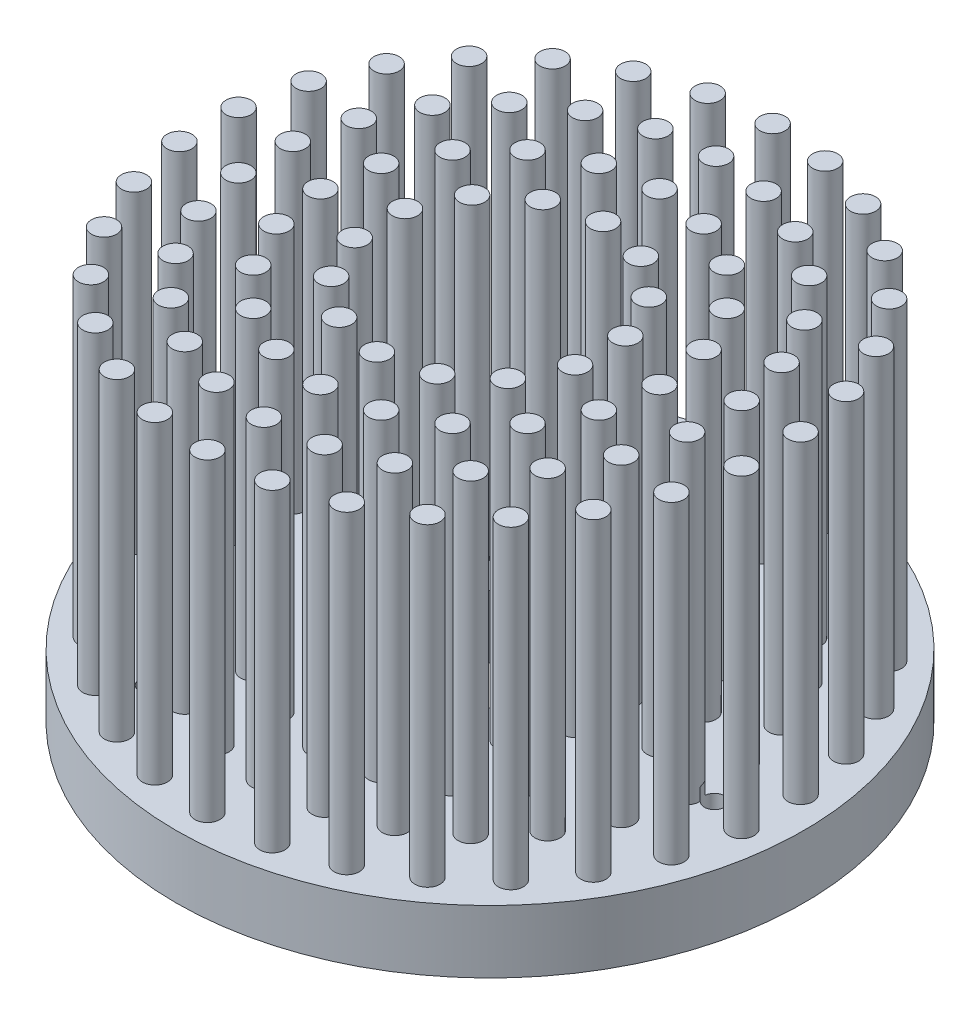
ISO-10303-21;
HEADER;
FILE_DESCRIPTION(('STEP AP214'),'2;1');
FILE_NAME('part.step','',(''),(''),'','','');
FILE_SCHEMA(('AUTOMOTIVE_DESIGN { 1 0 10303 214 1 1 1 1 }'));
ENDSEC;
DATA;
#1=APPLICATION_CONTEXT('core data for automotive mechanical design processes');
#2=APPLICATION_PROTOCOL_DEFINITION('international standard','automotive_design',2000,#1);
#3=PRODUCT_CONTEXT('',#1,'mechanical');
#4=PRODUCT('Part','Part','',(#3));
#5=PRODUCT_RELATED_PRODUCT_CATEGORY('part','',(#4));
#6=PRODUCT_DEFINITION_FORMATION('','',#4);
#7=PRODUCT_DEFINITION_CONTEXT('part definition',#1,'design');
#8=PRODUCT_DEFINITION('design','',#6,#7);
#9=PRODUCT_DEFINITION_SHAPE('','',#8);
#10=(LENGTH_UNIT() NAMED_UNIT(*) SI_UNIT(.MILLI.,.METRE.));
#11=(NAMED_UNIT(*) PLANE_ANGLE_UNIT() SI_UNIT($,.RADIAN.));
#12=(NAMED_UNIT(*) SI_UNIT($,.STERADIAN.) SOLID_ANGLE_UNIT());
#13=UNCERTAINTY_MEASURE_WITH_UNIT(LENGTH_MEASURE(1.E-05),#10,'distance_accuracy_value','');
#14=(GEOMETRIC_REPRESENTATION_CONTEXT(3) GLOBAL_UNCERTAINTY_ASSIGNED_CONTEXT((#13)) GLOBAL_UNIT_ASSIGNED_CONTEXT((#10,
#11,#12)) REPRESENTATION_CONTEXT('',''));
#15=CARTESIAN_POINT('',(0.,0.,0.));
#16=DIRECTION('',(0.,0.,1.));
#17=DIRECTION('',(1.,0.,0.));
#18=AXIS2_PLACEMENT_3D('',#15,#16,#17);
#19=CARTESIAN_POINT('',(0.,3.,0.));
#20=DIRECTION('',(0.,-1.,0.));
#21=DIRECTION('',(0.,0.,-1.));
#22=AXIS2_PLACEMENT_3D('',#19,#20,#21);
#23=CYLINDRICAL_SURFACE('',#22,25.);
#24=CARTESIAN_POINT('',(0.,0.,0.));
#25=DIRECTION('',(0.,1.,0.));
#26=DIRECTION('',(0.,0.,1.));
#27=AXIS2_PLACEMENT_3D('',#24,#25,#26);
#28=CIRCLE('',#27,25.);
#29=CARTESIAN_POINT('',(0.,0.,25.));
#30=VERTEX_POINT('',#29);
#31=EDGE_CURVE('E644',#30,#30,#28,.T.);
#32=ORIENTED_EDGE('',*,*,#31,.T.);
#33=EDGE_LOOP('',(#32));
#34=FACE_BOUND('',#33,.T.);
#35=CARTESIAN_POINT('',(0.,5.,0.));
#36=DIRECTION('',(0.,1.,0.));
#37=DIRECTION('',(0.,0.,1.));
#38=AXIS2_PLACEMENT_3D('',#35,#36,#37);
#39=CIRCLE('',#38,25.);
#40=CARTESIAN_POINT('',(0.,5.,25.));
#41=VERTEX_POINT('',#40);
#42=EDGE_CURVE('E105',#41,#41,#39,.T.);
#43=ORIENTED_EDGE('',*,*,#42,.F.);
#44=EDGE_LOOP('',(#43));
#45=FACE_BOUND('',#44,.T.);
#46=ADVANCED_FACE('F36',(#34,#45),#23,.T.);
#47=CARTESIAN_POINT('',(0.,0.,0.));
#48=DIRECTION('',(0.,1.,0.));
#49=DIRECTION('',(0.,0.,1.));
#50=AXIS2_PLACEMENT_3D('',#47,#48,#49);
#51=PLANE('',#50);
#52=CARTESIAN_POINT('',(0.,0.,0.));
#53=DIRECTION('',(0.,-1.,0.));
#54=DIRECTION('',(0.,0.,-1.));
#55=AXIS2_PLACEMENT_3D('',#52,#53,#54);
#56=CIRCLE('',#55,5.75);
#57=CARTESIAN_POINT('',(0.,0.,-5.75));
#58=VERTEX_POINT('',#57);
#59=EDGE_CURVE('E2943',#58,#58,#56,.T.);
#60=ORIENTED_EDGE('',*,*,#59,.F.);
#61=EDGE_LOOP('',(#60));
#62=FACE_BOUND('',#61,.T.);
#63=CARTESIAN_POINT('',(-11.0772625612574,0.,16.0481853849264));
#64=DIRECTION('',(0.,-1.,0.));
#65=DIRECTION('',(0.,0.,-1.));
#66=AXIS2_PLACEMENT_3D('',#63,#64,#65);
#67=CIRCLE('',#66,0.799999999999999);
#68=CARTESIAN_POINT('',(-11.0772625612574,0.,15.2481853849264));
#69=VERTEX_POINT('',#68);
#70=EDGE_CURVE('E2947',#69,#69,#67,.T.);
#71=ORIENTED_EDGE('',*,*,#70,.F.);
#72=EDGE_LOOP('',(#71));
#73=FACE_BOUND('',#72,.T.);
#74=CARTESIAN_POINT('',(19.4367675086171,0.,1.56909808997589));
#75=DIRECTION('',(0.,-1.,0.));
#76=DIRECTION('',(0.,0.,-1.));
#77=AXIS2_PLACEMENT_3D('',#74,#75,#76);
#78=CIRCLE('',#77,0.799999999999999);
#79=CARTESIAN_POINT('',(19.4367675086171,0.,0.769098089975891));
#80=VERTEX_POINT('',#79);
#81=EDGE_CURVE('E85',#80,#80,#78,.T.);
#82=ORIENTED_EDGE('',*,*,#81,.F.);
#83=EDGE_LOOP('',(#82));
#84=FACE_BOUND('',#83,.T.);
#85=CARTESIAN_POINT('',(-8.35950494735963,0.,-17.6172834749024));
#86=DIRECTION('',(0.,-1.,0.));
#87=DIRECTION('',(0.,0.,-1.));
#88=AXIS2_PLACEMENT_3D('',#85,#86,#87);
#89=CIRCLE('',#88,0.799999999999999);
#90=CARTESIAN_POINT('',(-8.35950494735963,0.,-18.4172834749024));
#91=VERTEX_POINT('',#90);
#92=EDGE_CURVE('E92',#91,#91,#89,.T.);
#93=ORIENTED_EDGE('',*,*,#92,.F.);
#94=EDGE_LOOP('',(#93));
#95=FACE_BOUND('',#94,.T.);
#96=ORIENTED_EDGE('',*,*,#31,.F.);
#97=EDGE_LOOP('',(#96));
#98=FACE_BOUND('',#97,.T.);
#99=ADVANCED_FACE('F676',(#62,#73,#84,#95,#98),#51,.F.);
#100=CARTESIAN_POINT('',(0.,5.,0.));
#101=DIRECTION('',(0.,1.,0.));
#102=DIRECTION('',(0.,0.,1.));
#103=AXIS2_PLACEMENT_3D('',#100,#101,#102);
#104=PLANE('',#103);
#105=CARTESIAN_POINT('',(0.,5.,0.));
#106=DIRECTION('',(0.,1.,0.));
#107=DIRECTION('',(0.,0.,1.));
#108=AXIS2_PLACEMENT_3D('',#105,#106,#107);
#109=CIRCLE('',#108,5.75);
#110=CARTESIAN_POINT('',(0.,5.,5.75));
#111=VERTEX_POINT('',#110);
#112=EDGE_CURVE('E39',#111,#111,#109,.T.);
#113=ORIENTED_EDGE('',*,*,#112,.F.);
#114=EDGE_LOOP('',(#113));
#115=FACE_BOUND('',#114,.T.);
#116=CARTESIAN_POINT('',(-11.0772625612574,5.,16.0481853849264));
#117=DIRECTION('',(0.,1.,0.));
#118=DIRECTION('',(0.,0.,1.));
#119=AXIS2_PLACEMENT_3D('',#116,#117,#118);
#120=CIRCLE('',#119,0.799999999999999);
#121=CARTESIAN_POINT('',(-11.0772625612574,5.,16.8481853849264));
#122=VERTEX_POINT('',#121);
#123=EDGE_CURVE('E1217',#122,#122,#120,.T.);
#124=ORIENTED_EDGE('',*,*,#123,.F.);
#125=EDGE_LOOP('',(#124));
#126=FACE_BOUND('',#125,.T.);
#127=CARTESIAN_POINT('',(19.4367675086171,5.,1.56909808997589));
#128=DIRECTION('',(0.,1.,0.));
#129=DIRECTION('',(0.,0.,1.));
#130=AXIS2_PLACEMENT_3D('',#127,#128,#129);
#131=CIRCLE('',#130,0.799999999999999);
#132=CARTESIAN_POINT('',(18.8680399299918,5.,2.13172491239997));
#133=VERTEX_POINT('',#132);
#134=CARTESIAN_POINT('',(18.6377065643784,5.,1.53034751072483));
#135=VERTEX_POINT('',#134);
#136=EDGE_CURVE('E44',#133,#135,#131,.T.);
#137=ORIENTED_EDGE('',*,*,#136,.F.);
#138=CARTESIAN_POINT('',(17.868759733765,5.,2.16966024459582));
#139=DIRECTION('',(0.,1.,0.));
#140=DIRECTION('',(0.,0.,1.));
#141=AXIS2_PLACEMENT_3D('',#138,#139,#140);
#142=CIRCLE('',#141,1.);
#143=EDGE_CURVE('E91',#135,#133,#142,.T.);
#144=ORIENTED_EDGE('',*,*,#143,.F.);
#145=EDGE_LOOP('',(#137,#144));
#146=FACE_BOUND('',#145,.T.);
#147=CARTESIAN_POINT('',(-8.35950494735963,5.,-17.6172834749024));
#148=DIRECTION('',(0.,1.,0.));
#149=DIRECTION('',(0.,0.,1.));
#150=AXIS2_PLACEMENT_3D('',#147,#148,#149);
#151=CIRCLE('',#150,0.799999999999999);
#152=CARTESIAN_POINT('',(-8.03992161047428,5.,-16.8838896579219));
#153=VERTEX_POINT('',#152);
#154=CARTESIAN_POINT('',(-8.68389658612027,5.,-16.8860037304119));
#155=VERTEX_POINT('',#154);
#156=EDGE_CURVE('E647',#153,#155,#151,.T.);
#157=ORIENTED_EDGE('',*,*,#156,.F.);
#158=CARTESIAN_POINT('',(-8.3650170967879,5.,-15.9382084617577));
#159=DIRECTION('',(0.,1.,0.));
#160=DIRECTION('',(0.,0.,1.));
#161=AXIS2_PLACEMENT_3D('',#158,#159,#160);
#162=CIRCLE('',#161,1.);
#163=EDGE_CURVE('E329',#155,#153,#162,.T.);
#164=ORIENTED_EDGE('',*,*,#163,.F.);
#165=EDGE_LOOP('',(#157,#164));
#166=FACE_BOUND('',#165,.T.);
#167=CARTESIAN_POINT('',(0.,5.,-22.4999999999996));
#168=DIRECTION('',(0.,1.,0.));
#169=DIRECTION('',(0.,0.,1.));
#170=AXIS2_PLACEMENT_3D('',#167,#168,#169);
#171=CIRCLE('',#170,1.);
#172=CARTESIAN_POINT('',(0.,5.,-21.4999999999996));
#173=VERTEX_POINT('',#172);
#174=EDGE_CURVE('E371',#173,#173,#171,.T.);
#175=ORIENTED_EDGE('',*,*,#174,.F.);
#176=EDGE_LOOP('',(#175));
#177=FACE_BOUND('',#176,.T.);
#178=CARTESIAN_POINT('',(0.,5.,9.));
#179=DIRECTION('',(0.,1.,0.));
#180=DIRECTION('',(0.,0.,1.));
#181=AXIS2_PLACEMENT_3D('',#178,#179,#180);
#182=CIRCLE('',#181,1.);
#183=CARTESIAN_POINT('',(0.,5.,10.));
#184=VERTEX_POINT('',#183);
#185=EDGE_CURVE('E368',#184,#184,#182,.T.);
#186=ORIENTED_EDGE('',*,*,#185,.F.);
#187=EDGE_LOOP('',(#186));
#188=FACE_BOUND('',#187,.T.);
#189=CARTESIAN_POINT('',(1.88540101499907E-13,5.,18.));
#190=DIRECTION('',(0.,1.,0.));
#191=DIRECTION('',(0.,0.,1.));
#192=AXIS2_PLACEMENT_3D('',#189,#190,#191);
#193=CIRCLE('',#192,1.);
#194=CARTESIAN_POINT('',(1.88540101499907E-13,5.,19.));
#195=VERTEX_POINT('',#194);
#196=EDGE_CURVE('E362',#195,#195,#193,.T.);
#197=ORIENTED_EDGE('',*,*,#196,.F.);
#198=EDGE_LOOP('',(#197));
#199=FACE_BOUND('',#198,.T.);
#200=CARTESIAN_POINT('',(-8.36501709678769,5.,15.9382084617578));
#201=DIRECTION('',(0.,1.,0.));
#202=DIRECTION('',(0.,0.,1.));
#203=AXIS2_PLACEMENT_3D('',#200,#201,#202);
#204=CIRCLE('',#203,1.);
#205=CARTESIAN_POINT('',(-8.36501709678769,5.,16.9382084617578));
#206=VERTEX_POINT('',#205);
#207=EDGE_CURVE('E356',#206,#206,#204,.T.);
#208=ORIENTED_EDGE('',*,*,#207,.F.);
#209=EDGE_LOOP('',(#208));
#210=FACE_BOUND('',#209,.T.);
#211=CARTESIAN_POINT('',(-14.8137095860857,5.,10.2251654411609));
#212=DIRECTION('',(0.,1.,0.));
#213=DIRECTION('',(0.,0.,1.));
#214=AXIS2_PLACEMENT_3D('',#211,#212,#213);
#215=CIRCLE('',#214,0.999999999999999);
#216=CARTESIAN_POINT('',(-14.8137095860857,5.,11.2251654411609));
#217=VERTEX_POINT('',#216);
#218=EDGE_CURVE('E350',#217,#217,#215,.T.);
#219=ORIENTED_EDGE('',*,*,#218,.F.);
#220=EDGE_LOOP('',(#219));
#221=FACE_BOUND('',#220,.T.);
#222=CARTESIAN_POINT('',(-17.8687597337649,5.,2.16966024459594));
#223=DIRECTION('',(0.,1.,0.));
#224=DIRECTION('',(0.,0.,1.));
#225=AXIS2_PLACEMENT_3D('',#222,#223,#224);
#226=CIRCLE('',#225,1.);
#227=CARTESIAN_POINT('',(-17.8687597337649,5.,3.16966024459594));
#228=VERTEX_POINT('',#227);
#229=EDGE_CURVE('E344',#228,#228,#226,.T.);
#230=ORIENTED_EDGE('',*,*,#229,.F.);
#231=EDGE_LOOP('',(#230));
#232=FACE_BOUND('',#231,.T.);
#233=CARTESIAN_POINT('',(-16.8302923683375,5.,-6.38288796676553));
#234=DIRECTION('',(0.,1.,0.));
#235=DIRECTION('',(0.,0.,1.));
#236=AXIS2_PLACEMENT_3D('',#233,#234,#235);
#237=CIRCLE('',#236,1.);
#238=CARTESIAN_POINT('',(-16.8302923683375,5.,-5.38288796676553));
#239=VERTEX_POINT('',#238);
#240=EDGE_CURVE('E338',#239,#239,#237,.T.);
#241=ORIENTED_EDGE('',*,*,#240,.F.);
#242=EDGE_LOOP('',(#241));
#243=FACE_BOUND('',#242,.T.);
#244=CARTESIAN_POINT('',(-11.9362078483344,5.,-13.4731934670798));
#245=DIRECTION('',(0.,1.,0.));
#246=DIRECTION('',(0.,0.,1.));
#247=AXIS2_PLACEMENT_3D('',#244,#245,#246);
#248=CIRCLE('',#247,1.);
#249=CARTESIAN_POINT('',(-11.9362078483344,5.,-12.4731934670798));
#250=VERTEX_POINT('',#249);
#251=EDGE_CURVE('E332',#250,#250,#248,.T.);
#252=ORIENTED_EDGE('',*,*,#251,.F.);
#253=EDGE_LOOP('',(#252));
#254=FACE_BOUND('',#253,.T.);
#255=CARTESIAN_POINT('',(-4.30768195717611,5.,-17.4769527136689));
#256=DIRECTION('',(0.,1.,0.));
#257=DIRECTION('',(0.,0.,1.));
#258=AXIS2_PLACEMENT_3D('',#255,#256,#257);
#259=CIRCLE('',#258,1.);
#260=CARTESIAN_POINT('',(-4.30768195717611,5.,-16.4769527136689));
#261=VERTEX_POINT('',#260);
#262=EDGE_CURVE('E326',#261,#261,#259,.T.);
#263=ORIENTED_EDGE('',*,*,#262,.F.);
#264=EDGE_LOOP('',(#263));
#265=FACE_BOUND('',#264,.T.);
#266=CARTESIAN_POINT('',(4.30768195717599,5.,-17.4769527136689));
#267=DIRECTION('',(0.,1.,0.));
#268=DIRECTION('',(0.,0.,1.));
#269=AXIS2_PLACEMENT_3D('',#266,#267,#268);
#270=CIRCLE('',#269,1.);
#271=CARTESIAN_POINT('',(4.30768195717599,5.,-16.4769527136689));
#272=VERTEX_POINT('',#271);
#273=EDGE_CURVE('E320',#272,#272,#270,.T.);
#274=ORIENTED_EDGE('',*,*,#273,.F.);
#275=EDGE_LOOP('',(#274));
#276=FACE_BOUND('',#275,.T.);
#277=CARTESIAN_POINT('',(11.9362078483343,5.,-13.4731934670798));
#278=DIRECTION('',(0.,1.,0.));
#279=DIRECTION('',(0.,0.,1.));
#280=AXIS2_PLACEMENT_3D('',#277,#278,#279);
#281=CIRCLE('',#280,1.);
#282=CARTESIAN_POINT('',(11.9362078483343,5.,-12.4731934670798));
#283=VERTEX_POINT('',#282);
#284=EDGE_CURVE('E314',#283,#283,#281,.T.);
#285=ORIENTED_EDGE('',*,*,#284,.F.);
#286=EDGE_LOOP('',(#285));
#287=FACE_BOUND('',#286,.T.);
#288=CARTESIAN_POINT('',(16.8302923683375,5.,-6.38288796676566));
#289=DIRECTION('',(0.,1.,0.));
#290=DIRECTION('',(0.,0.,1.));
#291=AXIS2_PLACEMENT_3D('',#288,#289,#290);
#292=CIRCLE('',#291,1.);
#293=CARTESIAN_POINT('',(16.8302923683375,5.,-5.38288796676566));
#294=VERTEX_POINT('',#293);
#295=EDGE_CURVE('E308',#294,#294,#292,.T.);
#296=ORIENTED_EDGE('',*,*,#295,.F.);
#297=EDGE_LOOP('',(#296));
#298=FACE_BOUND('',#297,.T.);
#299=CARTESIAN_POINT('',(14.8137095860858,5.,10.2251654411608));
#300=DIRECTION('',(0.,1.,0.));
#301=DIRECTION('',(0.,0.,1.));
#302=AXIS2_PLACEMENT_3D('',#299,#300,#301);
#303=CIRCLE('',#302,1.);
#304=CARTESIAN_POINT('',(14.8137095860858,5.,11.2251654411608));
#305=VERTEX_POINT('',#304);
#306=EDGE_CURVE('E298',#305,#305,#303,.T.);
#307=ORIENTED_EDGE('',*,*,#306,.F.);
#308=EDGE_LOOP('',(#307));
#309=FACE_BOUND('',#308,.T.);
#310=CARTESIAN_POINT('',(8.3650170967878,5.,15.9382084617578));
#311=DIRECTION('',(0.,1.,0.));
#312=DIRECTION('',(0.,0.,1.));
#313=AXIS2_PLACEMENT_3D('',#310,#311,#312);
#314=CIRCLE('',#313,1.);
#315=CARTESIAN_POINT('',(8.3650170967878,5.,16.9382084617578));
#316=VERTEX_POINT('',#315);
#317=EDGE_CURVE('E292',#316,#316,#314,.T.);
#318=ORIENTED_EDGE('',*,*,#317,.F.);
#319=EDGE_LOOP('',(#318));
#320=FACE_BOUND('',#319,.T.);
#321=CARTESIAN_POINT('',(-4.17172942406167,5.,12.8392629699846));
#322=DIRECTION('',(0.,1.,0.));
#323=DIRECTION('',(0.,0.,1.));
#324=AXIS2_PLACEMENT_3D('',#321,#322,#323);
#325=CIRCLE('',#324,1.);
#326=CARTESIAN_POINT('',(-4.17172942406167,5.,13.8392629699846));
#327=VERTEX_POINT('',#326);
#328=EDGE_CURVE('E286',#327,#327,#325,.T.);
#329=ORIENTED_EDGE('',*,*,#328,.F.);
#330=EDGE_LOOP('',(#329));
#331=FACE_BOUND('',#330,.T.);
#332=CARTESIAN_POINT('',(-10.9217294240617,5.,7.93510090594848));
#333=DIRECTION('',(0.,1.,0.));
#334=DIRECTION('',(0.,0.,1.));
#335=AXIS2_PLACEMENT_3D('',#332,#333,#334);
#336=CIRCLE('',#335,1.);
#337=CARTESIAN_POINT('',(-10.9217294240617,5.,8.93510090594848));
#338=VERTEX_POINT('',#337);
#339=EDGE_CURVE('E280',#338,#338,#336,.T.);
#340=ORIENTED_EDGE('',*,*,#339,.F.);
#341=EDGE_LOOP('',(#340));
#342=FACE_BOUND('',#341,.T.);
#343=CARTESIAN_POINT('',(-13.5,5.,0.));
#344=DIRECTION('',(0.,1.,0.));
#345=DIRECTION('',(0.,0.,1.));
#346=AXIS2_PLACEMENT_3D('',#343,#344,#345);
#347=CIRCLE('',#346,1.);
#348=CARTESIAN_POINT('',(-13.5,5.,1.00000000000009));
#349=VERTEX_POINT('',#348);
#350=EDGE_CURVE('E274',#349,#349,#347,.T.);
#351=ORIENTED_EDGE('',*,*,#350,.F.);
#352=EDGE_LOOP('',(#351));
#353=FACE_BOUND('',#352,.T.);
#354=CARTESIAN_POINT('',(-10.9217294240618,5.,-7.93510090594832));
#355=DIRECTION('',(0.,1.,0.));
#356=DIRECTION('',(0.,0.,1.));
#357=AXIS2_PLACEMENT_3D('',#354,#355,#356);
#358=CIRCLE('',#357,0.999999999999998);
#359=CARTESIAN_POINT('',(-10.9217294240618,5.,-6.93510090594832));
#360=VERTEX_POINT('',#359);
#361=EDGE_CURVE('E268',#360,#360,#358,.T.);
#362=ORIENTED_EDGE('',*,*,#361,.F.);
#363=EDGE_LOOP('',(#362));
#364=FACE_BOUND('',#363,.T.);
#365=CARTESIAN_POINT('',(-4.17172942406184,5.,-12.8392629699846));
#366=DIRECTION('',(0.,1.,0.));
#367=DIRECTION('',(0.,0.,1.));
#368=AXIS2_PLACEMENT_3D('',#365,#366,#367);
#369=CIRCLE('',#368,1.);
#370=CARTESIAN_POINT('',(-4.17172942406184,5.,-11.8392629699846));
#371=VERTEX_POINT('',#370);
#372=EDGE_CURVE('E262',#371,#371,#369,.T.);
#373=ORIENTED_EDGE('',*,*,#372,.F.);
#374=EDGE_LOOP('',(#373));
#375=FACE_BOUND('',#374,.T.);
#376=CARTESIAN_POINT('',(4.17172942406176,5.,-12.8392629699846));
#377=DIRECTION('',(0.,1.,0.));
#378=DIRECTION('',(0.,0.,1.));
#379=AXIS2_PLACEMENT_3D('',#376,#377,#378);
#380=CIRCLE('',#379,1.);
#381=CARTESIAN_POINT('',(4.17172942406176,5.,-11.8392629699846));
#382=VERTEX_POINT('',#381);
#383=EDGE_CURVE('E256',#382,#382,#380,.T.);
#384=ORIENTED_EDGE('',*,*,#383,.F.);
#385=EDGE_LOOP('',(#384));
#386=FACE_BOUND('',#385,.T.);
#387=CARTESIAN_POINT('',(10.9217294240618,5.,-7.9351009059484));
#388=DIRECTION('',(0.,1.,0.));
#389=DIRECTION('',(0.,0.,1.));
#390=AXIS2_PLACEMENT_3D('',#387,#388,#389);
#391=CIRCLE('',#390,0.999999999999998);
#392=CARTESIAN_POINT('',(10.9217294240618,5.,-6.9351009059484));
#393=VERTEX_POINT('',#392);
#394=EDGE_CURVE('E250',#393,#393,#391,.T.);
#395=ORIENTED_EDGE('',*,*,#394,.F.);
#396=EDGE_LOOP('',(#395));
#397=FACE_BOUND('',#396,.T.);
#398=CARTESIAN_POINT('',(13.5,5.,0.));
#399=DIRECTION('',(0.,1.,0.));
#400=DIRECTION('',(0.,0.,1.));
#401=AXIS2_PLACEMENT_3D('',#398,#399,#400);
#402=CIRCLE('',#401,1.);
#403=CARTESIAN_POINT('',(13.5,5.,1.));
#404=VERTEX_POINT('',#403);
#405=EDGE_CURVE('E244',#404,#404,#402,.T.);
#406=ORIENTED_EDGE('',*,*,#405,.F.);
#407=EDGE_LOOP('',(#406));
#408=FACE_BOUND('',#407,.T.);
#409=CARTESIAN_POINT('',(10.9217294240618,5.,7.93510090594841));
#410=DIRECTION('',(0.,1.,0.));
#411=DIRECTION('',(0.,0.,1.));
#412=AXIS2_PLACEMENT_3D('',#409,#410,#411);
#413=CIRCLE('',#412,1.);
#414=CARTESIAN_POINT('',(10.9217294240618,5.,8.93510090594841));
#415=VERTEX_POINT('',#414);
#416=EDGE_CURVE('E238',#415,#415,#413,.T.);
#417=ORIENTED_EDGE('',*,*,#416,.F.);
#418=EDGE_LOOP('',(#417));
#419=FACE_BOUND('',#418,.T.);
#420=CARTESIAN_POINT('',(4.17172942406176,5.,12.8392629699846));
#421=DIRECTION('',(0.,1.,0.));
#422=DIRECTION('',(0.,0.,1.));
#423=AXIS2_PLACEMENT_3D('',#420,#421,#422);
#424=CIRCLE('',#423,1.);
#425=CARTESIAN_POINT('',(4.17172942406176,5.,13.8392629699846));
#426=VERTEX_POINT('',#425);
#427=EDGE_CURVE('E232',#426,#426,#424,.T.);
#428=ORIENTED_EDGE('',*,*,#427,.F.);
#429=EDGE_LOOP('',(#428));
#430=FACE_BOUND('',#429,.T.);
#431=CARTESIAN_POINT('',(-7.03648334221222,5.,5.61140821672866));
#432=DIRECTION('',(0.,1.,0.));
#433=DIRECTION('',(0.,0.,1.));
#434=AXIS2_PLACEMENT_3D('',#431,#432,#433);
#435=CIRCLE('',#434,1.);
#436=CARTESIAN_POINT('',(-7.03648334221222,5.,6.61140821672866));
#437=VERTEX_POINT('',#436);
#438=EDGE_CURVE('E226',#437,#437,#435,.T.);
#439=ORIENTED_EDGE('',*,*,#438,.F.);
#440=EDGE_LOOP('',(#439));
#441=FACE_BOUND('',#440,.T.);
#442=CARTESIAN_POINT('',(-8.77435120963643,5.,-2.00268840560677));
#443=DIRECTION('',(0.,1.,0.));
#444=DIRECTION('',(0.,0.,1.));
#445=AXIS2_PLACEMENT_3D('',#442,#443,#444);
#446=CIRCLE('',#445,1.);
#447=CARTESIAN_POINT('',(-8.77435120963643,5.,-1.00268840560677));
#448=VERTEX_POINT('',#447);
#449=EDGE_CURVE('E220',#448,#448,#446,.T.);
#450=ORIENTED_EDGE('',*,*,#449,.F.);
#451=EDGE_LOOP('',(#450));
#452=FACE_BOUND('',#451,.T.);
#453=CARTESIAN_POINT('',(-3.90495365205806,5.,-8.10871981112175));
#454=DIRECTION('',(0.,1.,0.));
#455=DIRECTION('',(0.,0.,1.));
#456=AXIS2_PLACEMENT_3D('',#453,#454,#455);
#457=CIRCLE('',#456,1.);
#458=CARTESIAN_POINT('',(-3.90495365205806,5.,-7.10871981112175));
#459=VERTEX_POINT('',#458);
#460=EDGE_CURVE('E214',#459,#459,#457,.T.);
#461=ORIENTED_EDGE('',*,*,#460,.F.);
#462=EDGE_LOOP('',(#461));
#463=FACE_BOUND('',#462,.T.);
#464=CARTESIAN_POINT('',(3.904953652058,5.,-8.10871981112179));
#465=DIRECTION('',(0.,1.,0.));
#466=DIRECTION('',(0.,0.,1.));
#467=AXIS2_PLACEMENT_3D('',#464,#465,#466);
#468=CIRCLE('',#467,1.);
#469=CARTESIAN_POINT('',(3.904953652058,5.,-7.10871981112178));
#470=VERTEX_POINT('',#469);
#471=EDGE_CURVE('E208',#470,#470,#468,.T.);
#472=ORIENTED_EDGE('',*,*,#471,.F.);
#473=EDGE_LOOP('',(#472));
#474=FACE_BOUND('',#473,.T.);
#475=CARTESIAN_POINT('',(8.77435120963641,5.,-2.00268840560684));
#476=DIRECTION('',(0.,1.,0.));
#477=DIRECTION('',(0.,0.,1.));
#478=AXIS2_PLACEMENT_3D('',#475,#476,#477);
#479=CIRCLE('',#478,1.);
#480=CARTESIAN_POINT('',(8.77435120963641,5.,-1.00268840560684));
#481=VERTEX_POINT('',#480);
#482=EDGE_CURVE('E202',#481,#481,#479,.T.);
#483=ORIENTED_EDGE('',*,*,#482,.F.);
#484=EDGE_LOOP('',(#483));
#485=FACE_BOUND('',#484,.T.);
#486=CARTESIAN_POINT('',(7.03648334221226,5.,5.61140821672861));
#487=DIRECTION('',(0.,1.,0.));
#488=DIRECTION('',(0.,0.,1.));
#489=AXIS2_PLACEMENT_3D('',#486,#487,#488);
#490=CIRCLE('',#489,1.);
#491=CARTESIAN_POINT('',(7.03648334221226,5.,6.61140821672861));
#492=VERTEX_POINT('',#491);
#493=EDGE_CURVE('E196',#492,#492,#490,.T.);
#494=ORIENTED_EDGE('',*,*,#493,.F.);
#495=EDGE_LOOP('',(#494));
#496=FACE_BOUND('',#495,.T.);
#497=CARTESIAN_POINT('',(4.67801304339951,5.,-22.0083210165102));
#498=DIRECTION('',(0.,1.,0.));
#499=DIRECTION('',(0.,0.,1.));
#500=AXIS2_PLACEMENT_3D('',#497,#498,#499);
#501=CIRCLE('',#500,1.);
#502=CARTESIAN_POINT('',(4.67801304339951,5.,-21.0083210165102));
#503=VERTEX_POINT('',#502);
#504=EDGE_CURVE('E190',#503,#503,#501,.T.);
#505=ORIENTED_EDGE('',*,*,#504,.F.);
#506=EDGE_LOOP('',(#505));
#507=FACE_BOUND('',#506,.T.);
#508=CARTESIAN_POINT('',(13.2251681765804,5.,-18.202882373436));
#509=DIRECTION('',(0.,1.,0.));
#510=DIRECTION('',(0.,0.,1.));
#511=AXIS2_PLACEMENT_3D('',#508,#509,#510);
#512=CIRCLE('',#511,0.999999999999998);
#513=CARTESIAN_POINT('',(13.2251681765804,5.,-17.202882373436));
#514=VERTEX_POINT('',#513);
#515=EDGE_CURVE('E184',#514,#514,#512,.T.);
#516=ORIENTED_EDGE('',*,*,#515,.F.);
#517=EDGE_LOOP('',(#516));
#518=FACE_BOUND('',#517,.T.);
#519=CARTESIAN_POINT('',(19.4855715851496,5.,-11.2499999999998));
#520=DIRECTION('',(0.,1.,0.));
#521=DIRECTION('',(0.,0.,1.));
#522=AXIS2_PLACEMENT_3D('',#519,#520,#521);
#523=CIRCLE('',#522,0.999999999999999);
#524=CARTESIAN_POINT('',(19.4855715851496,5.,-10.2499999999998));
#525=VERTEX_POINT('',#524);
#526=EDGE_CURVE('E178',#525,#525,#523,.T.);
#527=ORIENTED_EDGE('',*,*,#526,.F.);
#528=EDGE_LOOP('',(#527));
#529=FACE_BOUND('',#528,.T.);
#530=CARTESIAN_POINT('',(22.3767426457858,5.,-2.3518904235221));
#531=DIRECTION('',(0.,1.,0.));
#532=DIRECTION('',(0.,0.,1.));
#533=AXIS2_PLACEMENT_3D('',#530,#531,#532);
#534=CIRCLE('',#533,1.);
#535=CARTESIAN_POINT('',(22.3767426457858,5.,-1.3518904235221));
#536=VERTEX_POINT('',#535);
#537=EDGE_CURVE('E172',#536,#536,#534,.T.);
#538=ORIENTED_EDGE('',*,*,#537,.F.);
#539=EDGE_LOOP('',(#538));
#540=FACE_BOUND('',#539,.T.);
#541=CARTESIAN_POINT('',(21.3987716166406,5.,6.95288237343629));
#542=DIRECTION('',(0.,1.,0.));
#543=DIRECTION('',(0.,0.,1.));
#544=AXIS2_PLACEMENT_3D('',#541,#542,#543);
#545=CIRCLE('',#544,1.);
#546=CARTESIAN_POINT('',(21.3987716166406,5.,7.95288237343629));
#547=VERTEX_POINT('',#546);
#548=EDGE_CURVE('E166',#547,#547,#545,.T.);
#549=ORIENTED_EDGE('',*,*,#548,.F.);
#550=EDGE_LOOP('',(#549));
#551=FACE_BOUND('',#550,.T.);
#552=CARTESIAN_POINT('',(16.720758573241,5.,15.0554386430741));
#553=DIRECTION('',(0.,1.,0.));
#554=DIRECTION('',(0.,0.,1.));
#555=AXIS2_PLACEMENT_3D('',#552,#553,#554);
#556=CIRCLE('',#555,1.);
#557=CARTESIAN_POINT('',(16.720758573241,5.,16.0554386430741));
#558=VERTEX_POINT('',#557);
#559=EDGE_CURVE('E160',#558,#558,#556,.T.);
#560=ORIENTED_EDGE('',*,*,#559,.F.);
#561=EDGE_LOOP('',(#560));
#562=FACE_BOUND('',#561,.T.);
#563=CARTESIAN_POINT('',(9.15157446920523,5.,20.5547727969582));
#564=DIRECTION('',(0.,1.,0.));
#565=DIRECTION('',(0.,0.,1.));
#566=AXIS2_PLACEMENT_3D('',#563,#564,#565);
#567=CIRCLE('',#566,1.);
#568=CARTESIAN_POINT('',(9.15157446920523,5.,21.5547727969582));
#569=VERTEX_POINT('',#568);
#570=EDGE_CURVE('E154',#569,#569,#567,.T.);
#571=ORIENTED_EDGE('',*,*,#570,.F.);
#572=EDGE_LOOP('',(#571));
#573=FACE_BOUND('',#572,.T.);
#574=CARTESIAN_POINT('',(-1.5711675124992E-13,5.,22.4999999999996));
#575=DIRECTION('',(0.,1.,0.));
#576=DIRECTION('',(0.,0.,1.));
#577=AXIS2_PLACEMENT_3D('',#574,#575,#576);
#578=CIRCLE('',#577,1.);
#579=CARTESIAN_POINT('',(-1.5711675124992E-13,5.,23.4999999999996));
#580=VERTEX_POINT('',#579);
#581=EDGE_CURVE('E148',#580,#580,#578,.T.);
#582=ORIENTED_EDGE('',*,*,#581,.F.);
#583=EDGE_LOOP('',(#582));
#584=FACE_BOUND('',#583,.T.);
#585=CARTESIAN_POINT('',(-9.1515744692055,5.,20.5547727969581));
#586=DIRECTION('',(0.,1.,0.));
#587=DIRECTION('',(0.,0.,1.));
#588=AXIS2_PLACEMENT_3D('',#585,#586,#587);
#589=CIRCLE('',#588,1.);
#590=CARTESIAN_POINT('',(-9.1515744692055,5.,21.5547727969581));
#591=VERTEX_POINT('',#590);
#592=EDGE_CURVE('E142',#591,#591,#589,.T.);
#593=ORIENTED_EDGE('',*,*,#592,.F.);
#594=EDGE_LOOP('',(#593));
#595=FACE_BOUND('',#594,.T.);
#596=CARTESIAN_POINT('',(-16.7207585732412,5.,15.0554386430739));
#597=DIRECTION('',(0.,1.,0.));
#598=DIRECTION('',(0.,0.,1.));
#599=AXIS2_PLACEMENT_3D('',#596,#597,#598);
#600=CIRCLE('',#599,1.);
#601=CARTESIAN_POINT('',(-16.7207585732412,5.,16.0554386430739));
#602=VERTEX_POINT('',#601);
#603=EDGE_CURVE('E136',#602,#602,#600,.T.);
#604=ORIENTED_EDGE('',*,*,#603,.F.);
#605=EDGE_LOOP('',(#604));
#606=FACE_BOUND('',#605,.T.);
#607=CARTESIAN_POINT('',(-21.3987716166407,5.,6.95288237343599));
#608=DIRECTION('',(0.,1.,0.));
#609=DIRECTION('',(0.,0.,1.));
#610=AXIS2_PLACEMENT_3D('',#607,#608,#609);
#611=CIRCLE('',#610,1.);
#612=CARTESIAN_POINT('',(-21.3987716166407,5.,7.95288237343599));
#613=VERTEX_POINT('',#612);
#614=EDGE_CURVE('E130',#613,#613,#611,.T.);
#615=ORIENTED_EDGE('',*,*,#614,.F.);
#616=EDGE_LOOP('',(#615));
#617=FACE_BOUND('',#616,.T.);
#618=CARTESIAN_POINT('',(-22.3767426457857,5.,-2.35189042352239));
#619=DIRECTION('',(0.,1.,0.));
#620=DIRECTION('',(0.,0.,1.));
#621=AXIS2_PLACEMENT_3D('',#618,#619,#620);
#622=CIRCLE('',#621,1.);
#623=CARTESIAN_POINT('',(-22.3767426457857,5.,-1.35189042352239));
#624=VERTEX_POINT('',#623);
#625=EDGE_CURVE('E124',#624,#624,#622,.T.);
#626=ORIENTED_EDGE('',*,*,#625,.F.);
#627=EDGE_LOOP('',(#626));
#628=FACE_BOUND('',#627,.T.);
#629=CARTESIAN_POINT('',(-19.4855715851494,5.,-11.25));
#630=DIRECTION('',(0.,1.,0.));
#631=DIRECTION('',(0.,0.,1.));
#632=AXIS2_PLACEMENT_3D('',#629,#630,#631);
#633=CIRCLE('',#632,1.);
#634=CARTESIAN_POINT('',(-19.4855715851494,5.,-10.25));
#635=VERTEX_POINT('',#634);
#636=EDGE_CURVE('E118',#635,#635,#633,.T.);
#637=ORIENTED_EDGE('',*,*,#636,.F.);
#638=EDGE_LOOP('',(#637));
#639=FACE_BOUND('',#638,.T.);
#640=CARTESIAN_POINT('',(-13.2251681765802,5.,-18.2028823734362));
#641=DIRECTION('',(0.,1.,0.));
#642=DIRECTION('',(0.,0.,1.));
#643=AXIS2_PLACEMENT_3D('',#640,#641,#642);
#644=CIRCLE('',#643,1.);
#645=CARTESIAN_POINT('',(-13.2251681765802,5.,-17.2028823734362));
#646=VERTEX_POINT('',#645);
#647=EDGE_CURVE('E112',#646,#646,#644,.T.);
#648=ORIENTED_EDGE('',*,*,#647,.F.);
#649=EDGE_LOOP('',(#648));
#650=FACE_BOUND('',#649,.T.);
#651=CARTESIAN_POINT('',(-4.67801304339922,5.,-22.0083210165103));
#652=DIRECTION('',(0.,1.,0.));
#653=DIRECTION('',(0.,0.,1.));
#654=AXIS2_PLACEMENT_3D('',#651,#652,#653);
#655=CIRCLE('',#654,1.);
#656=CARTESIAN_POINT('',(-4.67801304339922,5.,-21.0083210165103));
#657=VERTEX_POINT('',#656);
#658=EDGE_CURVE('E108',#657,#657,#655,.T.);
#659=ORIENTED_EDGE('',*,*,#658,.F.);
#660=EDGE_LOOP('',(#659));
#661=FACE_BOUND('',#660,.T.);
#662=ORIENTED_EDGE('',*,*,#42,.T.);
#663=EDGE_LOOP('',(#662));
#664=FACE_BOUND('',#663,.T.);
#665=CARTESIAN_POINT('',(-9.15157446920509,5.,-20.5547727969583));
#666=DIRECTION('',(0.,1.,0.));
#667=DIRECTION('',(0.,0.,1.));
#668=AXIS2_PLACEMENT_3D('',#665,#666,#667);
#669=CIRCLE('',#668,0.999999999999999);
#670=CARTESIAN_POINT('',(-9.15157446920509,5.,-19.5547727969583));
#671=VERTEX_POINT('',#670);
#672=EDGE_CURVE('E109',#671,#671,#669,.T.);
#673=ORIENTED_EDGE('',*,*,#672,.F.);
#674=EDGE_LOOP('',(#673));
#675=FACE_BOUND('',#674,.T.);
#676=CARTESIAN_POINT('',(-16.7207585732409,5.,-15.0554386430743));
#677=DIRECTION('',(0.,1.,0.));
#678=DIRECTION('',(0.,0.,1.));
#679=AXIS2_PLACEMENT_3D('',#676,#677,#678);
#680=CIRCLE('',#679,0.999999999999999);
#681=CARTESIAN_POINT('',(-16.7207585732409,5.,-14.0554386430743));
#682=VERTEX_POINT('',#681);
#683=EDGE_CURVE('E115',#682,#682,#680,.T.);
#684=ORIENTED_EDGE('',*,*,#683,.F.);
#685=EDGE_LOOP('',(#684));
#686=FACE_BOUND('',#685,.T.);
#687=CARTESIAN_POINT('',(-21.3987716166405,5.,-6.95288237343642));
#688=DIRECTION('',(0.,1.,0.));
#689=DIRECTION('',(0.,0.,1.));
#690=AXIS2_PLACEMENT_3D('',#687,#688,#689);
#691=CIRCLE('',#690,1.);
#692=CARTESIAN_POINT('',(-21.3987716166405,5.,-5.95288237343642));
#693=VERTEX_POINT('',#692);
#694=EDGE_CURVE('E121',#693,#693,#691,.T.);
#695=ORIENTED_EDGE('',*,*,#694,.F.);
#696=EDGE_LOOP('',(#695));
#697=FACE_BOUND('',#696,.T.);
#698=CARTESIAN_POINT('',(-22.3767426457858,5.,2.35189042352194));
#699=DIRECTION('',(0.,1.,0.));
#700=DIRECTION('',(0.,0.,1.));
#701=AXIS2_PLACEMENT_3D('',#698,#699,#700);
#702=CIRCLE('',#701,1.);
#703=CARTESIAN_POINT('',(-22.3767426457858,5.,3.35189042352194));
#704=VERTEX_POINT('',#703);
#705=EDGE_CURVE('E127',#704,#704,#702,.T.);
#706=ORIENTED_EDGE('',*,*,#705,.F.);
#707=EDGE_LOOP('',(#706));
#708=FACE_BOUND('',#707,.T.);
#709=CARTESIAN_POINT('',(-19.4855715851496,5.,11.2499999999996));
#710=DIRECTION('',(0.,1.,0.));
#711=DIRECTION('',(0.,0.,1.));
#712=AXIS2_PLACEMENT_3D('',#709,#710,#711);
#713=CIRCLE('',#712,0.999999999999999);
#714=CARTESIAN_POINT('',(-19.4855715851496,5.,12.2499999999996));
#715=VERTEX_POINT('',#714);
#716=EDGE_CURVE('E133',#715,#715,#713,.T.);
#717=ORIENTED_EDGE('',*,*,#716,.F.);
#718=EDGE_LOOP('',(#717));
#719=FACE_BOUND('',#718,.T.);
#720=CARTESIAN_POINT('',(-13.2251681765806,5.,18.2028823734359));
#721=DIRECTION('',(0.,1.,0.));
#722=DIRECTION('',(0.,0.,1.));
#723=AXIS2_PLACEMENT_3D('',#720,#721,#722);
#724=CIRCLE('',#723,1.);
#725=CARTESIAN_POINT('',(-13.2251681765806,5.,19.2028823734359));
#726=VERTEX_POINT('',#725);
#727=EDGE_CURVE('E139',#726,#726,#724,.T.);
#728=ORIENTED_EDGE('',*,*,#727,.F.);
#729=EDGE_LOOP('',(#728));
#730=FACE_BOUND('',#729,.T.);
#731=CARTESIAN_POINT('',(-4.67801304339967,5.,22.0083210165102));
#732=DIRECTION('',(0.,1.,0.));
#733=DIRECTION('',(0.,0.,1.));
#734=AXIS2_PLACEMENT_3D('',#731,#732,#733);
#735=CIRCLE('',#734,1.);
#736=CARTESIAN_POINT('',(-4.67801304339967,5.,23.0083210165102));
#737=VERTEX_POINT('',#736);
#738=EDGE_CURVE('E145',#737,#737,#735,.T.);
#739=ORIENTED_EDGE('',*,*,#738,.F.);
#740=EDGE_LOOP('',(#739));
#741=FACE_BOUND('',#740,.T.);
#742=CARTESIAN_POINT('',(4.67801304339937,5.,22.0083210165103));
#743=DIRECTION('',(0.,1.,0.));
#744=DIRECTION('',(0.,0.,1.));
#745=AXIS2_PLACEMENT_3D('',#742,#743,#744);
#746=CIRCLE('',#745,1.);
#747=CARTESIAN_POINT('',(4.67801304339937,5.,23.0083210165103));
#748=VERTEX_POINT('',#747);
#749=EDGE_CURVE('E151',#748,#748,#746,.T.);
#750=ORIENTED_EDGE('',*,*,#749,.F.);
#751=EDGE_LOOP('',(#750));
#752=FACE_BOUND('',#751,.T.);
#753=CARTESIAN_POINT('',(13.2251681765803,5.,18.2028823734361));
#754=DIRECTION('',(0.,1.,0.));
#755=DIRECTION('',(0.,0.,1.));
#756=AXIS2_PLACEMENT_3D('',#753,#754,#755);
#757=CIRCLE('',#756,1.);
#758=CARTESIAN_POINT('',(13.2251681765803,5.,19.2028823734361));
#759=VERTEX_POINT('',#758);
#760=EDGE_CURVE('E157',#759,#759,#757,.T.);
#761=ORIENTED_EDGE('',*,*,#760,.F.);
#762=EDGE_LOOP('',(#761));
#763=FACE_BOUND('',#762,.T.);
#764=CARTESIAN_POINT('',(19.4855715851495,5.,11.2499999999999));
#765=DIRECTION('',(0.,1.,0.));
#766=DIRECTION('',(0.,0.,1.));
#767=AXIS2_PLACEMENT_3D('',#764,#765,#766);
#768=CIRCLE('',#767,1.);
#769=CARTESIAN_POINT('',(19.4855715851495,5.,12.2499999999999));
#770=VERTEX_POINT('',#769);
#771=EDGE_CURVE('E163',#770,#770,#768,.T.);
#772=ORIENTED_EDGE('',*,*,#771,.F.);
#773=EDGE_LOOP('',(#772));
#774=FACE_BOUND('',#773,.T.);
#775=CARTESIAN_POINT('',(22.3767426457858,5.,2.35189042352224));
#776=DIRECTION('',(0.,1.,0.));
#777=DIRECTION('',(0.,0.,1.));
#778=AXIS2_PLACEMENT_3D('',#775,#776,#777);
#779=CIRCLE('',#778,1.);
#780=CARTESIAN_POINT('',(22.3767426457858,5.,3.35189042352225));
#781=VERTEX_POINT('',#780);
#782=EDGE_CURVE('E169',#781,#781,#779,.T.);
#783=ORIENTED_EDGE('',*,*,#782,.F.);
#784=EDGE_LOOP('',(#783));
#785=FACE_BOUND('',#784,.T.);
#786=CARTESIAN_POINT('',(21.3987716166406,5.,-6.95288237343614));
#787=DIRECTION('',(0.,1.,0.));
#788=DIRECTION('',(0.,0.,1.));
#789=AXIS2_PLACEMENT_3D('',#786,#787,#788);
#790=CIRCLE('',#789,1.);
#791=CARTESIAN_POINT('',(21.3987716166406,5.,-5.95288237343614));
#792=VERTEX_POINT('',#791);
#793=EDGE_CURVE('E175',#792,#792,#790,.T.);
#794=ORIENTED_EDGE('',*,*,#793,.F.);
#795=EDGE_LOOP('',(#794));
#796=FACE_BOUND('',#795,.T.);
#797=CARTESIAN_POINT('',(16.7207585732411,5.,-15.055438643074));
#798=DIRECTION('',(0.,1.,0.));
#799=DIRECTION('',(0.,0.,1.));
#800=AXIS2_PLACEMENT_3D('',#797,#798,#799);
#801=CIRCLE('',#800,0.999999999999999);
#802=CARTESIAN_POINT('',(16.7207585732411,5.,-14.055438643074));
#803=VERTEX_POINT('',#802);
#804=EDGE_CURVE('E181',#803,#803,#801,.T.);
#805=ORIENTED_EDGE('',*,*,#804,.F.);
#806=EDGE_LOOP('',(#805));
#807=FACE_BOUND('',#806,.T.);
#808=CARTESIAN_POINT('',(9.15157446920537,5.,-20.5547727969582));
#809=DIRECTION('',(0.,1.,0.));
#810=DIRECTION('',(0.,0.,1.));
#811=AXIS2_PLACEMENT_3D('',#808,#809,#810);
#812=CIRCLE('',#811,1.);
#813=CARTESIAN_POINT('',(9.15157446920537,5.,-19.5547727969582));
#814=VERTEX_POINT('',#813);
#815=EDGE_CURVE('E187',#814,#814,#812,.T.);
#816=ORIENTED_EDGE('',*,*,#815,.F.);
#817=EDGE_LOOP('',(#816));
#818=FACE_BOUND('',#817,.T.);
#819=CARTESIAN_POINT('',(3.904953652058,5.,8.10871981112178));
#820=DIRECTION('',(0.,1.,0.));
#821=DIRECTION('',(0.,0.,1.));
#822=AXIS2_PLACEMENT_3D('',#819,#820,#821);
#823=CIRCLE('',#822,0.999999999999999);
#824=CARTESIAN_POINT('',(3.904953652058,5.,9.10871981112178));
#825=VERTEX_POINT('',#824);
#826=EDGE_CURVE('E193',#825,#825,#823,.T.);
#827=ORIENTED_EDGE('',*,*,#826,.F.);
#828=EDGE_LOOP('',(#827));
#829=FACE_BOUND('',#828,.T.);
#830=CARTESIAN_POINT('',(8.77435120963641,5.,2.00268840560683));
#831=DIRECTION('',(0.,1.,0.));
#832=DIRECTION('',(0.,0.,1.));
#833=AXIS2_PLACEMENT_3D('',#830,#831,#832);
#834=CIRCLE('',#833,1.);
#835=CARTESIAN_POINT('',(8.77435120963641,5.,3.00268840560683));
#836=VERTEX_POINT('',#835);
#837=EDGE_CURVE('E199',#836,#836,#834,.T.);
#838=ORIENTED_EDGE('',*,*,#837,.F.);
#839=EDGE_LOOP('',(#838));
#840=FACE_BOUND('',#839,.T.);
#841=CARTESIAN_POINT('',(7.03648334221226,5.,-5.61140821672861));
#842=DIRECTION('',(0.,1.,0.));
#843=DIRECTION('',(0.,0.,1.));
#844=AXIS2_PLACEMENT_3D('',#841,#842,#843);
#845=CIRCLE('',#844,1.);
#846=CARTESIAN_POINT('',(7.03648334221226,5.,-4.61140821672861));
#847=VERTEX_POINT('',#846);
#848=EDGE_CURVE('E205',#847,#847,#845,.T.);
#849=ORIENTED_EDGE('',*,*,#848,.F.);
#850=EDGE_LOOP('',(#849));
#851=FACE_BOUND('',#850,.T.);
#852=CARTESIAN_POINT('',(0.,5.,-9.));
#853=DIRECTION('',(0.,1.,0.));
#854=DIRECTION('',(0.,0.,1.));
#855=AXIS2_PLACEMENT_3D('',#852,#853,#854);
#856=CIRCLE('',#855,1.);
#857=CARTESIAN_POINT('',(0.,5.,-8.));
#858=VERTEX_POINT('',#857);
#859=EDGE_CURVE('E211',#858,#858,#856,.T.);
#860=ORIENTED_EDGE('',*,*,#859,.F.);
#861=EDGE_LOOP('',(#860));
#862=FACE_BOUND('',#861,.T.);
#863=CARTESIAN_POINT('',(-7.0364833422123,5.,-5.61140821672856));
#864=DIRECTION('',(0.,1.,0.));
#865=DIRECTION('',(0.,0.,1.));
#866=AXIS2_PLACEMENT_3D('',#863,#864,#865);
#867=CIRCLE('',#866,1.);
#868=CARTESIAN_POINT('',(-7.0364833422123,5.,-4.61140821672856));
#869=VERTEX_POINT('',#868);
#870=EDGE_CURVE('E217',#869,#869,#867,.T.);
#871=ORIENTED_EDGE('',*,*,#870,.F.);
#872=EDGE_LOOP('',(#871));
#873=FACE_BOUND('',#872,.T.);
#874=CARTESIAN_POINT('',(-8.7743512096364,5.,2.0026884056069));
#875=DIRECTION('',(0.,1.,0.));
#876=DIRECTION('',(0.,0.,1.));
#877=AXIS2_PLACEMENT_3D('',#874,#875,#876);
#878=CIRCLE('',#877,1.);
#879=CARTESIAN_POINT('',(-8.7743512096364,5.,3.0026884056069));
#880=VERTEX_POINT('',#879);
#881=EDGE_CURVE('E223',#880,#880,#878,.T.);
#882=ORIENTED_EDGE('',*,*,#881,.F.);
#883=EDGE_LOOP('',(#882));
#884=FACE_BOUND('',#883,.T.);
#885=CARTESIAN_POINT('',(-3.90495365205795,5.,8.10871981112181));
#886=DIRECTION('',(0.,1.,0.));
#887=DIRECTION('',(0.,0.,1.));
#888=AXIS2_PLACEMENT_3D('',#885,#886,#887);
#889=CIRCLE('',#888,1.);
#890=CARTESIAN_POINT('',(-3.90495365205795,5.,9.10871981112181));
#891=VERTEX_POINT('',#890);
#892=EDGE_CURVE('E229',#891,#891,#889,.T.);
#893=ORIENTED_EDGE('',*,*,#892,.F.);
#894=EDGE_LOOP('',(#893));
#895=FACE_BOUND('',#894,.T.);
#896=CARTESIAN_POINT('',(7.93510090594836,5.,10.9217294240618));
#897=DIRECTION('',(0.,1.,0.));
#898=DIRECTION('',(0.,0.,1.));
#899=AXIS2_PLACEMENT_3D('',#896,#897,#898);
#900=CIRCLE('',#899,0.999999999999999);
#901=CARTESIAN_POINT('',(7.93510090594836,5.,11.9217294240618));
#902=VERTEX_POINT('',#901);
#903=EDGE_CURVE('E235',#902,#902,#900,.T.);
#904=ORIENTED_EDGE('',*,*,#903,.F.);
#905=EDGE_LOOP('',(#904));
#906=FACE_BOUND('',#905,.T.);
#907=CARTESIAN_POINT('',(12.8392629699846,5.,4.1717294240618));
#908=DIRECTION('',(0.,1.,0.));
#909=DIRECTION('',(0.,0.,1.));
#910=AXIS2_PLACEMENT_3D('',#907,#908,#909);
#911=CIRCLE('',#910,1.);
#912=CARTESIAN_POINT('',(12.8392629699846,5.,5.1717294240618));
#913=VERTEX_POINT('',#912);
#914=EDGE_CURVE('E241',#913,#913,#911,.T.);
#915=ORIENTED_EDGE('',*,*,#914,.F.);
#916=EDGE_LOOP('',(#915));
#917=FACE_BOUND('',#916,.T.);
#918=CARTESIAN_POINT('',(12.8392629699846,5.,-4.1717294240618));
#919=DIRECTION('',(0.,1.,0.));
#920=DIRECTION('',(0.,0.,1.));
#921=AXIS2_PLACEMENT_3D('',#918,#919,#920);
#922=CIRCLE('',#921,0.999999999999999);
#923=CARTESIAN_POINT('',(12.8392629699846,5.,-3.1717294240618));
#924=VERTEX_POINT('',#923);
#925=EDGE_CURVE('E247',#924,#924,#922,.T.);
#926=ORIENTED_EDGE('',*,*,#925,.F.);
#927=EDGE_LOOP('',(#926));
#928=FACE_BOUND('',#927,.T.);
#929=CARTESIAN_POINT('',(7.93510090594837,5.,-10.9217294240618));
#930=DIRECTION('',(0.,1.,0.));
#931=DIRECTION('',(0.,0.,1.));
#932=AXIS2_PLACEMENT_3D('',#929,#930,#931);
#933=CIRCLE('',#932,1.);
#934=CARTESIAN_POINT('',(7.93510090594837,5.,-9.9217294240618));
#935=VERTEX_POINT('',#934);
#936=EDGE_CURVE('E253',#935,#935,#933,.T.);
#937=ORIENTED_EDGE('',*,*,#936,.F.);
#938=EDGE_LOOP('',(#937));
#939=FACE_BOUND('',#938,.T.);
#940=CARTESIAN_POINT('',(0.,5.,-13.5));
#941=DIRECTION('',(0.,1.,0.));
#942=DIRECTION('',(0.,0.,1.));
#943=AXIS2_PLACEMENT_3D('',#940,#941,#942);
#944=CIRCLE('',#943,1.);
#945=CARTESIAN_POINT('',(0.,5.,-12.5));
#946=VERTEX_POINT('',#945);
#947=EDGE_CURVE('E259',#946,#946,#944,.T.);
#948=ORIENTED_EDGE('',*,*,#947,.F.);
#949=EDGE_LOOP('',(#948));
#950=FACE_BOUND('',#949,.T.);
#951=CARTESIAN_POINT('',(-7.93510090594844,5.,-10.9217294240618));
#952=DIRECTION('',(0.,1.,0.));
#953=DIRECTION('',(0.,0.,1.));
#954=AXIS2_PLACEMENT_3D('',#951,#952,#953);
#955=CIRCLE('',#954,1.);
#956=CARTESIAN_POINT('',(-7.93510090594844,5.,-9.92172942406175));
#957=VERTEX_POINT('',#956);
#958=EDGE_CURVE('E265',#957,#957,#955,.T.);
#959=ORIENTED_EDGE('',*,*,#958,.F.);
#960=EDGE_LOOP('',(#959));
#961=FACE_BOUND('',#960,.T.);
#962=CARTESIAN_POINT('',(-12.8392629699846,5.,-4.17172942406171));
#963=DIRECTION('',(0.,1.,0.));
#964=DIRECTION('',(0.,0.,1.));
#965=AXIS2_PLACEMENT_3D('',#962,#963,#964);
#966=CIRCLE('',#965,1.);
#967=CARTESIAN_POINT('',(-12.8392629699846,5.,-3.17172942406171));
#968=VERTEX_POINT('',#967);
#969=EDGE_CURVE('E271',#968,#968,#966,.T.);
#970=ORIENTED_EDGE('',*,*,#969,.F.);
#971=EDGE_LOOP('',(#970));
#972=FACE_BOUND('',#971,.T.);
#973=CARTESIAN_POINT('',(-12.8392629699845,5.,4.17172942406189));
#974=DIRECTION('',(0.,1.,0.));
#975=DIRECTION('',(0.,0.,1.));
#976=AXIS2_PLACEMENT_3D('',#973,#974,#975);
#977=CIRCLE('',#976,1.);
#978=CARTESIAN_POINT('',(-12.8392629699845,5.,5.17172942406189));
#979=VERTEX_POINT('',#978);
#980=EDGE_CURVE('E277',#979,#979,#977,.T.);
#981=ORIENTED_EDGE('',*,*,#980,.F.);
#982=EDGE_LOOP('',(#981));
#983=FACE_BOUND('',#982,.T.);
#984=CARTESIAN_POINT('',(-7.93510090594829,5.,10.9217294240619));
#985=DIRECTION('',(0.,1.,0.));
#986=DIRECTION('',(0.,0.,1.));
#987=AXIS2_PLACEMENT_3D('',#984,#985,#986);
#988=CIRCLE('',#987,1.);
#989=CARTESIAN_POINT('',(-7.93510090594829,5.,11.9217294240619));
#990=VERTEX_POINT('',#989);
#991=EDGE_CURVE('E283',#990,#990,#988,.T.);
#992=ORIENTED_EDGE('',*,*,#991,.F.);
#993=EDGE_LOOP('',(#992));
#994=FACE_BOUND('',#993,.T.);
#995=CARTESIAN_POINT('',(4.30768195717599,5.,17.4769527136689));
#996=DIRECTION('',(0.,1.,0.));
#997=DIRECTION('',(0.,0.,1.));
#998=AXIS2_PLACEMENT_3D('',#995,#996,#997);
#999=CIRCLE('',#998,1.);
#1000=CARTESIAN_POINT('',(4.30768195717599,5.,18.4769527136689));
#1001=VERTEX_POINT('',#1000);
#1002=EDGE_CURVE('E289',#1001,#1001,#999,.T.);
#1003=ORIENTED_EDGE('',*,*,#1002,.F.);
#1004=EDGE_LOOP('',(#1003));
#1005=FACE_BOUND('',#1004,.T.);
#1006=CARTESIAN_POINT('',(11.9362078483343,5.,13.4731934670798));
#1007=DIRECTION('',(0.,1.,0.));
#1008=DIRECTION('',(0.,0.,1.));
#1009=AXIS2_PLACEMENT_3D('',#1006,#1007,#1008);
#1010=CIRCLE('',#1009,1.);
#1011=CARTESIAN_POINT('',(11.9362078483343,5.,14.4731934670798));
#1012=VERTEX_POINT('',#1011);
#1013=EDGE_CURVE('E295',#1012,#1012,#1010,.T.);
#1014=ORIENTED_EDGE('',*,*,#1013,.F.);
#1015=EDGE_LOOP('',(#1014));
#1016=FACE_BOUND('',#1015,.T.);
#1017=CARTESIAN_POINT('',(16.8302923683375,5.,6.38288796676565));
#1018=DIRECTION('',(0.,1.,0.));
#1019=DIRECTION('',(0.,0.,1.));
#1020=AXIS2_PLACEMENT_3D('',#1017,#1018,#1019);
#1021=CIRCLE('',#1020,1.);
#1022=CARTESIAN_POINT('',(16.8302923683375,5.,7.38288796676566));
#1023=VERTEX_POINT('',#1022);
#1024=EDGE_CURVE('E301',#1023,#1023,#1021,.T.);
#1025=ORIENTED_EDGE('',*,*,#1024,.F.);
#1026=EDGE_LOOP('',(#1025));
#1027=FACE_BOUND('',#1026,.T.);
#1028=CARTESIAN_POINT('',(17.868759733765,5.,-2.16966024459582));
#1029=DIRECTION('',(0.,1.,0.));
#1030=DIRECTION('',(0.,0.,1.));
#1031=AXIS2_PLACEMENT_3D('',#1028,#1029,#1030);
#1032=CIRCLE('',#1031,1.);
#1033=CARTESIAN_POINT('',(17.868759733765,5.,-1.16966024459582));
#1034=VERTEX_POINT('',#1033);
#1035=EDGE_CURVE('E305',#1034,#1034,#1032,.T.);
#1036=ORIENTED_EDGE('',*,*,#1035,.F.);
#1037=EDGE_LOOP('',(#1036));
#1038=FACE_BOUND('',#1037,.T.);
#1039=CARTESIAN_POINT('',(14.8137095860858,5.,-10.2251654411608));
#1040=DIRECTION('',(0.,1.,0.));
#1041=DIRECTION('',(0.,0.,1.));
#1042=AXIS2_PLACEMENT_3D('',#1039,#1040,#1041);
#1043=CIRCLE('',#1042,1.);
#1044=CARTESIAN_POINT('',(14.8137095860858,5.,-9.22516544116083));
#1045=VERTEX_POINT('',#1044);
#1046=EDGE_CURVE('E311',#1045,#1045,#1043,.T.);
#1047=ORIENTED_EDGE('',*,*,#1046,.F.);
#1048=EDGE_LOOP('',(#1047));
#1049=FACE_BOUND('',#1048,.T.);
#1050=CARTESIAN_POINT('',(8.3650170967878,5.,-15.9382084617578));
#1051=DIRECTION('',(0.,1.,0.));
#1052=DIRECTION('',(0.,0.,1.));
#1053=AXIS2_PLACEMENT_3D('',#1050,#1051,#1052);
#1054=CIRCLE('',#1053,1.);
#1055=CARTESIAN_POINT('',(8.3650170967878,5.,-14.9382084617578));
#1056=VERTEX_POINT('',#1055);
#1057=EDGE_CURVE('E317',#1056,#1056,#1054,.T.);
#1058=ORIENTED_EDGE('',*,*,#1057,.F.);
#1059=EDGE_LOOP('',(#1058));
#1060=FACE_BOUND('',#1059,.T.);
#1061=CARTESIAN_POINT('',(0.,5.,-18.));
#1062=DIRECTION('',(0.,1.,0.));
#1063=DIRECTION('',(0.,0.,1.));
#1064=AXIS2_PLACEMENT_3D('',#1061,#1062,#1063);
#1065=CIRCLE('',#1064,1.);
#1066=CARTESIAN_POINT('',(0.,5.,-17.));
#1067=VERTEX_POINT('',#1066);
#1068=EDGE_CURVE('E323',#1067,#1067,#1065,.T.);
#1069=ORIENTED_EDGE('',*,*,#1068,.F.);
#1070=EDGE_LOOP('',(#1069));
#1071=FACE_BOUND('',#1070,.T.);
#1072=CARTESIAN_POINT('',(-14.8137095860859,5.,-10.2251654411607));
#1073=DIRECTION('',(0.,1.,0.));
#1074=DIRECTION('',(0.,0.,1.));
#1075=AXIS2_PLACEMENT_3D('',#1072,#1073,#1074);
#1076=CIRCLE('',#1075,1.);
#1077=CARTESIAN_POINT('',(-14.8137095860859,5.,-9.22516544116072));
#1078=VERTEX_POINT('',#1077);
#1079=EDGE_CURVE('E335',#1078,#1078,#1076,.T.);
#1080=ORIENTED_EDGE('',*,*,#1079,.F.);
#1081=EDGE_LOOP('',(#1080));
#1082=FACE_BOUND('',#1081,.T.);
#1083=CARTESIAN_POINT('',(-17.868759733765,5.,-2.1696602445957));
#1084=DIRECTION('',(0.,1.,0.));
#1085=DIRECTION('',(0.,0.,1.));
#1086=AXIS2_PLACEMENT_3D('',#1083,#1084,#1085);
#1087=CIRCLE('',#1086,1.);
#1088=CARTESIAN_POINT('',(-17.868759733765,5.,-1.1696602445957));
#1089=VERTEX_POINT('',#1088);
#1090=EDGE_CURVE('E341',#1089,#1089,#1087,.T.);
#1091=ORIENTED_EDGE('',*,*,#1090,.F.);
#1092=EDGE_LOOP('',(#1091));
#1093=FACE_BOUND('',#1092,.T.);
#1094=CARTESIAN_POINT('',(-16.8302923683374,5.,6.38288796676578));
#1095=DIRECTION('',(0.,1.,0.));
#1096=DIRECTION('',(0.,0.,1.));
#1097=AXIS2_PLACEMENT_3D('',#1094,#1095,#1096);
#1098=CIRCLE('',#1097,0.999999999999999);
#1099=CARTESIAN_POINT('',(-16.8302923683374,5.,7.38288796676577));
#1100=VERTEX_POINT('',#1099);
#1101=EDGE_CURVE('E347',#1100,#1100,#1098,.T.);
#1102=ORIENTED_EDGE('',*,*,#1101,.F.);
#1103=EDGE_LOOP('',(#1102));
#1104=FACE_BOUND('',#1103,.T.);
#1105=CARTESIAN_POINT('',(-11.9362078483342,5.,13.4731934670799));
#1106=DIRECTION('',(0.,1.,0.));
#1107=DIRECTION('',(0.,0.,1.));
#1108=AXIS2_PLACEMENT_3D('',#1105,#1106,#1107);
#1109=CIRCLE('',#1108,1.);
#1110=CARTESIAN_POINT('',(-11.9362078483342,5.,14.4731934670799));
#1111=VERTEX_POINT('',#1110);
#1112=EDGE_CURVE('E353',#1111,#1111,#1109,.T.);
#1113=ORIENTED_EDGE('',*,*,#1112,.F.);
#1114=EDGE_LOOP('',(#1113));
#1115=FACE_BOUND('',#1114,.T.);
#1116=CARTESIAN_POINT('',(-4.30768195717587,5.,17.476952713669));
#1117=DIRECTION('',(0.,1.,0.));
#1118=DIRECTION('',(0.,0.,1.));
#1119=AXIS2_PLACEMENT_3D('',#1116,#1117,#1118);
#1120=CIRCLE('',#1119,1.);
#1121=CARTESIAN_POINT('',(-4.30768195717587,5.,18.476952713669));
#1122=VERTEX_POINT('',#1121);
#1123=EDGE_CURVE('E359',#1122,#1122,#1120,.T.);
#1124=ORIENTED_EDGE('',*,*,#1123,.F.);
#1125=EDGE_LOOP('',(#1124));
#1126=FACE_BOUND('',#1125,.T.);
#1127=CARTESIAN_POINT('',(1.4140507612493E-13,5.,13.5));
#1128=DIRECTION('',(0.,1.,0.));
#1129=DIRECTION('',(0.,0.,1.));
#1130=AXIS2_PLACEMENT_3D('',#1127,#1128,#1129);
#1131=CIRCLE('',#1130,1.);
#1132=CARTESIAN_POINT('',(1.4140507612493E-13,5.,14.5));
#1133=VERTEX_POINT('',#1132);
#1134=EDGE_CURVE('E365',#1133,#1133,#1131,.T.);
#1135=ORIENTED_EDGE('',*,*,#1134,.F.);
#1136=EDGE_LOOP('',(#1135));
#1137=FACE_BOUND('',#1136,.T.);
#1138=ADVANCED_FACE('F672',(#115,#126,#146,#166,#177,#188,#199,#210,#221,#232,#243,#254,#265,
#276,#287,#298,#309,#320,#331,#342,#353,#364,#375,#386,#397,#408,#419,#430,#441,#452,#463,#474,
#485,#496,#507,#518,#529,#540,#551,#562,#573,#584,#595,#606,#617,#628,#639,#650,#661,#664,#675,
#686,#697,#708,#719,#730,#741,#752,#763,#774,#785,#796,#807,#818,#829,#840,#851,#862,#873,#884,
#895,#906,#917,#928,#939,#950,#961,#972,#983,#994,#1005,#1016,#1027,#1038,#1049,#1060,#1071,
#1082,#1093,#1104,#1115,#1126,#1137),#104,.T.);
#1139=CARTESIAN_POINT('',(-9.15157446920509,30.,-20.5547727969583));
#1140=DIRECTION('',(0.,1.,0.));
#1141=DIRECTION('',(0.,0.,1.));
#1142=AXIS2_PLACEMENT_3D('',#1139,#1140,#1141);
#1143=PLANE('',#1142);
#1144=CARTESIAN_POINT('',(-9.15157446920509,30.,-20.5547727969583));
#1145=DIRECTION('',(0.,1.,0.));
#1146=DIRECTION('',(0.,0.,1.));
#1147=AXIS2_PLACEMENT_3D('',#1144,#1145,#1146);
#1148=CIRCLE('',#1147,0.999999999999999);
#1149=CARTESIAN_POINT('',(-9.15157446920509,30.,-19.5547727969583));
#1150=VERTEX_POINT('',#1149);
#1151=EDGE_CURVE('E377',#1150,#1150,#1148,.T.);
#1152=ORIENTED_EDGE('',*,*,#1151,.T.);
#1153=EDGE_LOOP('',(#1152));
#1154=FACE_BOUND('',#1153,.T.);
#1155=ADVANCED_FACE('F675',(#1154),#1143,.T.);
#1156=CARTESIAN_POINT('',(-9.15157446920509,30.,-20.5547727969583));
#1157=DIRECTION('',(0.,-1.,0.));
#1158=DIRECTION('',(0.,0.,-1.));
#1159=AXIS2_PLACEMENT_3D('',#1156,#1157,#1158);
#1160=CYLINDRICAL_SURFACE('',#1159,0.999999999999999);
#1161=ORIENTED_EDGE('',*,*,#672,.T.);
#1162=EDGE_LOOP('',(#1161));
#1163=FACE_BOUND('',#1162,.T.);
#1164=ORIENTED_EDGE('',*,*,#1151,.F.);
#1165=EDGE_LOOP('',(#1164));
#1166=FACE_BOUND('',#1165,.T.);
#1167=ADVANCED_FACE('F688',(#1163,#1166),#1160,.T.);
#1168=CARTESIAN_POINT('',(-13.2251681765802,30.,-18.2028823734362));
#1169=DIRECTION('',(0.,1.,0.));
#1170=DIRECTION('',(0.,0.,1.));
#1171=AXIS2_PLACEMENT_3D('',#1168,#1169,#1170);
#1172=PLANE('',#1171);
#1173=CARTESIAN_POINT('',(-13.2251681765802,30.,-18.2028823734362));
#1174=DIRECTION('',(0.,1.,0.));
#1175=DIRECTION('',(0.,0.,1.));
#1176=AXIS2_PLACEMENT_3D('',#1173,#1174,#1175);
#1177=CIRCLE('',#1176,1.);
#1178=CARTESIAN_POINT('',(-13.2251681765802,30.,-17.2028823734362));
#1179=VERTEX_POINT('',#1178);
#1180=EDGE_CURVE('E380',#1179,#1179,#1177,.T.);
#1181=ORIENTED_EDGE('',*,*,#1180,.T.);
#1182=EDGE_LOOP('',(#1181));
#1183=FACE_BOUND('',#1182,.T.);
#1184=ADVANCED_FACE('F692',(#1183),#1172,.T.);
#1185=CARTESIAN_POINT('',(-13.2251681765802,30.,-18.2028823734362));
#1186=DIRECTION('',(0.,-1.,0.));
#1187=DIRECTION('',(0.,0.,-1.));
#1188=AXIS2_PLACEMENT_3D('',#1185,#1186,#1187);
#1189=CYLINDRICAL_SURFACE('',#1188,1.);
#1190=ORIENTED_EDGE('',*,*,#647,.T.);
#1191=EDGE_LOOP('',(#1190));
#1192=FACE_BOUND('',#1191,.T.);
#1193=ORIENTED_EDGE('',*,*,#1180,.F.);
#1194=EDGE_LOOP('',(#1193));
#1195=FACE_BOUND('',#1194,.T.);
#1196=ADVANCED_FACE('F696',(#1192,#1195),#1189,.T.);
#1197=CARTESIAN_POINT('',(-16.7207585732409,30.,-15.0554386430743));
#1198=DIRECTION('',(0.,1.,0.));
#1199=DIRECTION('',(0.,0.,1.));
#1200=AXIS2_PLACEMENT_3D('',#1197,#1198,#1199);
#1201=PLANE('',#1200);
#1202=CARTESIAN_POINT('',(-16.7207585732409,30.,-15.0554386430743));
#1203=DIRECTION('',(0.,1.,0.));
#1204=DIRECTION('',(0.,0.,1.));
#1205=AXIS2_PLACEMENT_3D('',#1202,#1203,#1204);
#1206=CIRCLE('',#1205,0.999999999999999);
#1207=CARTESIAN_POINT('',(-16.7207585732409,30.,-14.0554386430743));
#1208=VERTEX_POINT('',#1207);
#1209=EDGE_CURVE('E383',#1208,#1208,#1206,.T.);
#1210=ORIENTED_EDGE('',*,*,#1209,.T.);
#1211=EDGE_LOOP('',(#1210));
#1212=FACE_BOUND('',#1211,.T.);
#1213=ADVANCED_FACE('F700',(#1212),#1201,.T.);
#1214=CARTESIAN_POINT('',(-16.7207585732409,30.,-15.0554386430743));
#1215=DIRECTION('',(0.,-1.,0.));
#1216=DIRECTION('',(0.,0.,-1.));
#1217=AXIS2_PLACEMENT_3D('',#1214,#1215,#1216);
#1218=CYLINDRICAL_SURFACE('',#1217,0.999999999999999);
#1219=ORIENTED_EDGE('',*,*,#683,.T.);
#1220=EDGE_LOOP('',(#1219));
#1221=FACE_BOUND('',#1220,.T.);
#1222=ORIENTED_EDGE('',*,*,#1209,.F.);
#1223=EDGE_LOOP('',(#1222));
#1224=FACE_BOUND('',#1223,.T.);
#1225=ADVANCED_FACE('F704',(#1221,#1224),#1218,.T.);
#1226=CARTESIAN_POINT('',(-19.4855715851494,30.,-11.25));
#1227=DIRECTION('',(0.,1.,0.));
#1228=DIRECTION('',(0.,0.,1.));
#1229=AXIS2_PLACEMENT_3D('',#1226,#1227,#1228);
#1230=PLANE('',#1229);
#1231=CARTESIAN_POINT('',(-19.4855715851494,30.,-11.25));
#1232=DIRECTION('',(0.,1.,0.));
#1233=DIRECTION('',(0.,0.,1.));
#1234=AXIS2_PLACEMENT_3D('',#1231,#1232,#1233);
#1235=CIRCLE('',#1234,1.);
#1236=CARTESIAN_POINT('',(-19.4855715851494,30.,-10.25));
#1237=VERTEX_POINT('',#1236);
#1238=EDGE_CURVE('E386',#1237,#1237,#1235,.T.);
#1239=ORIENTED_EDGE('',*,*,#1238,.T.);
#1240=EDGE_LOOP('',(#1239));
#1241=FACE_BOUND('',#1240,.T.);
#1242=ADVANCED_FACE('F708',(#1241),#1230,.T.);
#1243=CARTESIAN_POINT('',(-19.4855715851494,30.,-11.25));
#1244=DIRECTION('',(0.,-1.,0.));
#1245=DIRECTION('',(0.,0.,-1.));
#1246=AXIS2_PLACEMENT_3D('',#1243,#1244,#1245);
#1247=CYLINDRICAL_SURFACE('',#1246,1.);
#1248=ORIENTED_EDGE('',*,*,#636,.T.);
#1249=EDGE_LOOP('',(#1248));
#1250=FACE_BOUND('',#1249,.T.);
#1251=ORIENTED_EDGE('',*,*,#1238,.F.);
#1252=EDGE_LOOP('',(#1251));
#1253=FACE_BOUND('',#1252,.T.);
#1254=ADVANCED_FACE('F712',(#1250,#1253),#1247,.T.);
#1255=CARTESIAN_POINT('',(-21.3987716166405,30.,-6.95288237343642));
#1256=DIRECTION('',(0.,1.,0.));
#1257=DIRECTION('',(0.,0.,1.));
#1258=AXIS2_PLACEMENT_3D('',#1255,#1256,#1257);
#1259=PLANE('',#1258);
#1260=CARTESIAN_POINT('',(-21.3987716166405,30.,-6.95288237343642));
#1261=DIRECTION('',(0.,1.,0.));
#1262=DIRECTION('',(0.,0.,1.));
#1263=AXIS2_PLACEMENT_3D('',#1260,#1261,#1262);
#1264=CIRCLE('',#1263,1.);
#1265=CARTESIAN_POINT('',(-21.3987716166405,30.,-5.95288237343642));
#1266=VERTEX_POINT('',#1265);
#1267=EDGE_CURVE('E389',#1266,#1266,#1264,.T.);
#1268=ORIENTED_EDGE('',*,*,#1267,.T.);
#1269=EDGE_LOOP('',(#1268));
#1270=FACE_BOUND('',#1269,.T.);
#1271=ADVANCED_FACE('F716',(#1270),#1259,.T.);
#1272=CARTESIAN_POINT('',(-21.3987716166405,30.,-6.95288237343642));
#1273=DIRECTION('',(0.,-1.,0.));
#1274=DIRECTION('',(0.,0.,-1.));
#1275=AXIS2_PLACEMENT_3D('',#1272,#1273,#1274);
#1276=CYLINDRICAL_SURFACE('',#1275,1.);
#1277=ORIENTED_EDGE('',*,*,#694,.T.);
#1278=EDGE_LOOP('',(#1277));
#1279=FACE_BOUND('',#1278,.T.);
#1280=ORIENTED_EDGE('',*,*,#1267,.F.);
#1281=EDGE_LOOP('',(#1280));
#1282=FACE_BOUND('',#1281,.T.);
#1283=ADVANCED_FACE('F720',(#1279,#1282),#1276,.T.);
#1284=CARTESIAN_POINT('',(-22.3767426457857,30.,-2.35189042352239));
#1285=DIRECTION('',(0.,1.,0.));
#1286=DIRECTION('',(0.,0.,1.));
#1287=AXIS2_PLACEMENT_3D('',#1284,#1285,#1286);
#1288=PLANE('',#1287);
#1289=CARTESIAN_POINT('',(-22.3767426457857,30.,-2.35189042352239));
#1290=DIRECTION('',(0.,1.,0.));
#1291=DIRECTION('',(0.,0.,1.));
#1292=AXIS2_PLACEMENT_3D('',#1289,#1290,#1291);
#1293=CIRCLE('',#1292,1.);
#1294=CARTESIAN_POINT('',(-22.3767426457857,30.,-1.35189042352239));
#1295=VERTEX_POINT('',#1294);
#1296=EDGE_CURVE('E392',#1295,#1295,#1293,.T.);
#1297=ORIENTED_EDGE('',*,*,#1296,.T.);
#1298=EDGE_LOOP('',(#1297));
#1299=FACE_BOUND('',#1298,.T.);
#1300=ADVANCED_FACE('F724',(#1299),#1288,.T.);
#1301=CARTESIAN_POINT('',(-22.3767426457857,30.,-2.35189042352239));
#1302=DIRECTION('',(0.,-1.,0.));
#1303=DIRECTION('',(0.,0.,-1.));
#1304=AXIS2_PLACEMENT_3D('',#1301,#1302,#1303);
#1305=CYLINDRICAL_SURFACE('',#1304,1.);
#1306=ORIENTED_EDGE('',*,*,#625,.T.);
#1307=EDGE_LOOP('',(#1306));
#1308=FACE_BOUND('',#1307,.T.);
#1309=ORIENTED_EDGE('',*,*,#1296,.F.);
#1310=EDGE_LOOP('',(#1309));
#1311=FACE_BOUND('',#1310,.T.);
#1312=ADVANCED_FACE('F728',(#1308,#1311),#1305,.T.);
#1313=CARTESIAN_POINT('',(-22.3767426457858,30.,2.35189042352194));
#1314=DIRECTION('',(0.,1.,0.));
#1315=DIRECTION('',(0.,0.,1.));
#1316=AXIS2_PLACEMENT_3D('',#1313,#1314,#1315);
#1317=PLANE('',#1316);
#1318=CARTESIAN_POINT('',(-22.3767426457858,30.,2.35189042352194));
#1319=DIRECTION('',(0.,1.,0.));
#1320=DIRECTION('',(0.,0.,1.));
#1321=AXIS2_PLACEMENT_3D('',#1318,#1319,#1320);
#1322=CIRCLE('',#1321,1.);
#1323=CARTESIAN_POINT('',(-22.3767426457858,30.,3.35189042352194));
#1324=VERTEX_POINT('',#1323);
#1325=EDGE_CURVE('E395',#1324,#1324,#1322,.T.);
#1326=ORIENTED_EDGE('',*,*,#1325,.T.);
#1327=EDGE_LOOP('',(#1326));
#1328=FACE_BOUND('',#1327,.T.);
#1329=ADVANCED_FACE('F732',(#1328),#1317,.T.);
#1330=CARTESIAN_POINT('',(-22.3767426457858,30.,2.35189042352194));
#1331=DIRECTION('',(0.,-1.,0.));
#1332=DIRECTION('',(0.,0.,-1.));
#1333=AXIS2_PLACEMENT_3D('',#1330,#1331,#1332);
#1334=CYLINDRICAL_SURFACE('',#1333,1.);
#1335=ORIENTED_EDGE('',*,*,#705,.T.);
#1336=EDGE_LOOP('',(#1335));
#1337=FACE_BOUND('',#1336,.T.);
#1338=ORIENTED_EDGE('',*,*,#1325,.F.);
#1339=EDGE_LOOP('',(#1338));
#1340=FACE_BOUND('',#1339,.T.);
#1341=ADVANCED_FACE('F736',(#1337,#1340),#1334,.T.);
#1342=CARTESIAN_POINT('',(-21.3987716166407,30.,6.95288237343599));
#1343=DIRECTION('',(0.,1.,0.));
#1344=DIRECTION('',(0.,0.,1.));
#1345=AXIS2_PLACEMENT_3D('',#1342,#1343,#1344);
#1346=PLANE('',#1345);
#1347=CARTESIAN_POINT('',(-21.3987716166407,30.,6.95288237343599));
#1348=DIRECTION('',(0.,1.,0.));
#1349=DIRECTION('',(0.,0.,1.));
#1350=AXIS2_PLACEMENT_3D('',#1347,#1348,#1349);
#1351=CIRCLE('',#1350,1.);
#1352=CARTESIAN_POINT('',(-21.3987716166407,30.,7.95288237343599));
#1353=VERTEX_POINT('',#1352);
#1354=EDGE_CURVE('E398',#1353,#1353,#1351,.T.);
#1355=ORIENTED_EDGE('',*,*,#1354,.T.);
#1356=EDGE_LOOP('',(#1355));
#1357=FACE_BOUND('',#1356,.T.);
#1358=ADVANCED_FACE('F740',(#1357),#1346,.T.);
#1359=CARTESIAN_POINT('',(-21.3987716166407,30.,6.95288237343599));
#1360=DIRECTION('',(0.,-1.,0.));
#1361=DIRECTION('',(0.,0.,-1.));
#1362=AXIS2_PLACEMENT_3D('',#1359,#1360,#1361);
#1363=CYLINDRICAL_SURFACE('',#1362,1.);
#1364=ORIENTED_EDGE('',*,*,#614,.T.);
#1365=EDGE_LOOP('',(#1364));
#1366=FACE_BOUND('',#1365,.T.);
#1367=ORIENTED_EDGE('',*,*,#1354,.F.);
#1368=EDGE_LOOP('',(#1367));
#1369=FACE_BOUND('',#1368,.T.);
#1370=ADVANCED_FACE('F744',(#1366,#1369),#1363,.T.);
#1371=CARTESIAN_POINT('',(-19.4855715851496,30.,11.2499999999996));
#1372=DIRECTION('',(0.,1.,0.));
#1373=DIRECTION('',(0.,0.,1.));
#1374=AXIS2_PLACEMENT_3D('',#1371,#1372,#1373);
#1375=PLANE('',#1374);
#1376=CARTESIAN_POINT('',(-19.4855715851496,30.,11.2499999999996));
#1377=DIRECTION('',(0.,1.,0.));
#1378=DIRECTION('',(0.,0.,1.));
#1379=AXIS2_PLACEMENT_3D('',#1376,#1377,#1378);
#1380=CIRCLE('',#1379,0.999999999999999);
#1381=CARTESIAN_POINT('',(-19.4855715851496,30.,12.2499999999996));
#1382=VERTEX_POINT('',#1381);
#1383=EDGE_CURVE('E401',#1382,#1382,#1380,.T.);
#1384=ORIENTED_EDGE('',*,*,#1383,.T.);
#1385=EDGE_LOOP('',(#1384));
#1386=FACE_BOUND('',#1385,.T.);
#1387=ADVANCED_FACE('F748',(#1386),#1375,.T.);
#1388=CARTESIAN_POINT('',(-19.4855715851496,30.,11.2499999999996));
#1389=DIRECTION('',(0.,-1.,0.));
#1390=DIRECTION('',(0.,0.,-1.));
#1391=AXIS2_PLACEMENT_3D('',#1388,#1389,#1390);
#1392=CYLINDRICAL_SURFACE('',#1391,0.999999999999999);
#1393=ORIENTED_EDGE('',*,*,#716,.T.);
#1394=EDGE_LOOP('',(#1393));
#1395=FACE_BOUND('',#1394,.T.);
#1396=ORIENTED_EDGE('',*,*,#1383,.F.);
#1397=EDGE_LOOP('',(#1396));
#1398=FACE_BOUND('',#1397,.T.);
#1399=ADVANCED_FACE('F752',(#1395,#1398),#1392,.T.);
#1400=CARTESIAN_POINT('',(-16.7207585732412,30.,15.0554386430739));
#1401=DIRECTION('',(0.,1.,0.));
#1402=DIRECTION('',(0.,0.,1.));
#1403=AXIS2_PLACEMENT_3D('',#1400,#1401,#1402);
#1404=PLANE('',#1403);
#1405=CARTESIAN_POINT('',(-16.7207585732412,30.,15.0554386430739));
#1406=DIRECTION('',(0.,1.,0.));
#1407=DIRECTION('',(0.,0.,1.));
#1408=AXIS2_PLACEMENT_3D('',#1405,#1406,#1407);
#1409=CIRCLE('',#1408,1.);
#1410=CARTESIAN_POINT('',(-16.7207585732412,30.,16.0554386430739));
#1411=VERTEX_POINT('',#1410);
#1412=EDGE_CURVE('E404',#1411,#1411,#1409,.T.);
#1413=ORIENTED_EDGE('',*,*,#1412,.T.);
#1414=EDGE_LOOP('',(#1413));
#1415=FACE_BOUND('',#1414,.T.);
#1416=ADVANCED_FACE('F756',(#1415),#1404,.T.);
#1417=CARTESIAN_POINT('',(-16.7207585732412,30.,15.0554386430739));
#1418=DIRECTION('',(0.,-1.,0.));
#1419=DIRECTION('',(0.,0.,-1.));
#1420=AXIS2_PLACEMENT_3D('',#1417,#1418,#1419);
#1421=CYLINDRICAL_SURFACE('',#1420,1.);
#1422=ORIENTED_EDGE('',*,*,#603,.T.);
#1423=EDGE_LOOP('',(#1422));
#1424=FACE_BOUND('',#1423,.T.);
#1425=ORIENTED_EDGE('',*,*,#1412,.F.);
#1426=EDGE_LOOP('',(#1425));
#1427=FACE_BOUND('',#1426,.T.);
#1428=ADVANCED_FACE('F760',(#1424,#1427),#1421,.T.);
#1429=CARTESIAN_POINT('',(-13.2251681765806,30.,18.2028823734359));
#1430=DIRECTION('',(0.,1.,0.));
#1431=DIRECTION('',(0.,0.,1.));
#1432=AXIS2_PLACEMENT_3D('',#1429,#1430,#1431);
#1433=PLANE('',#1432);
#1434=CARTESIAN_POINT('',(-13.2251681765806,30.,18.2028823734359));
#1435=DIRECTION('',(0.,1.,0.));
#1436=DIRECTION('',(0.,0.,1.));
#1437=AXIS2_PLACEMENT_3D('',#1434,#1435,#1436);
#1438=CIRCLE('',#1437,1.);
#1439=CARTESIAN_POINT('',(-13.2251681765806,30.,19.2028823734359));
#1440=VERTEX_POINT('',#1439);
#1441=EDGE_CURVE('E407',#1440,#1440,#1438,.T.);
#1442=ORIENTED_EDGE('',*,*,#1441,.T.);
#1443=EDGE_LOOP('',(#1442));
#1444=FACE_BOUND('',#1443,.T.);
#1445=ADVANCED_FACE('F764',(#1444),#1433,.T.);
#1446=CARTESIAN_POINT('',(-13.2251681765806,30.,18.2028823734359));
#1447=DIRECTION('',(0.,-1.,0.));
#1448=DIRECTION('',(0.,0.,-1.));
#1449=AXIS2_PLACEMENT_3D('',#1446,#1447,#1448);
#1450=CYLINDRICAL_SURFACE('',#1449,1.);
#1451=ORIENTED_EDGE('',*,*,#727,.T.);
#1452=EDGE_LOOP('',(#1451));
#1453=FACE_BOUND('',#1452,.T.);
#1454=ORIENTED_EDGE('',*,*,#1441,.F.);
#1455=EDGE_LOOP('',(#1454));
#1456=FACE_BOUND('',#1455,.T.);
#1457=ADVANCED_FACE('F768',(#1453,#1456),#1450,.T.);
#1458=CARTESIAN_POINT('',(-9.1515744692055,30.,20.5547727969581));
#1459=DIRECTION('',(0.,1.,0.));
#1460=DIRECTION('',(0.,0.,1.));
#1461=AXIS2_PLACEMENT_3D('',#1458,#1459,#1460);
#1462=PLANE('',#1461);
#1463=CARTESIAN_POINT('',(-9.1515744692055,30.,20.5547727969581));
#1464=DIRECTION('',(0.,1.,0.));
#1465=DIRECTION('',(0.,0.,1.));
#1466=AXIS2_PLACEMENT_3D('',#1463,#1464,#1465);
#1467=CIRCLE('',#1466,1.);
#1468=CARTESIAN_POINT('',(-9.1515744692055,30.,21.5547727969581));
#1469=VERTEX_POINT('',#1468);
#1470=EDGE_CURVE('E410',#1469,#1469,#1467,.T.);
#1471=ORIENTED_EDGE('',*,*,#1470,.T.);
#1472=EDGE_LOOP('',(#1471));
#1473=FACE_BOUND('',#1472,.T.);
#1474=ADVANCED_FACE('F772',(#1473),#1462,.T.);
#1475=CARTESIAN_POINT('',(-9.1515744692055,30.,20.5547727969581));
#1476=DIRECTION('',(0.,-1.,0.));
#1477=DIRECTION('',(0.,0.,-1.));
#1478=AXIS2_PLACEMENT_3D('',#1475,#1476,#1477);
#1479=CYLINDRICAL_SURFACE('',#1478,1.);
#1480=ORIENTED_EDGE('',*,*,#592,.T.);
#1481=EDGE_LOOP('',(#1480));
#1482=FACE_BOUND('',#1481,.T.);
#1483=ORIENTED_EDGE('',*,*,#1470,.F.);
#1484=EDGE_LOOP('',(#1483));
#1485=FACE_BOUND('',#1484,.T.);
#1486=ADVANCED_FACE('F776',(#1482,#1485),#1479,.T.);
#1487=CARTESIAN_POINT('',(-4.67801304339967,30.,22.0083210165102));
#1488=DIRECTION('',(0.,1.,0.));
#1489=DIRECTION('',(0.,0.,1.));
#1490=AXIS2_PLACEMENT_3D('',#1487,#1488,#1489);
#1491=PLANE('',#1490);
#1492=CARTESIAN_POINT('',(-4.67801304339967,30.,22.0083210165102));
#1493=DIRECTION('',(0.,1.,0.));
#1494=DIRECTION('',(0.,0.,1.));
#1495=AXIS2_PLACEMENT_3D('',#1492,#1493,#1494);
#1496=CIRCLE('',#1495,1.);
#1497=CARTESIAN_POINT('',(-4.67801304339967,30.,23.0083210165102));
#1498=VERTEX_POINT('',#1497);
#1499=EDGE_CURVE('E413',#1498,#1498,#1496,.T.);
#1500=ORIENTED_EDGE('',*,*,#1499,.T.);
#1501=EDGE_LOOP('',(#1500));
#1502=FACE_BOUND('',#1501,.T.);
#1503=ADVANCED_FACE('F780',(#1502),#1491,.T.);
#1504=CARTESIAN_POINT('',(-4.67801304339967,30.,22.0083210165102));
#1505=DIRECTION('',(0.,-1.,0.));
#1506=DIRECTION('',(0.,0.,-1.));
#1507=AXIS2_PLACEMENT_3D('',#1504,#1505,#1506);
#1508=CYLINDRICAL_SURFACE('',#1507,1.);
#1509=ORIENTED_EDGE('',*,*,#738,.T.);
#1510=EDGE_LOOP('',(#1509));
#1511=FACE_BOUND('',#1510,.T.);
#1512=ORIENTED_EDGE('',*,*,#1499,.F.);
#1513=EDGE_LOOP('',(#1512));
#1514=FACE_BOUND('',#1513,.T.);
#1515=ADVANCED_FACE('F784',(#1511,#1514),#1508,.T.);
#1516=CARTESIAN_POINT('',(-1.5711675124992E-13,30.,22.4999999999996));
#1517=DIRECTION('',(0.,1.,0.));
#1518=DIRECTION('',(0.,0.,1.));
#1519=AXIS2_PLACEMENT_3D('',#1516,#1517,#1518);
#1520=PLANE('',#1519);
#1521=CARTESIAN_POINT('',(-1.5711675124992E-13,30.,22.4999999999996));
#1522=DIRECTION('',(0.,1.,0.));
#1523=DIRECTION('',(0.,0.,1.));
#1524=AXIS2_PLACEMENT_3D('',#1521,#1522,#1523);
#1525=CIRCLE('',#1524,1.);
#1526=CARTESIAN_POINT('',(-1.5711675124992E-13,30.,23.4999999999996));
#1527=VERTEX_POINT('',#1526);
#1528=EDGE_CURVE('E416',#1527,#1527,#1525,.T.);
#1529=ORIENTED_EDGE('',*,*,#1528,.T.);
#1530=EDGE_LOOP('',(#1529));
#1531=FACE_BOUND('',#1530,.T.);
#1532=ADVANCED_FACE('F788',(#1531),#1520,.T.);
#1533=CARTESIAN_POINT('',(-1.5711675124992E-13,30.,22.4999999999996));
#1534=DIRECTION('',(0.,-1.,0.));
#1535=DIRECTION('',(0.,0.,-1.));
#1536=AXIS2_PLACEMENT_3D('',#1533,#1534,#1535);
#1537=CYLINDRICAL_SURFACE('',#1536,1.);
#1538=ORIENTED_EDGE('',*,*,#581,.T.);
#1539=EDGE_LOOP('',(#1538));
#1540=FACE_BOUND('',#1539,.T.);
#1541=ORIENTED_EDGE('',*,*,#1528,.F.);
#1542=EDGE_LOOP('',(#1541));
#1543=FACE_BOUND('',#1542,.T.);
#1544=ADVANCED_FACE('F792',(#1540,#1543),#1537,.T.);
#1545=CARTESIAN_POINT('',(4.67801304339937,30.,22.0083210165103));
#1546=DIRECTION('',(0.,1.,0.));
#1547=DIRECTION('',(0.,0.,1.));
#1548=AXIS2_PLACEMENT_3D('',#1545,#1546,#1547);
#1549=PLANE('',#1548);
#1550=CARTESIAN_POINT('',(4.67801304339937,30.,22.0083210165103));
#1551=DIRECTION('',(0.,1.,0.));
#1552=DIRECTION('',(0.,0.,1.));
#1553=AXIS2_PLACEMENT_3D('',#1550,#1551,#1552);
#1554=CIRCLE('',#1553,1.);
#1555=CARTESIAN_POINT('',(4.67801304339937,30.,23.0083210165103));
#1556=VERTEX_POINT('',#1555);
#1557=EDGE_CURVE('E419',#1556,#1556,#1554,.T.);
#1558=ORIENTED_EDGE('',*,*,#1557,.T.);
#1559=EDGE_LOOP('',(#1558));
#1560=FACE_BOUND('',#1559,.T.);
#1561=ADVANCED_FACE('F796',(#1560),#1549,.T.);
#1562=CARTESIAN_POINT('',(4.67801304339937,30.,22.0083210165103));
#1563=DIRECTION('',(0.,-1.,0.));
#1564=DIRECTION('',(0.,0.,-1.));
#1565=AXIS2_PLACEMENT_3D('',#1562,#1563,#1564);
#1566=CYLINDRICAL_SURFACE('',#1565,1.);
#1567=ORIENTED_EDGE('',*,*,#749,.T.);
#1568=EDGE_LOOP('',(#1567));
#1569=FACE_BOUND('',#1568,.T.);
#1570=ORIENTED_EDGE('',*,*,#1557,.F.);
#1571=EDGE_LOOP('',(#1570));
#1572=FACE_BOUND('',#1571,.T.);
#1573=ADVANCED_FACE('F800',(#1569,#1572),#1566,.T.);
#1574=CARTESIAN_POINT('',(9.15157446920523,30.,20.5547727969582));
#1575=DIRECTION('',(0.,1.,0.));
#1576=DIRECTION('',(0.,0.,1.));
#1577=AXIS2_PLACEMENT_3D('',#1574,#1575,#1576);
#1578=PLANE('',#1577);
#1579=CARTESIAN_POINT('',(9.15157446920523,30.,20.5547727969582));
#1580=DIRECTION('',(0.,1.,0.));
#1581=DIRECTION('',(0.,0.,1.));
#1582=AXIS2_PLACEMENT_3D('',#1579,#1580,#1581);
#1583=CIRCLE('',#1582,1.);
#1584=CARTESIAN_POINT('',(9.15157446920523,30.,21.5547727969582));
#1585=VERTEX_POINT('',#1584);
#1586=EDGE_CURVE('E422',#1585,#1585,#1583,.T.);
#1587=ORIENTED_EDGE('',*,*,#1586,.T.);
#1588=EDGE_LOOP('',(#1587));
#1589=FACE_BOUND('',#1588,.T.);
#1590=ADVANCED_FACE('F804',(#1589),#1578,.T.);
#1591=CARTESIAN_POINT('',(9.15157446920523,30.,20.5547727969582));
#1592=DIRECTION('',(0.,-1.,0.));
#1593=DIRECTION('',(0.,0.,-1.));
#1594=AXIS2_PLACEMENT_3D('',#1591,#1592,#1593);
#1595=CYLINDRICAL_SURFACE('',#1594,1.);
#1596=ORIENTED_EDGE('',*,*,#570,.T.);
#1597=EDGE_LOOP('',(#1596));
#1598=FACE_BOUND('',#1597,.T.);
#1599=ORIENTED_EDGE('',*,*,#1586,.F.);
#1600=EDGE_LOOP('',(#1599));
#1601=FACE_BOUND('',#1600,.T.);
#1602=ADVANCED_FACE('F808',(#1598,#1601),#1595,.T.);
#1603=CARTESIAN_POINT('',(13.2251681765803,30.,18.2028823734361));
#1604=DIRECTION('',(0.,1.,0.));
#1605=DIRECTION('',(0.,0.,1.));
#1606=AXIS2_PLACEMENT_3D('',#1603,#1604,#1605);
#1607=PLANE('',#1606);
#1608=CARTESIAN_POINT('',(13.2251681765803,30.,18.2028823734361));
#1609=DIRECTION('',(0.,1.,0.));
#1610=DIRECTION('',(0.,0.,1.));
#1611=AXIS2_PLACEMENT_3D('',#1608,#1609,#1610);
#1612=CIRCLE('',#1611,1.);
#1613=CARTESIAN_POINT('',(13.2251681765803,30.,19.2028823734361));
#1614=VERTEX_POINT('',#1613);
#1615=EDGE_CURVE('E425',#1614,#1614,#1612,.T.);
#1616=ORIENTED_EDGE('',*,*,#1615,.T.);
#1617=EDGE_LOOP('',(#1616));
#1618=FACE_BOUND('',#1617,.T.);
#1619=ADVANCED_FACE('F812',(#1618),#1607,.T.);
#1620=CARTESIAN_POINT('',(13.2251681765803,30.,18.2028823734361));
#1621=DIRECTION('',(0.,-1.,0.));
#1622=DIRECTION('',(0.,0.,-1.));
#1623=AXIS2_PLACEMENT_3D('',#1620,#1621,#1622);
#1624=CYLINDRICAL_SURFACE('',#1623,1.);
#1625=ORIENTED_EDGE('',*,*,#760,.T.);
#1626=EDGE_LOOP('',(#1625));
#1627=FACE_BOUND('',#1626,.T.);
#1628=ORIENTED_EDGE('',*,*,#1615,.F.);
#1629=EDGE_LOOP('',(#1628));
#1630=FACE_BOUND('',#1629,.T.);
#1631=ADVANCED_FACE('F816',(#1627,#1630),#1624,.T.);
#1632=CARTESIAN_POINT('',(16.720758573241,30.,15.0554386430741));
#1633=DIRECTION('',(0.,1.,0.));
#1634=DIRECTION('',(0.,0.,1.));
#1635=AXIS2_PLACEMENT_3D('',#1632,#1633,#1634);
#1636=PLANE('',#1635);
#1637=CARTESIAN_POINT('',(16.720758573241,30.,15.0554386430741));
#1638=DIRECTION('',(0.,1.,0.));
#1639=DIRECTION('',(0.,0.,1.));
#1640=AXIS2_PLACEMENT_3D('',#1637,#1638,#1639);
#1641=CIRCLE('',#1640,1.);
#1642=CARTESIAN_POINT('',(16.720758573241,30.,16.0554386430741));
#1643=VERTEX_POINT('',#1642);
#1644=EDGE_CURVE('E428',#1643,#1643,#1641,.T.);
#1645=ORIENTED_EDGE('',*,*,#1644,.T.);
#1646=EDGE_LOOP('',(#1645));
#1647=FACE_BOUND('',#1646,.T.);
#1648=ADVANCED_FACE('F820',(#1647),#1636,.T.);
#1649=CARTESIAN_POINT('',(16.720758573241,30.,15.0554386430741));
#1650=DIRECTION('',(0.,-1.,0.));
#1651=DIRECTION('',(0.,0.,-1.));
#1652=AXIS2_PLACEMENT_3D('',#1649,#1650,#1651);
#1653=CYLINDRICAL_SURFACE('',#1652,1.);
#1654=ORIENTED_EDGE('',*,*,#559,.T.);
#1655=EDGE_LOOP('',(#1654));
#1656=FACE_BOUND('',#1655,.T.);
#1657=ORIENTED_EDGE('',*,*,#1644,.F.);
#1658=EDGE_LOOP('',(#1657));
#1659=FACE_BOUND('',#1658,.T.);
#1660=ADVANCED_FACE('F824',(#1656,#1659),#1653,.T.);
#1661=CARTESIAN_POINT('',(19.4855715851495,30.,11.2499999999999));
#1662=DIRECTION('',(0.,1.,0.));
#1663=DIRECTION('',(0.,0.,1.));
#1664=AXIS2_PLACEMENT_3D('',#1661,#1662,#1663);
#1665=PLANE('',#1664);
#1666=CARTESIAN_POINT('',(19.4855715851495,30.,11.2499999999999));
#1667=DIRECTION('',(0.,1.,0.));
#1668=DIRECTION('',(0.,0.,1.));
#1669=AXIS2_PLACEMENT_3D('',#1666,#1667,#1668);
#1670=CIRCLE('',#1669,1.);
#1671=CARTESIAN_POINT('',(19.4855715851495,30.,12.2499999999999));
#1672=VERTEX_POINT('',#1671);
#1673=EDGE_CURVE('E431',#1672,#1672,#1670,.T.);
#1674=ORIENTED_EDGE('',*,*,#1673,.T.);
#1675=EDGE_LOOP('',(#1674));
#1676=FACE_BOUND('',#1675,.T.);
#1677=ADVANCED_FACE('F828',(#1676),#1665,.T.);
#1678=CARTESIAN_POINT('',(19.4855715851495,30.,11.2499999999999));
#1679=DIRECTION('',(0.,-1.,0.));
#1680=DIRECTION('',(0.,0.,-1.));
#1681=AXIS2_PLACEMENT_3D('',#1678,#1679,#1680);
#1682=CYLINDRICAL_SURFACE('',#1681,1.);
#1683=ORIENTED_EDGE('',*,*,#771,.T.);
#1684=EDGE_LOOP('',(#1683));
#1685=FACE_BOUND('',#1684,.T.);
#1686=ORIENTED_EDGE('',*,*,#1673,.F.);
#1687=EDGE_LOOP('',(#1686));
#1688=FACE_BOUND('',#1687,.T.);
#1689=ADVANCED_FACE('F832',(#1685,#1688),#1682,.T.);
#1690=CARTESIAN_POINT('',(21.3987716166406,30.,6.95288237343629));
#1691=DIRECTION('',(0.,1.,0.));
#1692=DIRECTION('',(0.,0.,1.));
#1693=AXIS2_PLACEMENT_3D('',#1690,#1691,#1692);
#1694=PLANE('',#1693);
#1695=CARTESIAN_POINT('',(21.3987716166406,30.,6.95288237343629));
#1696=DIRECTION('',(0.,1.,0.));
#1697=DIRECTION('',(0.,0.,1.));
#1698=AXIS2_PLACEMENT_3D('',#1695,#1696,#1697);
#1699=CIRCLE('',#1698,1.);
#1700=CARTESIAN_POINT('',(21.3987716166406,30.,7.95288237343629));
#1701=VERTEX_POINT('',#1700);
#1702=EDGE_CURVE('E434',#1701,#1701,#1699,.T.);
#1703=ORIENTED_EDGE('',*,*,#1702,.T.);
#1704=EDGE_LOOP('',(#1703));
#1705=FACE_BOUND('',#1704,.T.);
#1706=ADVANCED_FACE('F836',(#1705),#1694,.T.);
#1707=CARTESIAN_POINT('',(21.3987716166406,30.,6.95288237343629));
#1708=DIRECTION('',(0.,-1.,0.));
#1709=DIRECTION('',(0.,0.,-1.));
#1710=AXIS2_PLACEMENT_3D('',#1707,#1708,#1709);
#1711=CYLINDRICAL_SURFACE('',#1710,1.);
#1712=ORIENTED_EDGE('',*,*,#548,.T.);
#1713=EDGE_LOOP('',(#1712));
#1714=FACE_BOUND('',#1713,.T.);
#1715=ORIENTED_EDGE('',*,*,#1702,.F.);
#1716=EDGE_LOOP('',(#1715));
#1717=FACE_BOUND('',#1716,.T.);
#1718=ADVANCED_FACE('F840',(#1714,#1717),#1711,.T.);
#1719=CARTESIAN_POINT('',(22.3767426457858,30.,2.35189042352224));
#1720=DIRECTION('',(0.,1.,0.));
#1721=DIRECTION('',(0.,0.,1.));
#1722=AXIS2_PLACEMENT_3D('',#1719,#1720,#1721);
#1723=PLANE('',#1722);
#1724=CARTESIAN_POINT('',(22.3767426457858,30.,2.35189042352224));
#1725=DIRECTION('',(0.,1.,0.));
#1726=DIRECTION('',(0.,0.,1.));
#1727=AXIS2_PLACEMENT_3D('',#1724,#1725,#1726);
#1728=CIRCLE('',#1727,1.);
#1729=CARTESIAN_POINT('',(22.3767426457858,30.,3.35189042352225));
#1730=VERTEX_POINT('',#1729);
#1731=EDGE_CURVE('E437',#1730,#1730,#1728,.T.);
#1732=ORIENTED_EDGE('',*,*,#1731,.T.);
#1733=EDGE_LOOP('',(#1732));
#1734=FACE_BOUND('',#1733,.T.);
#1735=ADVANCED_FACE('F844',(#1734),#1723,.T.);
#1736=CARTESIAN_POINT('',(22.3767426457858,30.,2.35189042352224));
#1737=DIRECTION('',(0.,-1.,0.));
#1738=DIRECTION('',(0.,0.,-1.));
#1739=AXIS2_PLACEMENT_3D('',#1736,#1737,#1738);
#1740=CYLINDRICAL_SURFACE('',#1739,1.);
#1741=ORIENTED_EDGE('',*,*,#782,.T.);
#1742=EDGE_LOOP('',(#1741));
#1743=FACE_BOUND('',#1742,.T.);
#1744=ORIENTED_EDGE('',*,*,#1731,.F.);
#1745=EDGE_LOOP('',(#1744));
#1746=FACE_BOUND('',#1745,.T.);
#1747=ADVANCED_FACE('F848',(#1743,#1746),#1740,.T.);
#1748=CARTESIAN_POINT('',(22.3767426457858,30.,-2.3518904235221));
#1749=DIRECTION('',(0.,1.,0.));
#1750=DIRECTION('',(0.,0.,1.));
#1751=AXIS2_PLACEMENT_3D('',#1748,#1749,#1750);
#1752=PLANE('',#1751);
#1753=CARTESIAN_POINT('',(22.3767426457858,30.,-2.3518904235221));
#1754=DIRECTION('',(0.,1.,0.));
#1755=DIRECTION('',(0.,0.,1.));
#1756=AXIS2_PLACEMENT_3D('',#1753,#1754,#1755);
#1757=CIRCLE('',#1756,1.);
#1758=CARTESIAN_POINT('',(22.3767426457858,30.,-1.3518904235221));
#1759=VERTEX_POINT('',#1758);
#1760=EDGE_CURVE('E440',#1759,#1759,#1757,.T.);
#1761=ORIENTED_EDGE('',*,*,#1760,.T.);
#1762=EDGE_LOOP('',(#1761));
#1763=FACE_BOUND('',#1762,.T.);
#1764=ADVANCED_FACE('F852',(#1763),#1752,.T.);
#1765=CARTESIAN_POINT('',(22.3767426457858,30.,-2.3518904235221));
#1766=DIRECTION('',(0.,-1.,0.));
#1767=DIRECTION('',(0.,0.,-1.));
#1768=AXIS2_PLACEMENT_3D('',#1765,#1766,#1767);
#1769=CYLINDRICAL_SURFACE('',#1768,1.);
#1770=ORIENTED_EDGE('',*,*,#537,.T.);
#1771=EDGE_LOOP('',(#1770));
#1772=FACE_BOUND('',#1771,.T.);
#1773=ORIENTED_EDGE('',*,*,#1760,.F.);
#1774=EDGE_LOOP('',(#1773));
#1775=FACE_BOUND('',#1774,.T.);
#1776=ADVANCED_FACE('F856',(#1772,#1775),#1769,.T.);
#1777=CARTESIAN_POINT('',(21.3987716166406,30.,-6.95288237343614));
#1778=DIRECTION('',(0.,1.,0.));
#1779=DIRECTION('',(0.,0.,1.));
#1780=AXIS2_PLACEMENT_3D('',#1777,#1778,#1779);
#1781=PLANE('',#1780);
#1782=CARTESIAN_POINT('',(21.3987716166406,30.,-6.95288237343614));
#1783=DIRECTION('',(0.,1.,0.));
#1784=DIRECTION('',(0.,0.,1.));
#1785=AXIS2_PLACEMENT_3D('',#1782,#1783,#1784);
#1786=CIRCLE('',#1785,1.);
#1787=CARTESIAN_POINT('',(21.3987716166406,30.,-5.95288237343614));
#1788=VERTEX_POINT('',#1787);
#1789=EDGE_CURVE('E443',#1788,#1788,#1786,.T.);
#1790=ORIENTED_EDGE('',*,*,#1789,.T.);
#1791=EDGE_LOOP('',(#1790));
#1792=FACE_BOUND('',#1791,.T.);
#1793=ADVANCED_FACE('F860',(#1792),#1781,.T.);
#1794=CARTESIAN_POINT('',(21.3987716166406,30.,-6.95288237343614));
#1795=DIRECTION('',(0.,-1.,0.));
#1796=DIRECTION('',(0.,0.,-1.));
#1797=AXIS2_PLACEMENT_3D('',#1794,#1795,#1796);
#1798=CYLINDRICAL_SURFACE('',#1797,1.);
#1799=ORIENTED_EDGE('',*,*,#793,.T.);
#1800=EDGE_LOOP('',(#1799));
#1801=FACE_BOUND('',#1800,.T.);
#1802=ORIENTED_EDGE('',*,*,#1789,.F.);
#1803=EDGE_LOOP('',(#1802));
#1804=FACE_BOUND('',#1803,.T.);
#1805=ADVANCED_FACE('F864',(#1801,#1804),#1798,.T.);
#1806=CARTESIAN_POINT('',(19.4855715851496,30.,-11.2499999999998));
#1807=DIRECTION('',(0.,1.,0.));
#1808=DIRECTION('',(0.,0.,1.));
#1809=AXIS2_PLACEMENT_3D('',#1806,#1807,#1808);
#1810=PLANE('',#1809);
#1811=CARTESIAN_POINT('',(19.4855715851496,30.,-11.2499999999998));
#1812=DIRECTION('',(0.,1.,0.));
#1813=DIRECTION('',(0.,0.,1.));
#1814=AXIS2_PLACEMENT_3D('',#1811,#1812,#1813);
#1815=CIRCLE('',#1814,0.999999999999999);
#1816=CARTESIAN_POINT('',(19.4855715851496,30.,-10.2499999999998));
#1817=VERTEX_POINT('',#1816);
#1818=EDGE_CURVE('E446',#1817,#1817,#1815,.T.);
#1819=ORIENTED_EDGE('',*,*,#1818,.T.);
#1820=EDGE_LOOP('',(#1819));
#1821=FACE_BOUND('',#1820,.T.);
#1822=ADVANCED_FACE('F868',(#1821),#1810,.T.);
#1823=CARTESIAN_POINT('',(19.4855715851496,30.,-11.2499999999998));
#1824=DIRECTION('',(0.,-1.,0.));
#1825=DIRECTION('',(0.,0.,-1.));
#1826=AXIS2_PLACEMENT_3D('',#1823,#1824,#1825);
#1827=CYLINDRICAL_SURFACE('',#1826,0.999999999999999);
#1828=ORIENTED_EDGE('',*,*,#526,.T.);
#1829=EDGE_LOOP('',(#1828));
#1830=FACE_BOUND('',#1829,.T.);
#1831=ORIENTED_EDGE('',*,*,#1818,.F.);
#1832=EDGE_LOOP('',(#1831));
#1833=FACE_BOUND('',#1832,.T.);
#1834=ADVANCED_FACE('F872',(#1830,#1833),#1827,.T.);
#1835=CARTESIAN_POINT('',(16.7207585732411,30.,-15.055438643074));
#1836=DIRECTION('',(0.,1.,0.));
#1837=DIRECTION('',(0.,0.,1.));
#1838=AXIS2_PLACEMENT_3D('',#1835,#1836,#1837);
#1839=PLANE('',#1838);
#1840=CARTESIAN_POINT('',(16.7207585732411,30.,-15.055438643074));
#1841=DIRECTION('',(0.,1.,0.));
#1842=DIRECTION('',(0.,0.,1.));
#1843=AXIS2_PLACEMENT_3D('',#1840,#1841,#1842);
#1844=CIRCLE('',#1843,0.999999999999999);
#1845=CARTESIAN_POINT('',(16.7207585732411,30.,-14.055438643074));
#1846=VERTEX_POINT('',#1845);
#1847=EDGE_CURVE('E449',#1846,#1846,#1844,.T.);
#1848=ORIENTED_EDGE('',*,*,#1847,.T.);
#1849=EDGE_LOOP('',(#1848));
#1850=FACE_BOUND('',#1849,.T.);
#1851=ADVANCED_FACE('F876',(#1850),#1839,.T.);
#1852=CARTESIAN_POINT('',(16.7207585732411,30.,-15.055438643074));
#1853=DIRECTION('',(0.,-1.,0.));
#1854=DIRECTION('',(0.,0.,-1.));
#1855=AXIS2_PLACEMENT_3D('',#1852,#1853,#1854);
#1856=CYLINDRICAL_SURFACE('',#1855,0.999999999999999);
#1857=ORIENTED_EDGE('',*,*,#804,.T.);
#1858=EDGE_LOOP('',(#1857));
#1859=FACE_BOUND('',#1858,.T.);
#1860=ORIENTED_EDGE('',*,*,#1847,.F.);
#1861=EDGE_LOOP('',(#1860));
#1862=FACE_BOUND('',#1861,.T.);
#1863=ADVANCED_FACE('F880',(#1859,#1862),#1856,.T.);
#1864=CARTESIAN_POINT('',(13.2251681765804,30.,-18.202882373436));
#1865=DIRECTION('',(0.,1.,0.));
#1866=DIRECTION('',(0.,0.,1.));
#1867=AXIS2_PLACEMENT_3D('',#1864,#1865,#1866);
#1868=PLANE('',#1867);
#1869=CARTESIAN_POINT('',(13.2251681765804,30.,-18.202882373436));
#1870=DIRECTION('',(0.,1.,0.));
#1871=DIRECTION('',(0.,0.,1.));
#1872=AXIS2_PLACEMENT_3D('',#1869,#1870,#1871);
#1873=CIRCLE('',#1872,0.999999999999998);
#1874=CARTESIAN_POINT('',(13.2251681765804,30.,-17.202882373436));
#1875=VERTEX_POINT('',#1874);
#1876=EDGE_CURVE('E452',#1875,#1875,#1873,.T.);
#1877=ORIENTED_EDGE('',*,*,#1876,.T.);
#1878=EDGE_LOOP('',(#1877));
#1879=FACE_BOUND('',#1878,.T.);
#1880=ADVANCED_FACE('F884',(#1879),#1868,.T.);
#1881=CARTESIAN_POINT('',(13.2251681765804,30.,-18.202882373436));
#1882=DIRECTION('',(0.,-1.,0.));
#1883=DIRECTION('',(0.,0.,-1.));
#1884=AXIS2_PLACEMENT_3D('',#1881,#1882,#1883);
#1885=CYLINDRICAL_SURFACE('',#1884,0.999999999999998);
#1886=ORIENTED_EDGE('',*,*,#515,.T.);
#1887=EDGE_LOOP('',(#1886));
#1888=FACE_BOUND('',#1887,.T.);
#1889=ORIENTED_EDGE('',*,*,#1876,.F.);
#1890=EDGE_LOOP('',(#1889));
#1891=FACE_BOUND('',#1890,.T.);
#1892=ADVANCED_FACE('F888',(#1888,#1891),#1885,.T.);
#1893=CARTESIAN_POINT('',(9.15157446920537,30.,-20.5547727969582));
#1894=DIRECTION('',(0.,1.,0.));
#1895=DIRECTION('',(0.,0.,1.));
#1896=AXIS2_PLACEMENT_3D('',#1893,#1894,#1895);
#1897=PLANE('',#1896);
#1898=CARTESIAN_POINT('',(9.15157446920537,30.,-20.5547727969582));
#1899=DIRECTION('',(0.,1.,0.));
#1900=DIRECTION('',(0.,0.,1.));
#1901=AXIS2_PLACEMENT_3D('',#1898,#1899,#1900);
#1902=CIRCLE('',#1901,1.);
#1903=CARTESIAN_POINT('',(9.15157446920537,30.,-19.5547727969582));
#1904=VERTEX_POINT('',#1903);
#1905=EDGE_CURVE('E455',#1904,#1904,#1902,.T.);
#1906=ORIENTED_EDGE('',*,*,#1905,.T.);
#1907=EDGE_LOOP('',(#1906));
#1908=FACE_BOUND('',#1907,.T.);
#1909=ADVANCED_FACE('F892',(#1908),#1897,.T.);
#1910=CARTESIAN_POINT('',(9.15157446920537,30.,-20.5547727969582));
#1911=DIRECTION('',(0.,-1.,0.));
#1912=DIRECTION('',(0.,0.,-1.));
#1913=AXIS2_PLACEMENT_3D('',#1910,#1911,#1912);
#1914=CYLINDRICAL_SURFACE('',#1913,1.);
#1915=ORIENTED_EDGE('',*,*,#815,.T.);
#1916=EDGE_LOOP('',(#1915));
#1917=FACE_BOUND('',#1916,.T.);
#1918=ORIENTED_EDGE('',*,*,#1905,.F.);
#1919=EDGE_LOOP('',(#1918));
#1920=FACE_BOUND('',#1919,.T.);
#1921=ADVANCED_FACE('F896',(#1917,#1920),#1914,.T.);
#1922=CARTESIAN_POINT('',(4.67801304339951,30.,-22.0083210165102));
#1923=DIRECTION('',(0.,1.,0.));
#1924=DIRECTION('',(0.,0.,1.));
#1925=AXIS2_PLACEMENT_3D('',#1922,#1923,#1924);
#1926=PLANE('',#1925);
#1927=CARTESIAN_POINT('',(4.67801304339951,30.,-22.0083210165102));
#1928=DIRECTION('',(0.,1.,0.));
#1929=DIRECTION('',(0.,0.,1.));
#1930=AXIS2_PLACEMENT_3D('',#1927,#1928,#1929);
#1931=CIRCLE('',#1930,1.);
#1932=CARTESIAN_POINT('',(4.67801304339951,30.,-21.0083210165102));
#1933=VERTEX_POINT('',#1932);
#1934=EDGE_CURVE('E458',#1933,#1933,#1931,.T.);
#1935=ORIENTED_EDGE('',*,*,#1934,.T.);
#1936=EDGE_LOOP('',(#1935));
#1937=FACE_BOUND('',#1936,.T.);
#1938=ADVANCED_FACE('F900',(#1937),#1926,.T.);
#1939=CARTESIAN_POINT('',(4.67801304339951,30.,-22.0083210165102));
#1940=DIRECTION('',(0.,-1.,0.));
#1941=DIRECTION('',(0.,0.,-1.));
#1942=AXIS2_PLACEMENT_3D('',#1939,#1940,#1941);
#1943=CYLINDRICAL_SURFACE('',#1942,1.);
#1944=ORIENTED_EDGE('',*,*,#504,.T.);
#1945=EDGE_LOOP('',(#1944));
#1946=FACE_BOUND('',#1945,.T.);
#1947=ORIENTED_EDGE('',*,*,#1934,.F.);
#1948=EDGE_LOOP('',(#1947));
#1949=FACE_BOUND('',#1948,.T.);
#1950=ADVANCED_FACE('F904',(#1946,#1949),#1943,.T.);
#1951=CARTESIAN_POINT('',(3.904953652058,30.,8.10871981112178));
#1952=DIRECTION('',(0.,1.,0.));
#1953=DIRECTION('',(0.,0.,1.));
#1954=AXIS2_PLACEMENT_3D('',#1951,#1952,#1953);
#1955=PLANE('',#1954);
#1956=CARTESIAN_POINT('',(3.904953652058,30.,8.10871981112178));
#1957=DIRECTION('',(0.,1.,0.));
#1958=DIRECTION('',(0.,0.,1.));
#1959=AXIS2_PLACEMENT_3D('',#1956,#1957,#1958);
#1960=CIRCLE('',#1959,0.999999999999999);
#1961=CARTESIAN_POINT('',(3.904953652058,30.,9.10871981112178));
#1962=VERTEX_POINT('',#1961);
#1963=EDGE_CURVE('E461',#1962,#1962,#1960,.T.);
#1964=ORIENTED_EDGE('',*,*,#1963,.T.);
#1965=EDGE_LOOP('',(#1964));
#1966=FACE_BOUND('',#1965,.T.);
#1967=ADVANCED_FACE('F908',(#1966),#1955,.T.);
#1968=CARTESIAN_POINT('',(3.904953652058,30.,8.10871981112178));
#1969=DIRECTION('',(0.,-1.,0.));
#1970=DIRECTION('',(0.,0.,-1.));
#1971=AXIS2_PLACEMENT_3D('',#1968,#1969,#1970);
#1972=CYLINDRICAL_SURFACE('',#1971,0.999999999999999);
#1973=ORIENTED_EDGE('',*,*,#826,.T.);
#1974=EDGE_LOOP('',(#1973));
#1975=FACE_BOUND('',#1974,.T.);
#1976=ORIENTED_EDGE('',*,*,#1963,.F.);
#1977=EDGE_LOOP('',(#1976));
#1978=FACE_BOUND('',#1977,.T.);
#1979=ADVANCED_FACE('F912',(#1975,#1978),#1972,.T.);
#1980=CARTESIAN_POINT('',(7.03648334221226,30.,5.61140821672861));
#1981=DIRECTION('',(0.,1.,0.));
#1982=DIRECTION('',(0.,0.,1.));
#1983=AXIS2_PLACEMENT_3D('',#1980,#1981,#1982);
#1984=PLANE('',#1983);
#1985=CARTESIAN_POINT('',(7.03648334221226,30.,5.61140821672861));
#1986=DIRECTION('',(0.,1.,0.));
#1987=DIRECTION('',(0.,0.,1.));
#1988=AXIS2_PLACEMENT_3D('',#1985,#1986,#1987);
#1989=CIRCLE('',#1988,1.);
#1990=CARTESIAN_POINT('',(7.03648334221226,30.,6.61140821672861));
#1991=VERTEX_POINT('',#1990);
#1992=EDGE_CURVE('E464',#1991,#1991,#1989,.T.);
#1993=ORIENTED_EDGE('',*,*,#1992,.T.);
#1994=EDGE_LOOP('',(#1993));
#1995=FACE_BOUND('',#1994,.T.);
#1996=ADVANCED_FACE('F916',(#1995),#1984,.T.);
#1997=CARTESIAN_POINT('',(7.03648334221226,30.,5.61140821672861));
#1998=DIRECTION('',(0.,-1.,0.));
#1999=DIRECTION('',(0.,0.,-1.));
#2000=AXIS2_PLACEMENT_3D('',#1997,#1998,#1999);
#2001=CYLINDRICAL_SURFACE('',#2000,1.);
#2002=ORIENTED_EDGE('',*,*,#493,.T.);
#2003=EDGE_LOOP('',(#2002));
#2004=FACE_BOUND('',#2003,.T.);
#2005=ORIENTED_EDGE('',*,*,#1992,.F.);
#2006=EDGE_LOOP('',(#2005));
#2007=FACE_BOUND('',#2006,.T.);
#2008=ADVANCED_FACE('F920',(#2004,#2007),#2001,.T.);
#2009=CARTESIAN_POINT('',(8.77435120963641,30.,2.00268840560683));
#2010=DIRECTION('',(0.,1.,0.));
#2011=DIRECTION('',(0.,0.,1.));
#2012=AXIS2_PLACEMENT_3D('',#2009,#2010,#2011);
#2013=PLANE('',#2012);
#2014=CARTESIAN_POINT('',(8.77435120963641,30.,2.00268840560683));
#2015=DIRECTION('',(0.,1.,0.));
#2016=DIRECTION('',(0.,0.,1.));
#2017=AXIS2_PLACEMENT_3D('',#2014,#2015,#2016);
#2018=CIRCLE('',#2017,1.);
#2019=CARTESIAN_POINT('',(8.77435120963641,30.,3.00268840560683));
#2020=VERTEX_POINT('',#2019);
#2021=EDGE_CURVE('E467',#2020,#2020,#2018,.T.);
#2022=ORIENTED_EDGE('',*,*,#2021,.T.);
#2023=EDGE_LOOP('',(#2022));
#2024=FACE_BOUND('',#2023,.T.);
#2025=ADVANCED_FACE('F924',(#2024),#2013,.T.);
#2026=CARTESIAN_POINT('',(8.77435120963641,30.,2.00268840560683));
#2027=DIRECTION('',(0.,-1.,0.));
#2028=DIRECTION('',(0.,0.,-1.));
#2029=AXIS2_PLACEMENT_3D('',#2026,#2027,#2028);
#2030=CYLINDRICAL_SURFACE('',#2029,1.);
#2031=ORIENTED_EDGE('',*,*,#837,.T.);
#2032=EDGE_LOOP('',(#2031));
#2033=FACE_BOUND('',#2032,.T.);
#2034=ORIENTED_EDGE('',*,*,#2021,.F.);
#2035=EDGE_LOOP('',(#2034));
#2036=FACE_BOUND('',#2035,.T.);
#2037=ADVANCED_FACE('F928',(#2033,#2036),#2030,.T.);
#2038=CARTESIAN_POINT('',(8.77435120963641,30.,-2.00268840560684));
#2039=DIRECTION('',(0.,1.,0.));
#2040=DIRECTION('',(0.,0.,1.));
#2041=AXIS2_PLACEMENT_3D('',#2038,#2039,#2040);
#2042=PLANE('',#2041);
#2043=CARTESIAN_POINT('',(8.77435120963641,30.,-2.00268840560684));
#2044=DIRECTION('',(0.,1.,0.));
#2045=DIRECTION('',(0.,0.,1.));
#2046=AXIS2_PLACEMENT_3D('',#2043,#2044,#2045);
#2047=CIRCLE('',#2046,1.);
#2048=CARTESIAN_POINT('',(8.77435120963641,30.,-1.00268840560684));
#2049=VERTEX_POINT('',#2048);
#2050=EDGE_CURVE('E470',#2049,#2049,#2047,.T.);
#2051=ORIENTED_EDGE('',*,*,#2050,.T.);
#2052=EDGE_LOOP('',(#2051));
#2053=FACE_BOUND('',#2052,.T.);
#2054=ADVANCED_FACE('F932',(#2053),#2042,.T.);
#2055=CARTESIAN_POINT('',(8.77435120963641,30.,-2.00268840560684));
#2056=DIRECTION('',(0.,-1.,0.));
#2057=DIRECTION('',(0.,0.,-1.));
#2058=AXIS2_PLACEMENT_3D('',#2055,#2056,#2057);
#2059=CYLINDRICAL_SURFACE('',#2058,1.);
#2060=ORIENTED_EDGE('',*,*,#482,.T.);
#2061=EDGE_LOOP('',(#2060));
#2062=FACE_BOUND('',#2061,.T.);
#2063=ORIENTED_EDGE('',*,*,#2050,.F.);
#2064=EDGE_LOOP('',(#2063));
#2065=FACE_BOUND('',#2064,.T.);
#2066=ADVANCED_FACE('F936',(#2062,#2065),#2059,.T.);
#2067=CARTESIAN_POINT('',(7.03648334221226,30.,-5.61140821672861));
#2068=DIRECTION('',(0.,1.,0.));
#2069=DIRECTION('',(0.,0.,1.));
#2070=AXIS2_PLACEMENT_3D('',#2067,#2068,#2069);
#2071=PLANE('',#2070);
#2072=CARTESIAN_POINT('',(7.03648334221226,30.,-5.61140821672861));
#2073=DIRECTION('',(0.,1.,0.));
#2074=DIRECTION('',(0.,0.,1.));
#2075=AXIS2_PLACEMENT_3D('',#2072,#2073,#2074);
#2076=CIRCLE('',#2075,1.);
#2077=CARTESIAN_POINT('',(7.03648334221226,30.,-4.61140821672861));
#2078=VERTEX_POINT('',#2077);
#2079=EDGE_CURVE('E473',#2078,#2078,#2076,.T.);
#2080=ORIENTED_EDGE('',*,*,#2079,.T.);
#2081=EDGE_LOOP('',(#2080));
#2082=FACE_BOUND('',#2081,.T.);
#2083=ADVANCED_FACE('F940',(#2082),#2071,.T.);
#2084=CARTESIAN_POINT('',(7.03648334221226,30.,-5.61140821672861));
#2085=DIRECTION('',(0.,-1.,0.));
#2086=DIRECTION('',(0.,0.,-1.));
#2087=AXIS2_PLACEMENT_3D('',#2084,#2085,#2086);
#2088=CYLINDRICAL_SURFACE('',#2087,1.);
#2089=ORIENTED_EDGE('',*,*,#848,.T.);
#2090=EDGE_LOOP('',(#2089));
#2091=FACE_BOUND('',#2090,.T.);
#2092=ORIENTED_EDGE('',*,*,#2079,.F.);
#2093=EDGE_LOOP('',(#2092));
#2094=FACE_BOUND('',#2093,.T.);
#2095=ADVANCED_FACE('F944',(#2091,#2094),#2088,.T.);
#2096=CARTESIAN_POINT('',(3.904953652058,30.,-8.10871981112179));
#2097=DIRECTION('',(0.,1.,0.));
#2098=DIRECTION('',(0.,0.,1.));
#2099=AXIS2_PLACEMENT_3D('',#2096,#2097,#2098);
#2100=PLANE('',#2099);
#2101=CARTESIAN_POINT('',(3.904953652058,30.,-8.10871981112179));
#2102=DIRECTION('',(0.,1.,0.));
#2103=DIRECTION('',(0.,0.,1.));
#2104=AXIS2_PLACEMENT_3D('',#2101,#2102,#2103);
#2105=CIRCLE('',#2104,1.);
#2106=CARTESIAN_POINT('',(3.904953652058,30.,-7.10871981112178));
#2107=VERTEX_POINT('',#2106);
#2108=EDGE_CURVE('E476',#2107,#2107,#2105,.T.);
#2109=ORIENTED_EDGE('',*,*,#2108,.T.);
#2110=EDGE_LOOP('',(#2109));
#2111=FACE_BOUND('',#2110,.T.);
#2112=ADVANCED_FACE('F948',(#2111),#2100,.T.);
#2113=CARTESIAN_POINT('',(3.904953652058,30.,-8.10871981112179));
#2114=DIRECTION('',(0.,-1.,0.));
#2115=DIRECTION('',(0.,0.,-1.));
#2116=AXIS2_PLACEMENT_3D('',#2113,#2114,#2115);
#2117=CYLINDRICAL_SURFACE('',#2116,1.);
#2118=ORIENTED_EDGE('',*,*,#471,.T.);
#2119=EDGE_LOOP('',(#2118));
#2120=FACE_BOUND('',#2119,.T.);
#2121=ORIENTED_EDGE('',*,*,#2108,.F.);
#2122=EDGE_LOOP('',(#2121));
#2123=FACE_BOUND('',#2122,.T.);
#2124=ADVANCED_FACE('F952',(#2120,#2123),#2117,.T.);
#2125=CARTESIAN_POINT('',(0.,30.,-9.));
#2126=DIRECTION('',(0.,1.,0.));
#2127=DIRECTION('',(0.,0.,1.));
#2128=AXIS2_PLACEMENT_3D('',#2125,#2126,#2127);
#2129=PLANE('',#2128);
#2130=CARTESIAN_POINT('',(0.,30.,-9.));
#2131=DIRECTION('',(0.,1.,0.));
#2132=DIRECTION('',(0.,0.,1.));
#2133=AXIS2_PLACEMENT_3D('',#2130,#2131,#2132);
#2134=CIRCLE('',#2133,1.);
#2135=CARTESIAN_POINT('',(0.,30.,-8.));
#2136=VERTEX_POINT('',#2135);
#2137=EDGE_CURVE('E479',#2136,#2136,#2134,.T.);
#2138=ORIENTED_EDGE('',*,*,#2137,.T.);
#2139=EDGE_LOOP('',(#2138));
#2140=FACE_BOUND('',#2139,.T.);
#2141=ADVANCED_FACE('F956',(#2140),#2129,.T.);
#2142=CARTESIAN_POINT('',(0.,30.,-9.));
#2143=DIRECTION('',(0.,-1.,0.));
#2144=DIRECTION('',(0.,0.,-1.));
#2145=AXIS2_PLACEMENT_3D('',#2142,#2143,#2144);
#2146=CYLINDRICAL_SURFACE('',#2145,1.);
#2147=ORIENTED_EDGE('',*,*,#859,.T.);
#2148=EDGE_LOOP('',(#2147));
#2149=FACE_BOUND('',#2148,.T.);
#2150=ORIENTED_EDGE('',*,*,#2137,.F.);
#2151=EDGE_LOOP('',(#2150));
#2152=FACE_BOUND('',#2151,.T.);
#2153=ADVANCED_FACE('F960',(#2149,#2152),#2146,.T.);
#2154=CARTESIAN_POINT('',(-3.90495365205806,30.,-8.10871981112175));
#2155=DIRECTION('',(0.,1.,0.));
#2156=DIRECTION('',(0.,0.,1.));
#2157=AXIS2_PLACEMENT_3D('',#2154,#2155,#2156);
#2158=PLANE('',#2157);
#2159=CARTESIAN_POINT('',(-3.90495365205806,30.,-8.10871981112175));
#2160=DIRECTION('',(0.,1.,0.));
#2161=DIRECTION('',(0.,0.,1.));
#2162=AXIS2_PLACEMENT_3D('',#2159,#2160,#2161);
#2163=CIRCLE('',#2162,1.);
#2164=CARTESIAN_POINT('',(-3.90495365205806,30.,-7.10871981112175));
#2165=VERTEX_POINT('',#2164);
#2166=EDGE_CURVE('E482',#2165,#2165,#2163,.T.);
#2167=ORIENTED_EDGE('',*,*,#2166,.T.);
#2168=EDGE_LOOP('',(#2167));
#2169=FACE_BOUND('',#2168,.T.);
#2170=ADVANCED_FACE('F964',(#2169),#2158,.T.);
#2171=CARTESIAN_POINT('',(-3.90495365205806,30.,-8.10871981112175));
#2172=DIRECTION('',(0.,-1.,0.));
#2173=DIRECTION('',(0.,0.,-1.));
#2174=AXIS2_PLACEMENT_3D('',#2171,#2172,#2173);
#2175=CYLINDRICAL_SURFACE('',#2174,1.);
#2176=ORIENTED_EDGE('',*,*,#460,.T.);
#2177=EDGE_LOOP('',(#2176));
#2178=FACE_BOUND('',#2177,.T.);
#2179=ORIENTED_EDGE('',*,*,#2166,.F.);
#2180=EDGE_LOOP('',(#2179));
#2181=FACE_BOUND('',#2180,.T.);
#2182=ADVANCED_FACE('F968',(#2178,#2181),#2175,.T.);
#2183=CARTESIAN_POINT('',(-7.0364833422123,30.,-5.61140821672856));
#2184=DIRECTION('',(0.,1.,0.));
#2185=DIRECTION('',(0.,0.,1.));
#2186=AXIS2_PLACEMENT_3D('',#2183,#2184,#2185);
#2187=PLANE('',#2186);
#2188=CARTESIAN_POINT('',(-7.0364833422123,30.,-5.61140821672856));
#2189=DIRECTION('',(0.,1.,0.));
#2190=DIRECTION('',(0.,0.,1.));
#2191=AXIS2_PLACEMENT_3D('',#2188,#2189,#2190);
#2192=CIRCLE('',#2191,1.);
#2193=CARTESIAN_POINT('',(-7.0364833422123,30.,-4.61140821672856));
#2194=VERTEX_POINT('',#2193);
#2195=EDGE_CURVE('E485',#2194,#2194,#2192,.T.);
#2196=ORIENTED_EDGE('',*,*,#2195,.T.);
#2197=EDGE_LOOP('',(#2196));
#2198=FACE_BOUND('',#2197,.T.);
#2199=ADVANCED_FACE('F972',(#2198),#2187,.T.);
#2200=CARTESIAN_POINT('',(-7.0364833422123,30.,-5.61140821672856));
#2201=DIRECTION('',(0.,-1.,0.));
#2202=DIRECTION('',(0.,0.,-1.));
#2203=AXIS2_PLACEMENT_3D('',#2200,#2201,#2202);
#2204=CYLINDRICAL_SURFACE('',#2203,1.);
#2205=ORIENTED_EDGE('',*,*,#870,.T.);
#2206=EDGE_LOOP('',(#2205));
#2207=FACE_BOUND('',#2206,.T.);
#2208=ORIENTED_EDGE('',*,*,#2195,.F.);
#2209=EDGE_LOOP('',(#2208));
#2210=FACE_BOUND('',#2209,.T.);
#2211=ADVANCED_FACE('F976',(#2207,#2210),#2204,.T.);
#2212=CARTESIAN_POINT('',(-8.77435120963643,30.,-2.00268840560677));
#2213=DIRECTION('',(0.,1.,0.));
#2214=DIRECTION('',(0.,0.,1.));
#2215=AXIS2_PLACEMENT_3D('',#2212,#2213,#2214);
#2216=PLANE('',#2215);
#2217=CARTESIAN_POINT('',(-8.77435120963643,30.,-2.00268840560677));
#2218=DIRECTION('',(0.,1.,0.));
#2219=DIRECTION('',(0.,0.,1.));
#2220=AXIS2_PLACEMENT_3D('',#2217,#2218,#2219);
#2221=CIRCLE('',#2220,1.);
#2222=CARTESIAN_POINT('',(-8.77435120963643,30.,-1.00268840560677));
#2223=VERTEX_POINT('',#2222);
#2224=EDGE_CURVE('E488',#2223,#2223,#2221,.T.);
#2225=ORIENTED_EDGE('',*,*,#2224,.T.);
#2226=EDGE_LOOP('',(#2225));
#2227=FACE_BOUND('',#2226,.T.);
#2228=ADVANCED_FACE('F980',(#2227),#2216,.T.);
#2229=CARTESIAN_POINT('',(-8.77435120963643,30.,-2.00268840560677));
#2230=DIRECTION('',(0.,-1.,0.));
#2231=DIRECTION('',(0.,0.,-1.));
#2232=AXIS2_PLACEMENT_3D('',#2229,#2230,#2231);
#2233=CYLINDRICAL_SURFACE('',#2232,1.);
#2234=ORIENTED_EDGE('',*,*,#449,.T.);
#2235=EDGE_LOOP('',(#2234));
#2236=FACE_BOUND('',#2235,.T.);
#2237=ORIENTED_EDGE('',*,*,#2224,.F.);
#2238=EDGE_LOOP('',(#2237));
#2239=FACE_BOUND('',#2238,.T.);
#2240=ADVANCED_FACE('F984',(#2236,#2239),#2233,.T.);
#2241=CARTESIAN_POINT('',(-8.7743512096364,30.,2.0026884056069));
#2242=DIRECTION('',(0.,1.,0.));
#2243=DIRECTION('',(0.,0.,1.));
#2244=AXIS2_PLACEMENT_3D('',#2241,#2242,#2243);
#2245=PLANE('',#2244);
#2246=CARTESIAN_POINT('',(-8.7743512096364,30.,2.0026884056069));
#2247=DIRECTION('',(0.,1.,0.));
#2248=DIRECTION('',(0.,0.,1.));
#2249=AXIS2_PLACEMENT_3D('',#2246,#2247,#2248);
#2250=CIRCLE('',#2249,1.);
#2251=CARTESIAN_POINT('',(-8.7743512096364,30.,3.0026884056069));
#2252=VERTEX_POINT('',#2251);
#2253=EDGE_CURVE('E491',#2252,#2252,#2250,.T.);
#2254=ORIENTED_EDGE('',*,*,#2253,.T.);
#2255=EDGE_LOOP('',(#2254));
#2256=FACE_BOUND('',#2255,.T.);
#2257=ADVANCED_FACE('F988',(#2256),#2245,.T.);
#2258=CARTESIAN_POINT('',(-8.7743512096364,30.,2.0026884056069));
#2259=DIRECTION('',(0.,-1.,0.));
#2260=DIRECTION('',(0.,0.,-1.));
#2261=AXIS2_PLACEMENT_3D('',#2258,#2259,#2260);
#2262=CYLINDRICAL_SURFACE('',#2261,1.);
#2263=ORIENTED_EDGE('',*,*,#881,.T.);
#2264=EDGE_LOOP('',(#2263));
#2265=FACE_BOUND('',#2264,.T.);
#2266=ORIENTED_EDGE('',*,*,#2253,.F.);
#2267=EDGE_LOOP('',(#2266));
#2268=FACE_BOUND('',#2267,.T.);
#2269=ADVANCED_FACE('F992',(#2265,#2268),#2262,.T.);
#2270=CARTESIAN_POINT('',(-7.03648334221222,30.,5.61140821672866));
#2271=DIRECTION('',(0.,1.,0.));
#2272=DIRECTION('',(0.,0.,1.));
#2273=AXIS2_PLACEMENT_3D('',#2270,#2271,#2272);
#2274=PLANE('',#2273);
#2275=CARTESIAN_POINT('',(-7.03648334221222,30.,5.61140821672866));
#2276=DIRECTION('',(0.,1.,0.));
#2277=DIRECTION('',(0.,0.,1.));
#2278=AXIS2_PLACEMENT_3D('',#2275,#2276,#2277);
#2279=CIRCLE('',#2278,1.);
#2280=CARTESIAN_POINT('',(-7.03648334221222,30.,6.61140821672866));
#2281=VERTEX_POINT('',#2280);
#2282=EDGE_CURVE('E494',#2281,#2281,#2279,.T.);
#2283=ORIENTED_EDGE('',*,*,#2282,.T.);
#2284=EDGE_LOOP('',(#2283));
#2285=FACE_BOUND('',#2284,.T.);
#2286=ADVANCED_FACE('F996',(#2285),#2274,.T.);
#2287=CARTESIAN_POINT('',(-7.03648334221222,30.,5.61140821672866));
#2288=DIRECTION('',(0.,-1.,0.));
#2289=DIRECTION('',(0.,0.,-1.));
#2290=AXIS2_PLACEMENT_3D('',#2287,#2288,#2289);
#2291=CYLINDRICAL_SURFACE('',#2290,1.);
#2292=ORIENTED_EDGE('',*,*,#438,.T.);
#2293=EDGE_LOOP('',(#2292));
#2294=FACE_BOUND('',#2293,.T.);
#2295=ORIENTED_EDGE('',*,*,#2282,.F.);
#2296=EDGE_LOOP('',(#2295));
#2297=FACE_BOUND('',#2296,.T.);
#2298=ADVANCED_FACE('F1000',(#2294,#2297),#2291,.T.);
#2299=CARTESIAN_POINT('',(-3.90495365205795,30.,8.10871981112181));
#2300=DIRECTION('',(0.,1.,0.));
#2301=DIRECTION('',(0.,0.,1.));
#2302=AXIS2_PLACEMENT_3D('',#2299,#2300,#2301);
#2303=PLANE('',#2302);
#2304=CARTESIAN_POINT('',(-3.90495365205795,30.,8.10871981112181));
#2305=DIRECTION('',(0.,1.,0.));
#2306=DIRECTION('',(0.,0.,1.));
#2307=AXIS2_PLACEMENT_3D('',#2304,#2305,#2306);
#2308=CIRCLE('',#2307,1.);
#2309=CARTESIAN_POINT('',(-3.90495365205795,30.,9.10871981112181));
#2310=VERTEX_POINT('',#2309);
#2311=EDGE_CURVE('E497',#2310,#2310,#2308,.T.);
#2312=ORIENTED_EDGE('',*,*,#2311,.T.);
#2313=EDGE_LOOP('',(#2312));
#2314=FACE_BOUND('',#2313,.T.);
#2315=ADVANCED_FACE('F1004',(#2314),#2303,.T.);
#2316=CARTESIAN_POINT('',(-3.90495365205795,30.,8.10871981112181));
#2317=DIRECTION('',(0.,-1.,0.));
#2318=DIRECTION('',(0.,0.,-1.));
#2319=AXIS2_PLACEMENT_3D('',#2316,#2317,#2318);
#2320=CYLINDRICAL_SURFACE('',#2319,1.);
#2321=ORIENTED_EDGE('',*,*,#892,.T.);
#2322=EDGE_LOOP('',(#2321));
#2323=FACE_BOUND('',#2322,.T.);
#2324=ORIENTED_EDGE('',*,*,#2311,.F.);
#2325=EDGE_LOOP('',(#2324));
#2326=FACE_BOUND('',#2325,.T.);
#2327=ADVANCED_FACE('F1008',(#2323,#2326),#2320,.T.);
#2328=CARTESIAN_POINT('',(4.17172942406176,30.,12.8392629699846));
#2329=DIRECTION('',(0.,1.,0.));
#2330=DIRECTION('',(0.,0.,1.));
#2331=AXIS2_PLACEMENT_3D('',#2328,#2329,#2330);
#2332=PLANE('',#2331);
#2333=CARTESIAN_POINT('',(4.17172942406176,30.,12.8392629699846));
#2334=DIRECTION('',(0.,1.,0.));
#2335=DIRECTION('',(0.,0.,1.));
#2336=AXIS2_PLACEMENT_3D('',#2333,#2334,#2335);
#2337=CIRCLE('',#2336,1.);
#2338=CARTESIAN_POINT('',(4.17172942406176,30.,13.8392629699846));
#2339=VERTEX_POINT('',#2338);
#2340=EDGE_CURVE('E500',#2339,#2339,#2337,.T.);
#2341=ORIENTED_EDGE('',*,*,#2340,.T.);
#2342=EDGE_LOOP('',(#2341));
#2343=FACE_BOUND('',#2342,.T.);
#2344=ADVANCED_FACE('F1012',(#2343),#2332,.T.);
#2345=CARTESIAN_POINT('',(4.17172942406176,30.,12.8392629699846));
#2346=DIRECTION('',(0.,-1.,0.));
#2347=DIRECTION('',(0.,0.,-1.));
#2348=AXIS2_PLACEMENT_3D('',#2345,#2346,#2347);
#2349=CYLINDRICAL_SURFACE('',#2348,1.);
#2350=ORIENTED_EDGE('',*,*,#427,.T.);
#2351=EDGE_LOOP('',(#2350));
#2352=FACE_BOUND('',#2351,.T.);
#2353=ORIENTED_EDGE('',*,*,#2340,.F.);
#2354=EDGE_LOOP('',(#2353));
#2355=FACE_BOUND('',#2354,.T.);
#2356=ADVANCED_FACE('F1016',(#2352,#2355),#2349,.T.);
#2357=CARTESIAN_POINT('',(7.93510090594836,30.,10.9217294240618));
#2358=DIRECTION('',(0.,1.,0.));
#2359=DIRECTION('',(0.,0.,1.));
#2360=AXIS2_PLACEMENT_3D('',#2357,#2358,#2359);
#2361=PLANE('',#2360);
#2362=CARTESIAN_POINT('',(7.93510090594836,30.,10.9217294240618));
#2363=DIRECTION('',(0.,1.,0.));
#2364=DIRECTION('',(0.,0.,1.));
#2365=AXIS2_PLACEMENT_3D('',#2362,#2363,#2364);
#2366=CIRCLE('',#2365,0.999999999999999);
#2367=CARTESIAN_POINT('',(7.93510090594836,30.,11.9217294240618));
#2368=VERTEX_POINT('',#2367);
#2369=EDGE_CURVE('E503',#2368,#2368,#2366,.T.);
#2370=ORIENTED_EDGE('',*,*,#2369,.T.);
#2371=EDGE_LOOP('',(#2370));
#2372=FACE_BOUND('',#2371,.T.);
#2373=ADVANCED_FACE('F1020',(#2372),#2361,.T.);
#2374=CARTESIAN_POINT('',(7.93510090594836,30.,10.9217294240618));
#2375=DIRECTION('',(0.,-1.,0.));
#2376=DIRECTION('',(0.,0.,-1.));
#2377=AXIS2_PLACEMENT_3D('',#2374,#2375,#2376);
#2378=CYLINDRICAL_SURFACE('',#2377,0.999999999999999);
#2379=ORIENTED_EDGE('',*,*,#903,.T.);
#2380=EDGE_LOOP('',(#2379));
#2381=FACE_BOUND('',#2380,.T.);
#2382=ORIENTED_EDGE('',*,*,#2369,.F.);
#2383=EDGE_LOOP('',(#2382));
#2384=FACE_BOUND('',#2383,.T.);
#2385=ADVANCED_FACE('F1024',(#2381,#2384),#2378,.T.);
#2386=CARTESIAN_POINT('',(10.9217294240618,30.,7.93510090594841));
#2387=DIRECTION('',(0.,1.,0.));
#2388=DIRECTION('',(0.,0.,1.));
#2389=AXIS2_PLACEMENT_3D('',#2386,#2387,#2388);
#2390=PLANE('',#2389);
#2391=CARTESIAN_POINT('',(10.9217294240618,30.,7.93510090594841));
#2392=DIRECTION('',(0.,1.,0.));
#2393=DIRECTION('',(0.,0.,1.));
#2394=AXIS2_PLACEMENT_3D('',#2391,#2392,#2393);
#2395=CIRCLE('',#2394,1.);
#2396=CARTESIAN_POINT('',(10.9217294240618,30.,8.93510090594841));
#2397=VERTEX_POINT('',#2396);
#2398=EDGE_CURVE('E506',#2397,#2397,#2395,.T.);
#2399=ORIENTED_EDGE('',*,*,#2398,.T.);
#2400=EDGE_LOOP('',(#2399));
#2401=FACE_BOUND('',#2400,.T.);
#2402=ADVANCED_FACE('F1028',(#2401),#2390,.T.);
#2403=CARTESIAN_POINT('',(10.9217294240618,30.,7.93510090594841));
#2404=DIRECTION('',(0.,-1.,0.));
#2405=DIRECTION('',(0.,0.,-1.));
#2406=AXIS2_PLACEMENT_3D('',#2403,#2404,#2405);
#2407=CYLINDRICAL_SURFACE('',#2406,1.);
#2408=ORIENTED_EDGE('',*,*,#416,.T.);
#2409=EDGE_LOOP('',(#2408));
#2410=FACE_BOUND('',#2409,.T.);
#2411=ORIENTED_EDGE('',*,*,#2398,.F.);
#2412=EDGE_LOOP('',(#2411));
#2413=FACE_BOUND('',#2412,.T.);
#2414=ADVANCED_FACE('F1032',(#2410,#2413),#2407,.T.);
#2415=CARTESIAN_POINT('',(12.8392629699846,30.,4.1717294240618));
#2416=DIRECTION('',(0.,1.,0.));
#2417=DIRECTION('',(0.,0.,1.));
#2418=AXIS2_PLACEMENT_3D('',#2415,#2416,#2417);
#2419=PLANE('',#2418);
#2420=CARTESIAN_POINT('',(12.8392629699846,30.,4.1717294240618));
#2421=DIRECTION('',(0.,1.,0.));
#2422=DIRECTION('',(0.,0.,1.));
#2423=AXIS2_PLACEMENT_3D('',#2420,#2421,#2422);
#2424=CIRCLE('',#2423,1.);
#2425=CARTESIAN_POINT('',(12.8392629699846,30.,5.1717294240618));
#2426=VERTEX_POINT('',#2425);
#2427=EDGE_CURVE('E509',#2426,#2426,#2424,.T.);
#2428=ORIENTED_EDGE('',*,*,#2427,.T.);
#2429=EDGE_LOOP('',(#2428));
#2430=FACE_BOUND('',#2429,.T.);
#2431=ADVANCED_FACE('F1036',(#2430),#2419,.T.);
#2432=CARTESIAN_POINT('',(12.8392629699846,30.,4.1717294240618));
#2433=DIRECTION('',(0.,-1.,0.));
#2434=DIRECTION('',(0.,0.,-1.));
#2435=AXIS2_PLACEMENT_3D('',#2432,#2433,#2434);
#2436=CYLINDRICAL_SURFACE('',#2435,1.);
#2437=ORIENTED_EDGE('',*,*,#914,.T.);
#2438=EDGE_LOOP('',(#2437));
#2439=FACE_BOUND('',#2438,.T.);
#2440=ORIENTED_EDGE('',*,*,#2427,.F.);
#2441=EDGE_LOOP('',(#2440));
#2442=FACE_BOUND('',#2441,.T.);
#2443=ADVANCED_FACE('F1040',(#2439,#2442),#2436,.T.);
#2444=CARTESIAN_POINT('',(13.5,30.,0.));
#2445=DIRECTION('',(0.,1.,0.));
#2446=DIRECTION('',(0.,0.,1.));
#2447=AXIS2_PLACEMENT_3D('',#2444,#2445,#2446);
#2448=PLANE('',#2447);
#2449=CARTESIAN_POINT('',(13.5,30.,0.));
#2450=DIRECTION('',(0.,1.,0.));
#2451=DIRECTION('',(0.,0.,1.));
#2452=AXIS2_PLACEMENT_3D('',#2449,#2450,#2451);
#2453=CIRCLE('',#2452,1.);
#2454=CARTESIAN_POINT('',(13.5,30.,1.));
#2455=VERTEX_POINT('',#2454);
#2456=EDGE_CURVE('E512',#2455,#2455,#2453,.T.);
#2457=ORIENTED_EDGE('',*,*,#2456,.T.);
#2458=EDGE_LOOP('',(#2457));
#2459=FACE_BOUND('',#2458,.T.);
#2460=ADVANCED_FACE('F1044',(#2459),#2448,.T.);
#2461=CARTESIAN_POINT('',(13.5,30.,0.));
#2462=DIRECTION('',(0.,-1.,0.));
#2463=DIRECTION('',(0.,0.,-1.));
#2464=AXIS2_PLACEMENT_3D('',#2461,#2462,#2463);
#2465=CYLINDRICAL_SURFACE('',#2464,1.);
#2466=ORIENTED_EDGE('',*,*,#405,.T.);
#2467=EDGE_LOOP('',(#2466));
#2468=FACE_BOUND('',#2467,.T.);
#2469=ORIENTED_EDGE('',*,*,#2456,.F.);
#2470=EDGE_LOOP('',(#2469));
#2471=FACE_BOUND('',#2470,.T.);
#2472=ADVANCED_FACE('F1048',(#2468,#2471),#2465,.T.);
#2473=CARTESIAN_POINT('',(12.8392629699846,30.,-4.1717294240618));
#2474=DIRECTION('',(0.,1.,0.));
#2475=DIRECTION('',(0.,0.,1.));
#2476=AXIS2_PLACEMENT_3D('',#2473,#2474,#2475);
#2477=PLANE('',#2476);
#2478=CARTESIAN_POINT('',(12.8392629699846,30.,-4.1717294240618));
#2479=DIRECTION('',(0.,1.,0.));
#2480=DIRECTION('',(0.,0.,1.));
#2481=AXIS2_PLACEMENT_3D('',#2478,#2479,#2480);
#2482=CIRCLE('',#2481,0.999999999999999);
#2483=CARTESIAN_POINT('',(12.8392629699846,30.,-3.1717294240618));
#2484=VERTEX_POINT('',#2483);
#2485=EDGE_CURVE('E515',#2484,#2484,#2482,.T.);
#2486=ORIENTED_EDGE('',*,*,#2485,.T.);
#2487=EDGE_LOOP('',(#2486));
#2488=FACE_BOUND('',#2487,.T.);
#2489=ADVANCED_FACE('F1052',(#2488),#2477,.T.);
#2490=CARTESIAN_POINT('',(12.8392629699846,30.,-4.1717294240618));
#2491=DIRECTION('',(0.,-1.,0.));
#2492=DIRECTION('',(0.,0.,-1.));
#2493=AXIS2_PLACEMENT_3D('',#2490,#2491,#2492);
#2494=CYLINDRICAL_SURFACE('',#2493,0.999999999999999);
#2495=ORIENTED_EDGE('',*,*,#925,.T.);
#2496=EDGE_LOOP('',(#2495));
#2497=FACE_BOUND('',#2496,.T.);
#2498=ORIENTED_EDGE('',*,*,#2485,.F.);
#2499=EDGE_LOOP('',(#2498));
#2500=FACE_BOUND('',#2499,.T.);
#2501=ADVANCED_FACE('F1056',(#2497,#2500),#2494,.T.);
#2502=CARTESIAN_POINT('',(10.9217294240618,30.,-7.9351009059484));
#2503=DIRECTION('',(0.,1.,0.));
#2504=DIRECTION('',(0.,0.,1.));
#2505=AXIS2_PLACEMENT_3D('',#2502,#2503,#2504);
#2506=PLANE('',#2505);
#2507=CARTESIAN_POINT('',(10.9217294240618,30.,-7.9351009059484));
#2508=DIRECTION('',(0.,1.,0.));
#2509=DIRECTION('',(0.,0.,1.));
#2510=AXIS2_PLACEMENT_3D('',#2507,#2508,#2509);
#2511=CIRCLE('',#2510,0.999999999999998);
#2512=CARTESIAN_POINT('',(10.9217294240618,30.,-6.9351009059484));
#2513=VERTEX_POINT('',#2512);
#2514=EDGE_CURVE('E518',#2513,#2513,#2511,.T.);
#2515=ORIENTED_EDGE('',*,*,#2514,.T.);
#2516=EDGE_LOOP('',(#2515));
#2517=FACE_BOUND('',#2516,.T.);
#2518=ADVANCED_FACE('F1060',(#2517),#2506,.T.);
#2519=CARTESIAN_POINT('',(10.9217294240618,30.,-7.9351009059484));
#2520=DIRECTION('',(0.,-1.,0.));
#2521=DIRECTION('',(0.,0.,-1.));
#2522=AXIS2_PLACEMENT_3D('',#2519,#2520,#2521);
#2523=CYLINDRICAL_SURFACE('',#2522,0.999999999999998);
#2524=ORIENTED_EDGE('',*,*,#394,.T.);
#2525=EDGE_LOOP('',(#2524));
#2526=FACE_BOUND('',#2525,.T.);
#2527=ORIENTED_EDGE('',*,*,#2514,.F.);
#2528=EDGE_LOOP('',(#2527));
#2529=FACE_BOUND('',#2528,.T.);
#2530=ADVANCED_FACE('F1064',(#2526,#2529),#2523,.T.);
#2531=CARTESIAN_POINT('',(7.93510090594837,30.,-10.9217294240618));
#2532=DIRECTION('',(0.,1.,0.));
#2533=DIRECTION('',(0.,0.,1.));
#2534=AXIS2_PLACEMENT_3D('',#2531,#2532,#2533);
#2535=PLANE('',#2534);
#2536=CARTESIAN_POINT('',(7.93510090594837,30.,-10.9217294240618));
#2537=DIRECTION('',(0.,1.,0.));
#2538=DIRECTION('',(0.,0.,1.));
#2539=AXIS2_PLACEMENT_3D('',#2536,#2537,#2538);
#2540=CIRCLE('',#2539,1.);
#2541=CARTESIAN_POINT('',(7.93510090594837,30.,-9.9217294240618));
#2542=VERTEX_POINT('',#2541);
#2543=EDGE_CURVE('E521',#2542,#2542,#2540,.T.);
#2544=ORIENTED_EDGE('',*,*,#2543,.T.);
#2545=EDGE_LOOP('',(#2544));
#2546=FACE_BOUND('',#2545,.T.);
#2547=ADVANCED_FACE('F1068',(#2546),#2535,.T.);
#2548=CARTESIAN_POINT('',(7.93510090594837,30.,-10.9217294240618));
#2549=DIRECTION('',(0.,-1.,0.));
#2550=DIRECTION('',(0.,0.,-1.));
#2551=AXIS2_PLACEMENT_3D('',#2548,#2549,#2550);
#2552=CYLINDRICAL_SURFACE('',#2551,1.);
#2553=ORIENTED_EDGE('',*,*,#936,.T.);
#2554=EDGE_LOOP('',(#2553));
#2555=FACE_BOUND('',#2554,.T.);
#2556=ORIENTED_EDGE('',*,*,#2543,.F.);
#2557=EDGE_LOOP('',(#2556));
#2558=FACE_BOUND('',#2557,.T.);
#2559=ADVANCED_FACE('F1072',(#2555,#2558),#2552,.T.);
#2560=CARTESIAN_POINT('',(4.17172942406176,30.,-12.8392629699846));
#2561=DIRECTION('',(0.,1.,0.));
#2562=DIRECTION('',(0.,0.,1.));
#2563=AXIS2_PLACEMENT_3D('',#2560,#2561,#2562);
#2564=PLANE('',#2563);
#2565=CARTESIAN_POINT('',(4.17172942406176,30.,-12.8392629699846));
#2566=DIRECTION('',(0.,1.,0.));
#2567=DIRECTION('',(0.,0.,1.));
#2568=AXIS2_PLACEMENT_3D('',#2565,#2566,#2567);
#2569=CIRCLE('',#2568,1.);
#2570=CARTESIAN_POINT('',(4.17172942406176,30.,-11.8392629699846));
#2571=VERTEX_POINT('',#2570);
#2572=EDGE_CURVE('E524',#2571,#2571,#2569,.T.);
#2573=ORIENTED_EDGE('',*,*,#2572,.T.);
#2574=EDGE_LOOP('',(#2573));
#2575=FACE_BOUND('',#2574,.T.);
#2576=ADVANCED_FACE('F1076',(#2575),#2564,.T.);
#2577=CARTESIAN_POINT('',(4.17172942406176,30.,-12.8392629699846));
#2578=DIRECTION('',(0.,-1.,0.));
#2579=DIRECTION('',(0.,0.,-1.));
#2580=AXIS2_PLACEMENT_3D('',#2577,#2578,#2579);
#2581=CYLINDRICAL_SURFACE('',#2580,1.);
#2582=ORIENTED_EDGE('',*,*,#383,.T.);
#2583=EDGE_LOOP('',(#2582));
#2584=FACE_BOUND('',#2583,.T.);
#2585=ORIENTED_EDGE('',*,*,#2572,.F.);
#2586=EDGE_LOOP('',(#2585));
#2587=FACE_BOUND('',#2586,.T.);
#2588=ADVANCED_FACE('F1080',(#2584,#2587),#2581,.T.);
#2589=CARTESIAN_POINT('',(0.,30.,-13.5));
#2590=DIRECTION('',(0.,1.,0.));
#2591=DIRECTION('',(0.,0.,1.));
#2592=AXIS2_PLACEMENT_3D('',#2589,#2590,#2591);
#2593=PLANE('',#2592);
#2594=CARTESIAN_POINT('',(0.,30.,-13.5));
#2595=DIRECTION('',(0.,1.,0.));
#2596=DIRECTION('',(0.,0.,1.));
#2597=AXIS2_PLACEMENT_3D('',#2594,#2595,#2596);
#2598=CIRCLE('',#2597,1.);
#2599=CARTESIAN_POINT('',(0.,30.,-12.5));
#2600=VERTEX_POINT('',#2599);
#2601=EDGE_CURVE('E527',#2600,#2600,#2598,.T.);
#2602=ORIENTED_EDGE('',*,*,#2601,.T.);
#2603=EDGE_LOOP('',(#2602));
#2604=FACE_BOUND('',#2603,.T.);
#2605=ADVANCED_FACE('F1084',(#2604),#2593,.T.);
#2606=CARTESIAN_POINT('',(0.,30.,-13.5));
#2607=DIRECTION('',(0.,-1.,0.));
#2608=DIRECTION('',(0.,0.,-1.));
#2609=AXIS2_PLACEMENT_3D('',#2606,#2607,#2608);
#2610=CYLINDRICAL_SURFACE('',#2609,1.);
#2611=ORIENTED_EDGE('',*,*,#947,.T.);
#2612=EDGE_LOOP('',(#2611));
#2613=FACE_BOUND('',#2612,.T.);
#2614=ORIENTED_EDGE('',*,*,#2601,.F.);
#2615=EDGE_LOOP('',(#2614));
#2616=FACE_BOUND('',#2615,.T.);
#2617=ADVANCED_FACE('F1088',(#2613,#2616),#2610,.T.);
#2618=CARTESIAN_POINT('',(-4.17172942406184,30.,-12.8392629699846));
#2619=DIRECTION('',(0.,1.,0.));
#2620=DIRECTION('',(0.,0.,1.));
#2621=AXIS2_PLACEMENT_3D('',#2618,#2619,#2620);
#2622=PLANE('',#2621);
#2623=CARTESIAN_POINT('',(-4.17172942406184,30.,-12.8392629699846));
#2624=DIRECTION('',(0.,1.,0.));
#2625=DIRECTION('',(0.,0.,1.));
#2626=AXIS2_PLACEMENT_3D('',#2623,#2624,#2625);
#2627=CIRCLE('',#2626,1.);
#2628=CARTESIAN_POINT('',(-4.17172942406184,30.,-11.8392629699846));
#2629=VERTEX_POINT('',#2628);
#2630=EDGE_CURVE('E530',#2629,#2629,#2627,.T.);
#2631=ORIENTED_EDGE('',*,*,#2630,.T.);
#2632=EDGE_LOOP('',(#2631));
#2633=FACE_BOUND('',#2632,.T.);
#2634=ADVANCED_FACE('F1092',(#2633),#2622,.T.);
#2635=CARTESIAN_POINT('',(-4.17172942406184,30.,-12.8392629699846));
#2636=DIRECTION('',(0.,-1.,0.));
#2637=DIRECTION('',(0.,0.,-1.));
#2638=AXIS2_PLACEMENT_3D('',#2635,#2636,#2637);
#2639=CYLINDRICAL_SURFACE('',#2638,1.);
#2640=ORIENTED_EDGE('',*,*,#372,.T.);
#2641=EDGE_LOOP('',(#2640));
#2642=FACE_BOUND('',#2641,.T.);
#2643=ORIENTED_EDGE('',*,*,#2630,.F.);
#2644=EDGE_LOOP('',(#2643));
#2645=FACE_BOUND('',#2644,.T.);
#2646=ADVANCED_FACE('F1096',(#2642,#2645),#2639,.T.);
#2647=CARTESIAN_POINT('',(-7.93510090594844,30.,-10.9217294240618));
#2648=DIRECTION('',(0.,1.,0.));
#2649=DIRECTION('',(0.,0.,1.));
#2650=AXIS2_PLACEMENT_3D('',#2647,#2648,#2649);
#2651=PLANE('',#2650);
#2652=CARTESIAN_POINT('',(-7.93510090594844,30.,-10.9217294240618));
#2653=DIRECTION('',(0.,1.,0.));
#2654=DIRECTION('',(0.,0.,1.));
#2655=AXIS2_PLACEMENT_3D('',#2652,#2653,#2654);
#2656=CIRCLE('',#2655,1.);
#2657=CARTESIAN_POINT('',(-7.93510090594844,30.,-9.92172942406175));
#2658=VERTEX_POINT('',#2657);
#2659=EDGE_CURVE('E533',#2658,#2658,#2656,.T.);
#2660=ORIENTED_EDGE('',*,*,#2659,.T.);
#2661=EDGE_LOOP('',(#2660));
#2662=FACE_BOUND('',#2661,.T.);
#2663=ADVANCED_FACE('F1100',(#2662),#2651,.T.);
#2664=CARTESIAN_POINT('',(-7.93510090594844,30.,-10.9217294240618));
#2665=DIRECTION('',(0.,-1.,0.));
#2666=DIRECTION('',(0.,0.,-1.));
#2667=AXIS2_PLACEMENT_3D('',#2664,#2665,#2666);
#2668=CYLINDRICAL_SURFACE('',#2667,1.);
#2669=ORIENTED_EDGE('',*,*,#958,.T.);
#2670=EDGE_LOOP('',(#2669));
#2671=FACE_BOUND('',#2670,.T.);
#2672=ORIENTED_EDGE('',*,*,#2659,.F.);
#2673=EDGE_LOOP('',(#2672));
#2674=FACE_BOUND('',#2673,.T.);
#2675=ADVANCED_FACE('F1104',(#2671,#2674),#2668,.T.);
#2676=CARTESIAN_POINT('',(-10.9217294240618,30.,-7.93510090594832));
#2677=DIRECTION('',(0.,1.,0.));
#2678=DIRECTION('',(0.,0.,1.));
#2679=AXIS2_PLACEMENT_3D('',#2676,#2677,#2678);
#2680=PLANE('',#2679);
#2681=CARTESIAN_POINT('',(-10.9217294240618,30.,-7.93510090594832));
#2682=DIRECTION('',(0.,1.,0.));
#2683=DIRECTION('',(0.,0.,1.));
#2684=AXIS2_PLACEMENT_3D('',#2681,#2682,#2683);
#2685=CIRCLE('',#2684,0.999999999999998);
#2686=CARTESIAN_POINT('',(-10.9217294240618,30.,-6.93510090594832));
#2687=VERTEX_POINT('',#2686);
#2688=EDGE_CURVE('E536',#2687,#2687,#2685,.T.);
#2689=ORIENTED_EDGE('',*,*,#2688,.T.);
#2690=EDGE_LOOP('',(#2689));
#2691=FACE_BOUND('',#2690,.T.);
#2692=ADVANCED_FACE('F1108',(#2691),#2680,.T.);
#2693=CARTESIAN_POINT('',(-10.9217294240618,30.,-7.93510090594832));
#2694=DIRECTION('',(0.,-1.,0.));
#2695=DIRECTION('',(0.,0.,-1.));
#2696=AXIS2_PLACEMENT_3D('',#2693,#2694,#2695);
#2697=CYLINDRICAL_SURFACE('',#2696,0.999999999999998);
#2698=ORIENTED_EDGE('',*,*,#361,.T.);
#2699=EDGE_LOOP('',(#2698));
#2700=FACE_BOUND('',#2699,.T.);
#2701=ORIENTED_EDGE('',*,*,#2688,.F.);
#2702=EDGE_LOOP('',(#2701));
#2703=FACE_BOUND('',#2702,.T.);
#2704=ADVANCED_FACE('F1112',(#2700,#2703),#2697,.T.);
#2705=CARTESIAN_POINT('',(-12.8392629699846,30.,-4.17172942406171));
#2706=DIRECTION('',(0.,1.,0.));
#2707=DIRECTION('',(0.,0.,1.));
#2708=AXIS2_PLACEMENT_3D('',#2705,#2706,#2707);
#2709=PLANE('',#2708);
#2710=CARTESIAN_POINT('',(-12.8392629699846,30.,-4.17172942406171));
#2711=DIRECTION('',(0.,1.,0.));
#2712=DIRECTION('',(0.,0.,1.));
#2713=AXIS2_PLACEMENT_3D('',#2710,#2711,#2712);
#2714=CIRCLE('',#2713,1.);
#2715=CARTESIAN_POINT('',(-12.8392629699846,30.,-3.17172942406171));
#2716=VERTEX_POINT('',#2715);
#2717=EDGE_CURVE('E539',#2716,#2716,#2714,.T.);
#2718=ORIENTED_EDGE('',*,*,#2717,.T.);
#2719=EDGE_LOOP('',(#2718));
#2720=FACE_BOUND('',#2719,.T.);
#2721=ADVANCED_FACE('F1116',(#2720),#2709,.T.);
#2722=CARTESIAN_POINT('',(-12.8392629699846,30.,-4.17172942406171));
#2723=DIRECTION('',(0.,-1.,0.));
#2724=DIRECTION('',(0.,0.,-1.));
#2725=AXIS2_PLACEMENT_3D('',#2722,#2723,#2724);
#2726=CYLINDRICAL_SURFACE('',#2725,1.);
#2727=ORIENTED_EDGE('',*,*,#969,.T.);
#2728=EDGE_LOOP('',(#2727));
#2729=FACE_BOUND('',#2728,.T.);
#2730=ORIENTED_EDGE('',*,*,#2717,.F.);
#2731=EDGE_LOOP('',(#2730));
#2732=FACE_BOUND('',#2731,.T.);
#2733=ADVANCED_FACE('F1120',(#2729,#2732),#2726,.T.);
#2734=CARTESIAN_POINT('',(-13.5,30.,0.));
#2735=DIRECTION('',(0.,1.,0.));
#2736=DIRECTION('',(0.,0.,1.));
#2737=AXIS2_PLACEMENT_3D('',#2734,#2735,#2736);
#2738=PLANE('',#2737);
#2739=CARTESIAN_POINT('',(-13.5,30.,0.));
#2740=DIRECTION('',(0.,1.,0.));
#2741=DIRECTION('',(0.,0.,1.));
#2742=AXIS2_PLACEMENT_3D('',#2739,#2740,#2741);
#2743=CIRCLE('',#2742,1.);
#2744=CARTESIAN_POINT('',(-13.5,30.,1.00000000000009));
#2745=VERTEX_POINT('',#2744);
#2746=EDGE_CURVE('E542',#2745,#2745,#2743,.T.);
#2747=ORIENTED_EDGE('',*,*,#2746,.T.);
#2748=EDGE_LOOP('',(#2747));
#2749=FACE_BOUND('',#2748,.T.);
#2750=ADVANCED_FACE('F1124',(#2749),#2738,.T.);
#2751=CARTESIAN_POINT('',(-13.5,30.,0.));
#2752=DIRECTION('',(0.,-1.,0.));
#2753=DIRECTION('',(0.,0.,-1.));
#2754=AXIS2_PLACEMENT_3D('',#2751,#2752,#2753);
#2755=CYLINDRICAL_SURFACE('',#2754,1.);
#2756=ORIENTED_EDGE('',*,*,#350,.T.);
#2757=EDGE_LOOP('',(#2756));
#2758=FACE_BOUND('',#2757,.T.);
#2759=ORIENTED_EDGE('',*,*,#2746,.F.);
#2760=EDGE_LOOP('',(#2759));
#2761=FACE_BOUND('',#2760,.T.);
#2762=ADVANCED_FACE('F1128',(#2758,#2761),#2755,.T.);
#2763=CARTESIAN_POINT('',(-12.8392629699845,30.,4.17172942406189));
#2764=DIRECTION('',(0.,1.,0.));
#2765=DIRECTION('',(0.,0.,1.));
#2766=AXIS2_PLACEMENT_3D('',#2763,#2764,#2765);
#2767=PLANE('',#2766);
#2768=CARTESIAN_POINT('',(-12.8392629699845,30.,4.17172942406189));
#2769=DIRECTION('',(0.,1.,0.));
#2770=DIRECTION('',(0.,0.,1.));
#2771=AXIS2_PLACEMENT_3D('',#2768,#2769,#2770);
#2772=CIRCLE('',#2771,1.);
#2773=CARTESIAN_POINT('',(-12.8392629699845,30.,5.17172942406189));
#2774=VERTEX_POINT('',#2773);
#2775=EDGE_CURVE('E545',#2774,#2774,#2772,.T.);
#2776=ORIENTED_EDGE('',*,*,#2775,.T.);
#2777=EDGE_LOOP('',(#2776));
#2778=FACE_BOUND('',#2777,.T.);
#2779=ADVANCED_FACE('F1132',(#2778),#2767,.T.);
#2780=CARTESIAN_POINT('',(-12.8392629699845,30.,4.17172942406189));
#2781=DIRECTION('',(0.,-1.,0.));
#2782=DIRECTION('',(0.,0.,-1.));
#2783=AXIS2_PLACEMENT_3D('',#2780,#2781,#2782);
#2784=CYLINDRICAL_SURFACE('',#2783,1.);
#2785=ORIENTED_EDGE('',*,*,#980,.T.);
#2786=EDGE_LOOP('',(#2785));
#2787=FACE_BOUND('',#2786,.T.);
#2788=ORIENTED_EDGE('',*,*,#2775,.F.);
#2789=EDGE_LOOP('',(#2788));
#2790=FACE_BOUND('',#2789,.T.);
#2791=ADVANCED_FACE('F1136',(#2787,#2790),#2784,.T.);
#2792=CARTESIAN_POINT('',(-10.9217294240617,30.,7.93510090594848));
#2793=DIRECTION('',(0.,1.,0.));
#2794=DIRECTION('',(0.,0.,1.));
#2795=AXIS2_PLACEMENT_3D('',#2792,#2793,#2794);
#2796=PLANE('',#2795);
#2797=CARTESIAN_POINT('',(-10.9217294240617,30.,7.93510090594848));
#2798=DIRECTION('',(0.,1.,0.));
#2799=DIRECTION('',(0.,0.,1.));
#2800=AXIS2_PLACEMENT_3D('',#2797,#2798,#2799);
#2801=CIRCLE('',#2800,1.);
#2802=CARTESIAN_POINT('',(-10.9217294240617,30.,8.93510090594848));
#2803=VERTEX_POINT('',#2802);
#2804=EDGE_CURVE('E548',#2803,#2803,#2801,.T.);
#2805=ORIENTED_EDGE('',*,*,#2804,.T.);
#2806=EDGE_LOOP('',(#2805));
#2807=FACE_BOUND('',#2806,.T.);
#2808=ADVANCED_FACE('F1140',(#2807),#2796,.T.);
#2809=CARTESIAN_POINT('',(-10.9217294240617,30.,7.93510090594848));
#2810=DIRECTION('',(0.,-1.,0.));
#2811=DIRECTION('',(0.,0.,-1.));
#2812=AXIS2_PLACEMENT_3D('',#2809,#2810,#2811);
#2813=CYLINDRICAL_SURFACE('',#2812,1.);
#2814=ORIENTED_EDGE('',*,*,#339,.T.);
#2815=EDGE_LOOP('',(#2814));
#2816=FACE_BOUND('',#2815,.T.);
#2817=ORIENTED_EDGE('',*,*,#2804,.F.);
#2818=EDGE_LOOP('',(#2817));
#2819=FACE_BOUND('',#2818,.T.);
#2820=ADVANCED_FACE('F1144',(#2816,#2819),#2813,.T.);
#2821=CARTESIAN_POINT('',(-7.93510090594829,30.,10.9217294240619));
#2822=DIRECTION('',(0.,1.,0.));
#2823=DIRECTION('',(0.,0.,1.));
#2824=AXIS2_PLACEMENT_3D('',#2821,#2822,#2823);
#2825=PLANE('',#2824);
#2826=CARTESIAN_POINT('',(-7.93510090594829,30.,10.9217294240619));
#2827=DIRECTION('',(0.,1.,0.));
#2828=DIRECTION('',(0.,0.,1.));
#2829=AXIS2_PLACEMENT_3D('',#2826,#2827,#2828);
#2830=CIRCLE('',#2829,1.);
#2831=CARTESIAN_POINT('',(-7.93510090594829,30.,11.9217294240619));
#2832=VERTEX_POINT('',#2831);
#2833=EDGE_CURVE('E551',#2832,#2832,#2830,.T.);
#2834=ORIENTED_EDGE('',*,*,#2833,.T.);
#2835=EDGE_LOOP('',(#2834));
#2836=FACE_BOUND('',#2835,.T.);
#2837=ADVANCED_FACE('F1148',(#2836),#2825,.T.);
#2838=CARTESIAN_POINT('',(-7.93510090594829,30.,10.9217294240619));
#2839=DIRECTION('',(0.,-1.,0.));
#2840=DIRECTION('',(0.,0.,-1.));
#2841=AXIS2_PLACEMENT_3D('',#2838,#2839,#2840);
#2842=CYLINDRICAL_SURFACE('',#2841,1.);
#2843=ORIENTED_EDGE('',*,*,#991,.T.);
#2844=EDGE_LOOP('',(#2843));
#2845=FACE_BOUND('',#2844,.T.);
#2846=ORIENTED_EDGE('',*,*,#2833,.F.);
#2847=EDGE_LOOP('',(#2846));
#2848=FACE_BOUND('',#2847,.T.);
#2849=ADVANCED_FACE('F1152',(#2845,#2848),#2842,.T.);
#2850=CARTESIAN_POINT('',(-4.17172942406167,30.,12.8392629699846));
#2851=DIRECTION('',(0.,1.,0.));
#2852=DIRECTION('',(0.,0.,1.));
#2853=AXIS2_PLACEMENT_3D('',#2850,#2851,#2852);
#2854=PLANE('',#2853);
#2855=CARTESIAN_POINT('',(-4.17172942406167,30.,12.8392629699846));
#2856=DIRECTION('',(0.,1.,0.));
#2857=DIRECTION('',(0.,0.,1.));
#2858=AXIS2_PLACEMENT_3D('',#2855,#2856,#2857);
#2859=CIRCLE('',#2858,1.);
#2860=CARTESIAN_POINT('',(-4.17172942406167,30.,13.8392629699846));
#2861=VERTEX_POINT('',#2860);
#2862=EDGE_CURVE('E554',#2861,#2861,#2859,.T.);
#2863=ORIENTED_EDGE('',*,*,#2862,.T.);
#2864=EDGE_LOOP('',(#2863));
#2865=FACE_BOUND('',#2864,.T.);
#2866=ADVANCED_FACE('F1156',(#2865),#2854,.T.);
#2867=CARTESIAN_POINT('',(-4.17172942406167,30.,12.8392629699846));
#2868=DIRECTION('',(0.,-1.,0.));
#2869=DIRECTION('',(0.,0.,-1.));
#2870=AXIS2_PLACEMENT_3D('',#2867,#2868,#2869);
#2871=CYLINDRICAL_SURFACE('',#2870,1.);
#2872=ORIENTED_EDGE('',*,*,#328,.T.);
#2873=EDGE_LOOP('',(#2872));
#2874=FACE_BOUND('',#2873,.T.);
#2875=ORIENTED_EDGE('',*,*,#2862,.F.);
#2876=EDGE_LOOP('',(#2875));
#2877=FACE_BOUND('',#2876,.T.);
#2878=ADVANCED_FACE('F1160',(#2874,#2877),#2871,.T.);
#2879=CARTESIAN_POINT('',(4.30768195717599,30.,17.4769527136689));
#2880=DIRECTION('',(0.,1.,0.));
#2881=DIRECTION('',(0.,0.,1.));
#2882=AXIS2_PLACEMENT_3D('',#2879,#2880,#2881);
#2883=PLANE('',#2882);
#2884=CARTESIAN_POINT('',(4.30768195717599,30.,17.4769527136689));
#2885=DIRECTION('',(0.,1.,0.));
#2886=DIRECTION('',(0.,0.,1.));
#2887=AXIS2_PLACEMENT_3D('',#2884,#2885,#2886);
#2888=CIRCLE('',#2887,1.);
#2889=CARTESIAN_POINT('',(4.30768195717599,30.,18.4769527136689));
#2890=VERTEX_POINT('',#2889);
#2891=EDGE_CURVE('E557',#2890,#2890,#2888,.T.);
#2892=ORIENTED_EDGE('',*,*,#2891,.T.);
#2893=EDGE_LOOP('',(#2892));
#2894=FACE_BOUND('',#2893,.T.);
#2895=ADVANCED_FACE('F1164',(#2894),#2883,.T.);
#2896=CARTESIAN_POINT('',(4.30768195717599,30.,17.4769527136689));
#2897=DIRECTION('',(0.,-1.,0.));
#2898=DIRECTION('',(0.,0.,-1.));
#2899=AXIS2_PLACEMENT_3D('',#2896,#2897,#2898);
#2900=CYLINDRICAL_SURFACE('',#2899,1.);
#2901=ORIENTED_EDGE('',*,*,#1002,.T.);
#2902=EDGE_LOOP('',(#2901));
#2903=FACE_BOUND('',#2902,.T.);
#2904=ORIENTED_EDGE('',*,*,#2891,.F.);
#2905=EDGE_LOOP('',(#2904));
#2906=FACE_BOUND('',#2905,.T.);
#2907=ADVANCED_FACE('F1168',(#2903,#2906),#2900,.T.);
#2908=CARTESIAN_POINT('',(8.3650170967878,30.,15.9382084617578));
#2909=DIRECTION('',(0.,1.,0.));
#2910=DIRECTION('',(0.,0.,1.));
#2911=AXIS2_PLACEMENT_3D('',#2908,#2909,#2910);
#2912=PLANE('',#2911);
#2913=CARTESIAN_POINT('',(8.3650170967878,30.,15.9382084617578));
#2914=DIRECTION('',(0.,1.,0.));
#2915=DIRECTION('',(0.,0.,1.));
#2916=AXIS2_PLACEMENT_3D('',#2913,#2914,#2915);
#2917=CIRCLE('',#2916,1.);
#2918=CARTESIAN_POINT('',(8.3650170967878,30.,16.9382084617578));
#2919=VERTEX_POINT('',#2918);
#2920=EDGE_CURVE('E560',#2919,#2919,#2917,.T.);
#2921=ORIENTED_EDGE('',*,*,#2920,.T.);
#2922=EDGE_LOOP('',(#2921));
#2923=FACE_BOUND('',#2922,.T.);
#2924=ADVANCED_FACE('F1172',(#2923),#2912,.T.);
#2925=CARTESIAN_POINT('',(8.3650170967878,30.,15.9382084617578));
#2926=DIRECTION('',(0.,-1.,0.));
#2927=DIRECTION('',(0.,0.,-1.));
#2928=AXIS2_PLACEMENT_3D('',#2925,#2926,#2927);
#2929=CYLINDRICAL_SURFACE('',#2928,1.);
#2930=ORIENTED_EDGE('',*,*,#317,.T.);
#2931=EDGE_LOOP('',(#2930));
#2932=FACE_BOUND('',#2931,.T.);
#2933=ORIENTED_EDGE('',*,*,#2920,.F.);
#2934=EDGE_LOOP('',(#2933));
#2935=FACE_BOUND('',#2934,.T.);
#2936=ADVANCED_FACE('F1176',(#2932,#2935),#2929,.T.);
#2937=CARTESIAN_POINT('',(11.9362078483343,30.,13.4731934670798));
#2938=DIRECTION('',(0.,1.,0.));
#2939=DIRECTION('',(0.,0.,1.));
#2940=AXIS2_PLACEMENT_3D('',#2937,#2938,#2939);
#2941=PLANE('',#2940);
#2942=CARTESIAN_POINT('',(11.9362078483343,30.,13.4731934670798));
#2943=DIRECTION('',(0.,1.,0.));
#2944=DIRECTION('',(0.,0.,1.));
#2945=AXIS2_PLACEMENT_3D('',#2942,#2943,#2944);
#2946=CIRCLE('',#2945,1.);
#2947=CARTESIAN_POINT('',(11.9362078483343,30.,14.4731934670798));
#2948=VERTEX_POINT('',#2947);
#2949=EDGE_CURVE('E563',#2948,#2948,#2946,.T.);
#2950=ORIENTED_EDGE('',*,*,#2949,.T.);
#2951=EDGE_LOOP('',(#2950));
#2952=FACE_BOUND('',#2951,.T.);
#2953=ADVANCED_FACE('F1180',(#2952),#2941,.T.);
#2954=CARTESIAN_POINT('',(11.9362078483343,30.,13.4731934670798));
#2955=DIRECTION('',(0.,-1.,0.));
#2956=DIRECTION('',(0.,0.,-1.));
#2957=AXIS2_PLACEMENT_3D('',#2954,#2955,#2956);
#2958=CYLINDRICAL_SURFACE('',#2957,1.);
#2959=ORIENTED_EDGE('',*,*,#1013,.T.);
#2960=EDGE_LOOP('',(#2959));
#2961=FACE_BOUND('',#2960,.T.);
#2962=ORIENTED_EDGE('',*,*,#2949,.F.);
#2963=EDGE_LOOP('',(#2962));
#2964=FACE_BOUND('',#2963,.T.);
#2965=ADVANCED_FACE('F1184',(#2961,#2964),#2958,.T.);
#2966=CARTESIAN_POINT('',(14.8137095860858,30.,10.2251654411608));
#2967=DIRECTION('',(0.,1.,0.));
#2968=DIRECTION('',(0.,0.,1.));
#2969=AXIS2_PLACEMENT_3D('',#2966,#2967,#2968);
#2970=PLANE('',#2969);
#2971=CARTESIAN_POINT('',(14.8137095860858,30.,10.2251654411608));
#2972=DIRECTION('',(0.,1.,0.));
#2973=DIRECTION('',(0.,0.,1.));
#2974=AXIS2_PLACEMENT_3D('',#2971,#2972,#2973);
#2975=CIRCLE('',#2974,1.);
#2976=CARTESIAN_POINT('',(14.8137095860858,30.,11.2251654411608));
#2977=VERTEX_POINT('',#2976);
#2978=EDGE_CURVE('E566',#2977,#2977,#2975,.T.);
#2979=ORIENTED_EDGE('',*,*,#2978,.T.);
#2980=EDGE_LOOP('',(#2979));
#2981=FACE_BOUND('',#2980,.T.);
#2982=ADVANCED_FACE('F1188',(#2981),#2970,.T.);
#2983=CARTESIAN_POINT('',(14.8137095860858,30.,10.2251654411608));
#2984=DIRECTION('',(0.,-1.,0.));
#2985=DIRECTION('',(0.,0.,-1.));
#2986=AXIS2_PLACEMENT_3D('',#2983,#2984,#2985);
#2987=CYLINDRICAL_SURFACE('',#2986,1.);
#2988=ORIENTED_EDGE('',*,*,#306,.T.);
#2989=EDGE_LOOP('',(#2988));
#2990=FACE_BOUND('',#2989,.T.);
#2991=ORIENTED_EDGE('',*,*,#2978,.F.);
#2992=EDGE_LOOP('',(#2991));
#2993=FACE_BOUND('',#2992,.T.);
#2994=ADVANCED_FACE('F1192',(#2990,#2993),#2987,.T.);
#2995=CARTESIAN_POINT('',(16.8302923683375,30.,6.38288796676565));
#2996=DIRECTION('',(0.,1.,0.));
#2997=DIRECTION('',(0.,0.,1.));
#2998=AXIS2_PLACEMENT_3D('',#2995,#2996,#2997);
#2999=PLANE('',#2998);
#3000=CARTESIAN_POINT('',(16.8302923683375,30.,6.38288796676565));
#3001=DIRECTION('',(0.,1.,0.));
#3002=DIRECTION('',(0.,0.,1.));
#3003=AXIS2_PLACEMENT_3D('',#3000,#3001,#3002);
#3004=CIRCLE('',#3003,1.);
#3005=CARTESIAN_POINT('',(16.8302923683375,30.,7.38288796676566));
#3006=VERTEX_POINT('',#3005);
#3007=EDGE_CURVE('E569',#3006,#3006,#3004,.T.);
#3008=ORIENTED_EDGE('',*,*,#3007,.T.);
#3009=EDGE_LOOP('',(#3008));
#3010=FACE_BOUND('',#3009,.T.);
#3011=ADVANCED_FACE('F1196',(#3010),#2999,.T.);
#3012=CARTESIAN_POINT('',(16.8302923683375,30.,6.38288796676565));
#3013=DIRECTION('',(0.,-1.,0.));
#3014=DIRECTION('',(0.,0.,-1.));
#3015=AXIS2_PLACEMENT_3D('',#3012,#3013,#3014);
#3016=CYLINDRICAL_SURFACE('',#3015,1.);
#3017=ORIENTED_EDGE('',*,*,#1024,.T.);
#3018=EDGE_LOOP('',(#3017));
#3019=FACE_BOUND('',#3018,.T.);
#3020=ORIENTED_EDGE('',*,*,#3007,.F.);
#3021=EDGE_LOOP('',(#3020));
#3022=FACE_BOUND('',#3021,.T.);
#3023=ADVANCED_FACE('F1200',(#3019,#3022),#3016,.T.);
#3024=CARTESIAN_POINT('',(17.868759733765,30.,2.16966024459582));
#3025=DIRECTION('',(0.,1.,0.));
#3026=DIRECTION('',(0.,0.,1.));
#3027=AXIS2_PLACEMENT_3D('',#3024,#3025,#3026);
#3028=PLANE('',#3027);
#3029=CARTESIAN_POINT('',(17.868759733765,30.,2.16966024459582));
#3030=DIRECTION('',(0.,1.,0.));
#3031=DIRECTION('',(0.,0.,1.));
#3032=AXIS2_PLACEMENT_3D('',#3029,#3030,#3031);
#3033=CIRCLE('',#3032,1.);
#3034=CARTESIAN_POINT('',(17.868759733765,30.,3.16966024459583));
#3035=VERTEX_POINT('',#3034);
#3036=EDGE_CURVE('E572',#3035,#3035,#3033,.T.);
#3037=ORIENTED_EDGE('',*,*,#3036,.T.);
#3038=EDGE_LOOP('',(#3037));
#3039=FACE_BOUND('',#3038,.T.);
#3040=ADVANCED_FACE('F1204',(#3039),#3028,.T.);
#3041=CARTESIAN_POINT('',(17.868759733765,30.,2.16966024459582));
#3042=DIRECTION('',(0.,-1.,0.));
#3043=DIRECTION('',(0.,0.,-1.));
#3044=AXIS2_PLACEMENT_3D('',#3041,#3042,#3043);
#3045=CYLINDRICAL_SURFACE('',#3044,1.);
#3046=ORIENTED_EDGE('',*,*,#143,.T.);
#3047=DIRECTION('',(0.,-1.,0.));
#3048=VECTOR('',#3047,1.);
#3049=CARTESIAN_POINT('',(18.8680399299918,3.,2.13172491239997));
#3050=LINE('',#3049,#3048);
#3051=CARTESIAN_POINT('',(18.8680399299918,6.,2.13172491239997));
#3052=VERTEX_POINT('',#3051);
#3053=EDGE_CURVE('E52',#133,#3052,#3050,.F.);
#3054=ORIENTED_EDGE('',*,*,#3053,.T.);
#3055=CARTESIAN_POINT('',(18.8680584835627,5.99979999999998,2.13221683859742));
#3056=CARTESIAN_POINT('',(18.8668203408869,6.01341929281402,2.0987315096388));
#3057=CARTESIAN_POINT('',(18.8638402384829,6.02588696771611,2.06464764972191));
#3058=CARTESIAN_POINT('',(18.854125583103,6.04717445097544,1.99568862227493));
#3059=CARTESIAN_POINT('',(18.8473694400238,6.05597276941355,1.96081002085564));
#3060=CARTESIAN_POINT('',(18.8307748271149,6.06772525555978,1.89478469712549));
#3061=CARTESIAN_POINT('',(18.8213416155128,6.07120234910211,1.86363642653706));
#3062=CARTESIAN_POINT('',(18.7994367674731,6.07335875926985,1.80238184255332));
#3063=CARTESIAN_POINT('',(18.7869768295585,6.07205628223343,1.77227201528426));
#3064=CARTESIAN_POINT('',(18.7594755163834,6.06496345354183,1.7139588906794));
#3065=CARTESIAN_POINT('',(18.7444420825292,6.05918672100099,1.68575008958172));
#3066=CARTESIAN_POINT('',(18.7122305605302,6.04407810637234,1.63155651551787));
#3067=CARTESIAN_POINT('',(18.6950471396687,6.03473726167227,1.60557755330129));
#3068=CARTESIAN_POINT('',(18.6642066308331,6.0165934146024,1.56324817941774));
#3069=CARTESIAN_POINT('',(18.650985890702,6.00843048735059,1.54630207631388));
#3070=CARTESIAN_POINT('',(18.6373917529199,5.99979999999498,1.52996905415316));
#3071=B_SPLINE_CURVE_WITH_KNOTS('',3,(#3055,#3056,#3057,#3058,#3059,#3060,#3061,#3062,#3063,
#3064,#3065,#3066,#3067,#3068,#3069,#3070),.UNSPECIFIED.,.F.,.F.,(4,2,2,2,2,2,2,4),(0.,
0.108732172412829,0.218092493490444,0.31579722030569,0.413130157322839,0.510167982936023,
0.607451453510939,0.676314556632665),.UNSPECIFIED.);
#3072=CARTESIAN_POINT('',(18.6377065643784,6.,1.53034751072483));
#3073=VERTEX_POINT('',#3072);
#3074=EDGE_CURVE('E11',#3052,#3073,#3071,.T.);
#3075=ORIENTED_EDGE('',*,*,#3074,.T.);
#3076=DIRECTION('',(0.,-1.,0.));
#3077=VECTOR('',#3076,1.);
#3078=CARTESIAN_POINT('',(18.6377065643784,3.,1.53034751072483));
#3079=LINE('',#3078,#3077);
#3080=EDGE_CURVE('E84',#3073,#135,#3079,.T.);
#3081=ORIENTED_EDGE('',*,*,#3080,.T.);
#3082=EDGE_LOOP('',(#3046,#3054,#3075,#3081));
#3083=FACE_BOUND('',#3082,.T.);
#3084=ORIENTED_EDGE('',*,*,#3036,.F.);
#3085=EDGE_LOOP('',(#3084));
#3086=FACE_BOUND('',#3085,.T.);
#3087=ADVANCED_FACE('F88',(#3083,#3086),#3045,.T.);
#3088=CARTESIAN_POINT('',(17.868759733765,30.,-2.16966024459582));
#3089=DIRECTION('',(0.,1.,0.));
#3090=DIRECTION('',(0.,0.,1.));
#3091=AXIS2_PLACEMENT_3D('',#3088,#3089,#3090);
#3092=PLANE('',#3091);
#3093=CARTESIAN_POINT('',(17.868759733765,30.,-2.16966024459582));
#3094=DIRECTION('',(0.,1.,0.));
#3095=DIRECTION('',(0.,0.,1.));
#3096=AXIS2_PLACEMENT_3D('',#3093,#3094,#3095);
#3097=CIRCLE('',#3096,1.);
#3098=CARTESIAN_POINT('',(17.868759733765,30.,-1.16966024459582));
#3099=VERTEX_POINT('',#3098);
#3100=EDGE_CURVE('E575',#3099,#3099,#3097,.T.);
#3101=ORIENTED_EDGE('',*,*,#3100,.T.);
#3102=EDGE_LOOP('',(#3101));
#3103=FACE_BOUND('',#3102,.T.);
#3104=ADVANCED_FACE('F1212',(#3103),#3092,.T.);
#3105=CARTESIAN_POINT('',(17.868759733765,30.,-2.16966024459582));
#3106=DIRECTION('',(0.,-1.,0.));
#3107=DIRECTION('',(0.,0.,-1.));
#3108=AXIS2_PLACEMENT_3D('',#3105,#3106,#3107);
#3109=CYLINDRICAL_SURFACE('',#3108,1.);
#3110=ORIENTED_EDGE('',*,*,#1035,.T.);
#3111=EDGE_LOOP('',(#3110));
#3112=FACE_BOUND('',#3111,.T.);
#3113=ORIENTED_EDGE('',*,*,#3100,.F.);
#3114=EDGE_LOOP('',(#3113));
#3115=FACE_BOUND('',#3114,.T.);
#3116=ADVANCED_FACE('F1534',(#3112,#3115),#3109,.T.);
#3117=CARTESIAN_POINT('',(16.8302923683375,30.,-6.38288796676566));
#3118=DIRECTION('',(0.,1.,0.));
#3119=DIRECTION('',(0.,0.,1.));
#3120=AXIS2_PLACEMENT_3D('',#3117,#3118,#3119);
#3121=PLANE('',#3120);
#3122=CARTESIAN_POINT('',(16.8302923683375,30.,-6.38288796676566));
#3123=DIRECTION('',(0.,1.,0.));
#3124=DIRECTION('',(0.,0.,1.));
#3125=AXIS2_PLACEMENT_3D('',#3122,#3123,#3124);
#3126=CIRCLE('',#3125,1.);
#3127=CARTESIAN_POINT('',(16.8302923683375,30.,-5.38288796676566));
#3128=VERTEX_POINT('',#3127);
#3129=EDGE_CURVE('E578',#3128,#3128,#3126,.T.);
#3130=ORIENTED_EDGE('',*,*,#3129,.T.);
#3131=EDGE_LOOP('',(#3130));
#3132=FACE_BOUND('',#3131,.T.);
#3133=ADVANCED_FACE('F1529',(#3132),#3121,.T.);
#3134=CARTESIAN_POINT('',(16.8302923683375,30.,-6.38288796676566));
#3135=DIRECTION('',(0.,-1.,0.));
#3136=DIRECTION('',(0.,0.,-1.));
#3137=AXIS2_PLACEMENT_3D('',#3134,#3135,#3136);
#3138=CYLINDRICAL_SURFACE('',#3137,1.);
#3139=ORIENTED_EDGE('',*,*,#295,.T.);
#3140=EDGE_LOOP('',(#3139));
#3141=FACE_BOUND('',#3140,.T.);
#3142=ORIENTED_EDGE('',*,*,#3129,.F.);
#3143=EDGE_LOOP('',(#3142));
#3144=FACE_BOUND('',#3143,.T.);
#3145=ADVANCED_FACE('F1525',(#3141,#3144),#3138,.T.);
#3146=CARTESIAN_POINT('',(14.8137095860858,30.,-10.2251654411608));
#3147=DIRECTION('',(0.,1.,0.));
#3148=DIRECTION('',(0.,0.,1.));
#3149=AXIS2_PLACEMENT_3D('',#3146,#3147,#3148);
#3150=PLANE('',#3149);
#3151=CARTESIAN_POINT('',(14.8137095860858,30.,-10.2251654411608));
#3152=DIRECTION('',(0.,1.,0.));
#3153=DIRECTION('',(0.,0.,1.));
#3154=AXIS2_PLACEMENT_3D('',#3151,#3152,#3153);
#3155=CIRCLE('',#3154,1.);
#3156=CARTESIAN_POINT('',(14.8137095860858,30.,-9.22516544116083));
#3157=VERTEX_POINT('',#3156);
#3158=EDGE_CURVE('E581',#3157,#3157,#3155,.T.);
#3159=ORIENTED_EDGE('',*,*,#3158,.T.);
#3160=EDGE_LOOP('',(#3159));
#3161=FACE_BOUND('',#3160,.T.);
#3162=ADVANCED_FACE('F1528',(#3161),#3150,.T.);
#3163=CARTESIAN_POINT('',(14.8137095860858,30.,-10.2251654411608));
#3164=DIRECTION('',(0.,-1.,0.));
#3165=DIRECTION('',(0.,0.,-1.));
#3166=AXIS2_PLACEMENT_3D('',#3163,#3164,#3165);
#3167=CYLINDRICAL_SURFACE('',#3166,1.);
#3168=ORIENTED_EDGE('',*,*,#1046,.T.);
#3169=EDGE_LOOP('',(#3168));
#3170=FACE_BOUND('',#3169,.T.);
#3171=ORIENTED_EDGE('',*,*,#3158,.F.);
#3172=EDGE_LOOP('',(#3171));
#3173=FACE_BOUND('',#3172,.T.);
#3174=ADVANCED_FACE('F1543',(#3170,#3173),#3167,.T.);
#3175=CARTESIAN_POINT('',(11.9362078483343,30.,-13.4731934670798));
#3176=DIRECTION('',(0.,1.,0.));
#3177=DIRECTION('',(0.,0.,1.));
#3178=AXIS2_PLACEMENT_3D('',#3175,#3176,#3177);
#3179=PLANE('',#3178);
#3180=CARTESIAN_POINT('',(11.9362078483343,30.,-13.4731934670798));
#3181=DIRECTION('',(0.,1.,0.));
#3182=DIRECTION('',(0.,0.,1.));
#3183=AXIS2_PLACEMENT_3D('',#3180,#3181,#3182);
#3184=CIRCLE('',#3183,1.);
#3185=CARTESIAN_POINT('',(11.9362078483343,30.,-12.4731934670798));
#3186=VERTEX_POINT('',#3185);
#3187=EDGE_CURVE('E584',#3186,#3186,#3184,.T.);
#3188=ORIENTED_EDGE('',*,*,#3187,.T.);
#3189=EDGE_LOOP('',(#3188));
#3190=FACE_BOUND('',#3189,.T.);
#3191=ADVANCED_FACE('F1547',(#3190),#3179,.T.);
#3192=CARTESIAN_POINT('',(11.9362078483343,30.,-13.4731934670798));
#3193=DIRECTION('',(0.,-1.,0.));
#3194=DIRECTION('',(0.,0.,-1.));
#3195=AXIS2_PLACEMENT_3D('',#3192,#3193,#3194);
#3196=CYLINDRICAL_SURFACE('',#3195,1.);
#3197=ORIENTED_EDGE('',*,*,#284,.T.);
#3198=EDGE_LOOP('',(#3197));
#3199=FACE_BOUND('',#3198,.T.);
#3200=ORIENTED_EDGE('',*,*,#3187,.F.);
#3201=EDGE_LOOP('',(#3200));
#3202=FACE_BOUND('',#3201,.T.);
#3203=ADVANCED_FACE('F1551',(#3199,#3202),#3196,.T.);
#3204=CARTESIAN_POINT('',(8.3650170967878,30.,-15.9382084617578));
#3205=DIRECTION('',(0.,1.,0.));
#3206=DIRECTION('',(0.,0.,1.));
#3207=AXIS2_PLACEMENT_3D('',#3204,#3205,#3206);
#3208=PLANE('',#3207);
#3209=CARTESIAN_POINT('',(8.3650170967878,30.,-15.9382084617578));
#3210=DIRECTION('',(0.,1.,0.));
#3211=DIRECTION('',(0.,0.,1.));
#3212=AXIS2_PLACEMENT_3D('',#3209,#3210,#3211);
#3213=CIRCLE('',#3212,1.);
#3214=CARTESIAN_POINT('',(8.3650170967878,30.,-14.9382084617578));
#3215=VERTEX_POINT('',#3214);
#3216=EDGE_CURVE('E587',#3215,#3215,#3213,.T.);
#3217=ORIENTED_EDGE('',*,*,#3216,.T.);
#3218=EDGE_LOOP('',(#3217));
#3219=FACE_BOUND('',#3218,.T.);
#3220=ADVANCED_FACE('F1555',(#3219),#3208,.T.);
#3221=CARTESIAN_POINT('',(8.3650170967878,30.,-15.9382084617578));
#3222=DIRECTION('',(0.,-1.,0.));
#3223=DIRECTION('',(0.,0.,-1.));
#3224=AXIS2_PLACEMENT_3D('',#3221,#3222,#3223);
#3225=CYLINDRICAL_SURFACE('',#3224,1.);
#3226=ORIENTED_EDGE('',*,*,#1057,.T.);
#3227=EDGE_LOOP('',(#3226));
#3228=FACE_BOUND('',#3227,.T.);
#3229=ORIENTED_EDGE('',*,*,#3216,.F.);
#3230=EDGE_LOOP('',(#3229));
#3231=FACE_BOUND('',#3230,.T.);
#3232=ADVANCED_FACE('F1559',(#3228,#3231),#3225,.T.);
#3233=CARTESIAN_POINT('',(4.30768195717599,30.,-17.4769527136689));
#3234=DIRECTION('',(0.,1.,0.));
#3235=DIRECTION('',(0.,0.,1.));
#3236=AXIS2_PLACEMENT_3D('',#3233,#3234,#3235);
#3237=PLANE('',#3236);
#3238=CARTESIAN_POINT('',(4.30768195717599,30.,-17.4769527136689));
#3239=DIRECTION('',(0.,1.,0.));
#3240=DIRECTION('',(0.,0.,1.));
#3241=AXIS2_PLACEMENT_3D('',#3238,#3239,#3240);
#3242=CIRCLE('',#3241,1.);
#3243=CARTESIAN_POINT('',(4.30768195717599,30.,-16.4769527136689));
#3244=VERTEX_POINT('',#3243);
#3245=EDGE_CURVE('E590',#3244,#3244,#3242,.T.);
#3246=ORIENTED_EDGE('',*,*,#3245,.T.);
#3247=EDGE_LOOP('',(#3246));
#3248=FACE_BOUND('',#3247,.T.);
#3249=ADVANCED_FACE('F1563',(#3248),#3237,.T.);
#3250=CARTESIAN_POINT('',(4.30768195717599,30.,-17.4769527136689));
#3251=DIRECTION('',(0.,-1.,0.));
#3252=DIRECTION('',(0.,0.,-1.));
#3253=AXIS2_PLACEMENT_3D('',#3250,#3251,#3252);
#3254=CYLINDRICAL_SURFACE('',#3253,1.);
#3255=ORIENTED_EDGE('',*,*,#273,.T.);
#3256=EDGE_LOOP('',(#3255));
#3257=FACE_BOUND('',#3256,.T.);
#3258=ORIENTED_EDGE('',*,*,#3245,.F.);
#3259=EDGE_LOOP('',(#3258));
#3260=FACE_BOUND('',#3259,.T.);
#3261=ADVANCED_FACE('F1567',(#3257,#3260),#3254,.T.);
#3262=CARTESIAN_POINT('',(0.,30.,-18.));
#3263=DIRECTION('',(0.,1.,0.));
#3264=DIRECTION('',(0.,0.,1.));
#3265=AXIS2_PLACEMENT_3D('',#3262,#3263,#3264);
#3266=PLANE('',#3265);
#3267=CARTESIAN_POINT('',(0.,30.,-18.));
#3268=DIRECTION('',(0.,1.,0.));
#3269=DIRECTION('',(0.,0.,1.));
#3270=AXIS2_PLACEMENT_3D('',#3267,#3268,#3269);
#3271=CIRCLE('',#3270,1.);
#3272=CARTESIAN_POINT('',(0.,30.,-17.));
#3273=VERTEX_POINT('',#3272);
#3274=EDGE_CURVE('E593',#3273,#3273,#3271,.T.);
#3275=ORIENTED_EDGE('',*,*,#3274,.T.);
#3276=EDGE_LOOP('',(#3275));
#3277=FACE_BOUND('',#3276,.T.);
#3278=ADVANCED_FACE('F1571',(#3277),#3266,.T.);
#3279=CARTESIAN_POINT('',(0.,30.,-18.));
#3280=DIRECTION('',(0.,-1.,0.));
#3281=DIRECTION('',(0.,0.,-1.));
#3282=AXIS2_PLACEMENT_3D('',#3279,#3280,#3281);
#3283=CYLINDRICAL_SURFACE('',#3282,1.);
#3284=ORIENTED_EDGE('',*,*,#1068,.T.);
#3285=EDGE_LOOP('',(#3284));
#3286=FACE_BOUND('',#3285,.T.);
#3287=ORIENTED_EDGE('',*,*,#3274,.F.);
#3288=EDGE_LOOP('',(#3287));
#3289=FACE_BOUND('',#3288,.T.);
#3290=ADVANCED_FACE('F1575',(#3286,#3289),#3283,.T.);
#3291=CARTESIAN_POINT('',(-4.30768195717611,30.,-17.4769527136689));
#3292=DIRECTION('',(0.,1.,0.));
#3293=DIRECTION('',(0.,0.,1.));
#3294=AXIS2_PLACEMENT_3D('',#3291,#3292,#3293);
#3295=PLANE('',#3294);
#3296=CARTESIAN_POINT('',(-4.30768195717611,30.,-17.4769527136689));
#3297=DIRECTION('',(0.,1.,0.));
#3298=DIRECTION('',(0.,0.,1.));
#3299=AXIS2_PLACEMENT_3D('',#3296,#3297,#3298);
#3300=CIRCLE('',#3299,1.);
#3301=CARTESIAN_POINT('',(-4.30768195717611,30.,-16.4769527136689));
#3302=VERTEX_POINT('',#3301);
#3303=EDGE_CURVE('E596',#3302,#3302,#3300,.T.);
#3304=ORIENTED_EDGE('',*,*,#3303,.T.);
#3305=EDGE_LOOP('',(#3304));
#3306=FACE_BOUND('',#3305,.T.);
#3307=ADVANCED_FACE('F1579',(#3306),#3295,.T.);
#3308=CARTESIAN_POINT('',(-4.30768195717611,30.,-17.4769527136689));
#3309=DIRECTION('',(0.,-1.,0.));
#3310=DIRECTION('',(0.,0.,-1.));
#3311=AXIS2_PLACEMENT_3D('',#3308,#3309,#3310);
#3312=CYLINDRICAL_SURFACE('',#3311,1.);
#3313=ORIENTED_EDGE('',*,*,#262,.T.);
#3314=EDGE_LOOP('',(#3313));
#3315=FACE_BOUND('',#3314,.T.);
#3316=ORIENTED_EDGE('',*,*,#3303,.F.);
#3317=EDGE_LOOP('',(#3316));
#3318=FACE_BOUND('',#3317,.T.);
#3319=ADVANCED_FACE('F1583',(#3315,#3318),#3312,.T.);
#3320=CARTESIAN_POINT('',(-8.3650170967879,30.,-15.9382084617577));
#3321=DIRECTION('',(0.,1.,0.));
#3322=DIRECTION('',(0.,0.,1.));
#3323=AXIS2_PLACEMENT_3D('',#3320,#3321,#3322);
#3324=PLANE('',#3323);
#3325=CARTESIAN_POINT('',(-8.3650170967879,30.,-15.9382084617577));
#3326=DIRECTION('',(0.,1.,0.));
#3327=DIRECTION('',(0.,0.,1.));
#3328=AXIS2_PLACEMENT_3D('',#3325,#3326,#3327);
#3329=CIRCLE('',#3328,1.);
#3330=CARTESIAN_POINT('',(-8.3650170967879,30.,-14.9382084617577));
#3331=VERTEX_POINT('',#3330);
#3332=EDGE_CURVE('E599',#3331,#3331,#3329,.T.);
#3333=ORIENTED_EDGE('',*,*,#3332,.T.);
#3334=EDGE_LOOP('',(#3333));
#3335=FACE_BOUND('',#3334,.T.);
#3336=ADVANCED_FACE('F1586',(#3335),#3324,.T.);
#3337=CARTESIAN_POINT('',(-8.3650170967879,30.,-15.9382084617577));
#3338=DIRECTION('',(0.,-1.,0.));
#3339=DIRECTION('',(0.,0.,-1.));
#3340=AXIS2_PLACEMENT_3D('',#3337,#3338,#3339);
#3341=CYLINDRICAL_SURFACE('',#3340,1.);
#3342=ORIENTED_EDGE('',*,*,#163,.T.);
#3343=DIRECTION('',(0.,-1.,0.));
#3344=VECTOR('',#3343,1.);
#3345=CARTESIAN_POINT('',(-8.03992161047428,3.,-16.8838896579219));
#3346=LINE('',#3345,#3344);
#3347=CARTESIAN_POINT('',(-8.03992161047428,6.,-16.8838896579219));
#3348=VERTEX_POINT('',#3347);
#3349=EDGE_CURVE('E60',#153,#3348,#3346,.F.);
#3350=ORIENTED_EDGE('',*,*,#3349,.T.);
#3351=CARTESIAN_POINT('',(-8.03945611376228,5.99979999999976,-16.8837295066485));
#3352=CARTESIAN_POINT('',(-8.07113344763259,6.01341929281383,-16.8946541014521));
#3353=CARTESIAN_POINT('',(-8.10399740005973,6.02588696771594,-16.9041699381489));
#3354=CARTESIAN_POINT('',(-8.17181769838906,6.04717445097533,-16.9199854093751));
#3355=CARTESIAN_POINT('',(-8.20678503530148,6.05597276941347,-16.9262661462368));
#3356=CARTESIAN_POINT('',(-8.2743510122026,6.06772525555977,-16.9346066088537));
#3357=CARTESIAN_POINT('',(-8.30680490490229,6.07120234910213,-16.9370448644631));
#3358=CARTESIAN_POINT('',(-8.3718369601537,6.07335875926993,-16.9387116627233));
#3359=CARTESIAN_POINT('',(-8.40441417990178,6.07205628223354,-16.9379523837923));
#3360=CARTESIAN_POINT('',(-8.46872167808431,6.06496345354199,-16.9333384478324));
#3361=CARTESIAN_POINT('',(-8.50045422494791,6.05918672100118,-16.9294931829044));
#3362=CARTESIAN_POINT('',(-8.56261869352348,6.04407810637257,-16.9190001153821));
#3363=CARTESIAN_POINT('',(-8.59304711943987,6.03473726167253,-16.9123452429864));
#3364=CARTESIAN_POINT('',(-8.64365165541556,6.01659341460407,-16.8988510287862));
#3365=CARTESIAN_POINT('',(-8.66422594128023,6.0084304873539,-16.8926335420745));
#3366=CARTESIAN_POINT('',(-8.68436312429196,5.99980000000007,-16.8858466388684));
#3367=B_SPLINE_CURVE_WITH_KNOTS('',3,(#3351,#3352,#3353,#3354,#3355,#3356,#3357,#3358,#3359,
#3360,#3361,#3362,#3363,#3364,#3365,#3366),.UNSPECIFIED.,.F.,.F.,(4,2,2,2,2,2,2,4),(0.,
0.108732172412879,0.218092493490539,0.31579722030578,0.413130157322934,0.51016798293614,
0.607451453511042,0.676314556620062),.UNSPECIFIED.);
#3368=CARTESIAN_POINT('',(-8.68389658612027,6.,-16.8860037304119));
#3369=VERTEX_POINT('',#3368);
#3370=EDGE_CURVE('E651',#3348,#3369,#3367,.T.);
#3371=ORIENTED_EDGE('',*,*,#3370,.T.);
#3372=DIRECTION('',(0.,-1.,0.));
#3373=VECTOR('',#3372,1.);
#3374=CARTESIAN_POINT('',(-8.68389658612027,3.,-16.8860037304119));
#3375=LINE('',#3374,#3373);
#3376=EDGE_CURVE('E101',#3369,#155,#3375,.T.);
#3377=ORIENTED_EDGE('',*,*,#3376,.T.);
#3378=EDGE_LOOP('',(#3342,#3350,#3371,#3377));
#3379=FACE_BOUND('',#3378,.T.);
#3380=ORIENTED_EDGE('',*,*,#3332,.F.);
#3381=EDGE_LOOP('',(#3380));
#3382=FACE_BOUND('',#3381,.T.);
#3383=ADVANCED_FACE('F659',(#3379,#3382),#3341,.T.);
#3384=CARTESIAN_POINT('',(-11.9362078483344,30.,-13.4731934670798));
#3385=DIRECTION('',(0.,1.,0.));
#3386=DIRECTION('',(0.,0.,1.));
#3387=AXIS2_PLACEMENT_3D('',#3384,#3385,#3386);
#3388=PLANE('',#3387);
#3389=CARTESIAN_POINT('',(-11.9362078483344,30.,-13.4731934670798));
#3390=DIRECTION('',(0.,1.,0.));
#3391=DIRECTION('',(0.,0.,1.));
#3392=AXIS2_PLACEMENT_3D('',#3389,#3390,#3391);
#3393=CIRCLE('',#3392,1.);
#3394=CARTESIAN_POINT('',(-11.9362078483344,30.,-12.4731934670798));
#3395=VERTEX_POINT('',#3394);
#3396=EDGE_CURVE('E602',#3395,#3395,#3393,.T.);
#3397=ORIENTED_EDGE('',*,*,#3396,.T.);
#3398=EDGE_LOOP('',(#3397));
#3399=FACE_BOUND('',#3398,.T.);
#3400=ADVANCED_FACE('F1593',(#3399),#3388,.T.);
#3401=CARTESIAN_POINT('',(-11.9362078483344,30.,-13.4731934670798));
#3402=DIRECTION('',(0.,-1.,0.));
#3403=DIRECTION('',(0.,0.,-1.));
#3404=AXIS2_PLACEMENT_3D('',#3401,#3402,#3403);
#3405=CYLINDRICAL_SURFACE('',#3404,1.);
#3406=ORIENTED_EDGE('',*,*,#251,.T.);
#3407=EDGE_LOOP('',(#3406));
#3408=FACE_BOUND('',#3407,.T.);
#3409=ORIENTED_EDGE('',*,*,#3396,.F.);
#3410=EDGE_LOOP('',(#3409));
#3411=FACE_BOUND('',#3410,.T.);
#3412=ADVANCED_FACE('F1600',(#3408,#3411),#3405,.T.);
#3413=CARTESIAN_POINT('',(-14.8137095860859,30.,-10.2251654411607));
#3414=DIRECTION('',(0.,1.,0.));
#3415=DIRECTION('',(0.,0.,1.));
#3416=AXIS2_PLACEMENT_3D('',#3413,#3414,#3415);
#3417=PLANE('',#3416);
#3418=CARTESIAN_POINT('',(-14.8137095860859,30.,-10.2251654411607));
#3419=DIRECTION('',(0.,1.,0.));
#3420=DIRECTION('',(0.,0.,1.));
#3421=AXIS2_PLACEMENT_3D('',#3418,#3419,#3420);
#3422=CIRCLE('',#3421,1.);
#3423=CARTESIAN_POINT('',(-14.8137095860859,30.,-9.22516544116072));
#3424=VERTEX_POINT('',#3423);
#3425=EDGE_CURVE('E605',#3424,#3424,#3422,.T.);
#3426=ORIENTED_EDGE('',*,*,#3425,.T.);
#3427=EDGE_LOOP('',(#3426));
#3428=FACE_BOUND('',#3427,.T.);
#3429=ADVANCED_FACE('F1813',(#3428),#3417,.T.);
#3430=CARTESIAN_POINT('',(-14.8137095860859,30.,-10.2251654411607));
#3431=DIRECTION('',(0.,-1.,0.));
#3432=DIRECTION('',(0.,0.,-1.));
#3433=AXIS2_PLACEMENT_3D('',#3430,#3431,#3432);
#3434=CYLINDRICAL_SURFACE('',#3433,1.);
#3435=ORIENTED_EDGE('',*,*,#1079,.T.);
#3436=EDGE_LOOP('',(#3435));
#3437=FACE_BOUND('',#3436,.T.);
#3438=ORIENTED_EDGE('',*,*,#3425,.F.);
#3439=EDGE_LOOP('',(#3438));
#3440=FACE_BOUND('',#3439,.T.);
#3441=ADVANCED_FACE('F1808',(#3437,#3440),#3434,.T.);
#3442=CARTESIAN_POINT('',(-16.8302923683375,30.,-6.38288796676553));
#3443=DIRECTION('',(0.,1.,0.));
#3444=DIRECTION('',(0.,0.,1.));
#3445=AXIS2_PLACEMENT_3D('',#3442,#3443,#3444);
#3446=PLANE('',#3445);
#3447=CARTESIAN_POINT('',(-16.8302923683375,30.,-6.38288796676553));
#3448=DIRECTION('',(0.,1.,0.));
#3449=DIRECTION('',(0.,0.,1.));
#3450=AXIS2_PLACEMENT_3D('',#3447,#3448,#3449);
#3451=CIRCLE('',#3450,1.);
#3452=CARTESIAN_POINT('',(-16.8302923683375,30.,-5.38288796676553));
#3453=VERTEX_POINT('',#3452);
#3454=EDGE_CURVE('E608',#3453,#3453,#3451,.T.);
#3455=ORIENTED_EDGE('',*,*,#3454,.T.);
#3456=EDGE_LOOP('',(#3455));
#3457=FACE_BOUND('',#3456,.T.);
#3458=ADVANCED_FACE('F1800',(#3457),#3446,.T.);
#3459=CARTESIAN_POINT('',(-16.8302923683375,30.,-6.38288796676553));
#3460=DIRECTION('',(0.,-1.,0.));
#3461=DIRECTION('',(0.,0.,-1.));
#3462=AXIS2_PLACEMENT_3D('',#3459,#3460,#3461);
#3463=CYLINDRICAL_SURFACE('',#3462,1.);
#3464=ORIENTED_EDGE('',*,*,#240,.T.);
#3465=EDGE_LOOP('',(#3464));
#3466=FACE_BOUND('',#3465,.T.);
#3467=ORIENTED_EDGE('',*,*,#3454,.F.);
#3468=EDGE_LOOP('',(#3467));
#3469=FACE_BOUND('',#3468,.T.);
#3470=ADVANCED_FACE('F1795',(#3466,#3469),#3463,.T.);
#3471=CARTESIAN_POINT('',(-17.868759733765,30.,-2.1696602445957));
#3472=DIRECTION('',(0.,1.,0.));
#3473=DIRECTION('',(0.,0.,1.));
#3474=AXIS2_PLACEMENT_3D('',#3471,#3472,#3473);
#3475=PLANE('',#3474);
#3476=CARTESIAN_POINT('',(-17.868759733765,30.,-2.1696602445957));
#3477=DIRECTION('',(0.,1.,0.));
#3478=DIRECTION('',(0.,0.,1.));
#3479=AXIS2_PLACEMENT_3D('',#3476,#3477,#3478);
#3480=CIRCLE('',#3479,1.);
#3481=CARTESIAN_POINT('',(-17.868759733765,30.,-1.1696602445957));
#3482=VERTEX_POINT('',#3481);
#3483=EDGE_CURVE('E611',#3482,#3482,#3480,.T.);
#3484=ORIENTED_EDGE('',*,*,#3483,.T.);
#3485=EDGE_LOOP('',(#3484));
#3486=FACE_BOUND('',#3485,.T.);
#3487=ADVANCED_FACE('F1787',(#3486),#3475,.T.);
#3488=CARTESIAN_POINT('',(-17.868759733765,30.,-2.1696602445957));
#3489=DIRECTION('',(0.,-1.,0.));
#3490=DIRECTION('',(0.,0.,-1.));
#3491=AXIS2_PLACEMENT_3D('',#3488,#3489,#3490);
#3492=CYLINDRICAL_SURFACE('',#3491,1.);
#3493=ORIENTED_EDGE('',*,*,#1090,.T.);
#3494=EDGE_LOOP('',(#3493));
#3495=FACE_BOUND('',#3494,.T.);
#3496=ORIENTED_EDGE('',*,*,#3483,.F.);
#3497=EDGE_LOOP('',(#3496));
#3498=FACE_BOUND('',#3497,.T.);
#3499=ADVANCED_FACE('F1782',(#3495,#3498),#3492,.T.);
#3500=CARTESIAN_POINT('',(-17.8687597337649,30.,2.16966024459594));
#3501=DIRECTION('',(0.,1.,0.));
#3502=DIRECTION('',(0.,0.,1.));
#3503=AXIS2_PLACEMENT_3D('',#3500,#3501,#3502);
#3504=PLANE('',#3503);
#3505=CARTESIAN_POINT('',(-17.8687597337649,30.,2.16966024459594));
#3506=DIRECTION('',(0.,1.,0.));
#3507=DIRECTION('',(0.,0.,1.));
#3508=AXIS2_PLACEMENT_3D('',#3505,#3506,#3507);
#3509=CIRCLE('',#3508,1.);
#3510=CARTESIAN_POINT('',(-17.8687597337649,30.,3.16966024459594));
#3511=VERTEX_POINT('',#3510);
#3512=EDGE_CURVE('E614',#3511,#3511,#3509,.T.);
#3513=ORIENTED_EDGE('',*,*,#3512,.T.);
#3514=EDGE_LOOP('',(#3513));
#3515=FACE_BOUND('',#3514,.T.);
#3516=ADVANCED_FACE('F1774',(#3515),#3504,.T.);
#3517=CARTESIAN_POINT('',(-17.8687597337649,30.,2.16966024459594));
#3518=DIRECTION('',(0.,-1.,0.));
#3519=DIRECTION('',(0.,0.,-1.));
#3520=AXIS2_PLACEMENT_3D('',#3517,#3518,#3519);
#3521=CYLINDRICAL_SURFACE('',#3520,1.);
#3522=ORIENTED_EDGE('',*,*,#229,.T.);
#3523=EDGE_LOOP('',(#3522));
#3524=FACE_BOUND('',#3523,.T.);
#3525=ORIENTED_EDGE('',*,*,#3512,.F.);
#3526=EDGE_LOOP('',(#3525));
#3527=FACE_BOUND('',#3526,.T.);
#3528=ADVANCED_FACE('F1769',(#3524,#3527),#3521,.T.);
#3529=CARTESIAN_POINT('',(-16.8302923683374,30.,6.38288796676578));
#3530=DIRECTION('',(0.,1.,0.));
#3531=DIRECTION('',(0.,0.,1.));
#3532=AXIS2_PLACEMENT_3D('',#3529,#3530,#3531);
#3533=PLANE('',#3532);
#3534=CARTESIAN_POINT('',(-16.8302923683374,30.,6.38288796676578));
#3535=DIRECTION('',(0.,1.,0.));
#3536=DIRECTION('',(0.,0.,1.));
#3537=AXIS2_PLACEMENT_3D('',#3534,#3535,#3536);
#3538=CIRCLE('',#3537,0.999999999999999);
#3539=CARTESIAN_POINT('',(-16.8302923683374,30.,7.38288796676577));
#3540=VERTEX_POINT('',#3539);
#3541=EDGE_CURVE('E617',#3540,#3540,#3538,.T.);
#3542=ORIENTED_EDGE('',*,*,#3541,.T.);
#3543=EDGE_LOOP('',(#3542));
#3544=FACE_BOUND('',#3543,.T.);
#3545=ADVANCED_FACE('F1761',(#3544),#3533,.T.);
#3546=CARTESIAN_POINT('',(-16.8302923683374,30.,6.38288796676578));
#3547=DIRECTION('',(0.,-1.,0.));
#3548=DIRECTION('',(0.,0.,-1.));
#3549=AXIS2_PLACEMENT_3D('',#3546,#3547,#3548);
#3550=CYLINDRICAL_SURFACE('',#3549,0.999999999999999);
#3551=ORIENTED_EDGE('',*,*,#1101,.T.);
#3552=EDGE_LOOP('',(#3551));
#3553=FACE_BOUND('',#3552,.T.);
#3554=ORIENTED_EDGE('',*,*,#3541,.F.);
#3555=EDGE_LOOP('',(#3554));
#3556=FACE_BOUND('',#3555,.T.);
#3557=ADVANCED_FACE('F1756',(#3553,#3556),#3550,.T.);
#3558=CARTESIAN_POINT('',(-14.8137095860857,30.,10.2251654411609));
#3559=DIRECTION('',(0.,1.,0.));
#3560=DIRECTION('',(0.,0.,1.));
#3561=AXIS2_PLACEMENT_3D('',#3558,#3559,#3560);
#3562=PLANE('',#3561);
#3563=CARTESIAN_POINT('',(-14.8137095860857,30.,10.2251654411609));
#3564=DIRECTION('',(0.,1.,0.));
#3565=DIRECTION('',(0.,0.,1.));
#3566=AXIS2_PLACEMENT_3D('',#3563,#3564,#3565);
#3567=CIRCLE('',#3566,0.999999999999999);
#3568=CARTESIAN_POINT('',(-14.8137095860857,30.,11.2251654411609));
#3569=VERTEX_POINT('',#3568);
#3570=EDGE_CURVE('E620',#3569,#3569,#3567,.T.);
#3571=ORIENTED_EDGE('',*,*,#3570,.T.);
#3572=EDGE_LOOP('',(#3571));
#3573=FACE_BOUND('',#3572,.T.);
#3574=ADVANCED_FACE('F1748',(#3573),#3562,.T.);
#3575=CARTESIAN_POINT('',(-14.8137095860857,30.,10.2251654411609));
#3576=DIRECTION('',(0.,-1.,0.));
#3577=DIRECTION('',(0.,0.,-1.));
#3578=AXIS2_PLACEMENT_3D('',#3575,#3576,#3577);
#3579=CYLINDRICAL_SURFACE('',#3578,0.999999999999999);
#3580=ORIENTED_EDGE('',*,*,#218,.T.);
#3581=EDGE_LOOP('',(#3580));
#3582=FACE_BOUND('',#3581,.T.);
#3583=ORIENTED_EDGE('',*,*,#3570,.F.);
#3584=EDGE_LOOP('',(#3583));
#3585=FACE_BOUND('',#3584,.T.);
#3586=ADVANCED_FACE('F1743',(#3582,#3585),#3579,.T.);
#3587=CARTESIAN_POINT('',(-11.9362078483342,30.,13.4731934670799));
#3588=DIRECTION('',(0.,1.,0.));
#3589=DIRECTION('',(0.,0.,1.));
#3590=AXIS2_PLACEMENT_3D('',#3587,#3588,#3589);
#3591=PLANE('',#3590);
#3592=CARTESIAN_POINT('',(-11.9362078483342,30.,13.4731934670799));
#3593=DIRECTION('',(0.,1.,0.));
#3594=DIRECTION('',(0.,0.,1.));
#3595=AXIS2_PLACEMENT_3D('',#3592,#3593,#3594);
#3596=CIRCLE('',#3595,1.);
#3597=CARTESIAN_POINT('',(-11.9362078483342,30.,14.4731934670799));
#3598=VERTEX_POINT('',#3597);
#3599=EDGE_CURVE('E623',#3598,#3598,#3596,.T.);
#3600=ORIENTED_EDGE('',*,*,#3599,.T.);
#3601=EDGE_LOOP('',(#3600));
#3602=FACE_BOUND('',#3601,.T.);
#3603=ADVANCED_FACE('F1735',(#3602),#3591,.T.);
#3604=CARTESIAN_POINT('',(-11.9362078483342,30.,13.4731934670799));
#3605=DIRECTION('',(0.,-1.,0.));
#3606=DIRECTION('',(0.,0.,-1.));
#3607=AXIS2_PLACEMENT_3D('',#3604,#3605,#3606);
#3608=CYLINDRICAL_SURFACE('',#3607,1.);
#3609=ORIENTED_EDGE('',*,*,#1112,.T.);
#3610=EDGE_LOOP('',(#3609));
#3611=FACE_BOUND('',#3610,.T.);
#3612=ORIENTED_EDGE('',*,*,#3599,.F.);
#3613=EDGE_LOOP('',(#3612));
#3614=FACE_BOUND('',#3613,.T.);
#3615=ADVANCED_FACE('F1730',(#3611,#3614),#3608,.T.);
#3616=CARTESIAN_POINT('',(-8.36501709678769,30.,15.9382084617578));
#3617=DIRECTION('',(0.,1.,0.));
#3618=DIRECTION('',(0.,0.,1.));
#3619=AXIS2_PLACEMENT_3D('',#3616,#3617,#3618);
#3620=PLANE('',#3619);
#3621=CARTESIAN_POINT('',(-8.36501709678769,30.,15.9382084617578));
#3622=DIRECTION('',(0.,1.,0.));
#3623=DIRECTION('',(0.,0.,1.));
#3624=AXIS2_PLACEMENT_3D('',#3621,#3622,#3623);
#3625=CIRCLE('',#3624,1.);
#3626=CARTESIAN_POINT('',(-8.36501709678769,30.,16.9382084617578));
#3627=VERTEX_POINT('',#3626);
#3628=EDGE_CURVE('E626',#3627,#3627,#3625,.T.);
#3629=ORIENTED_EDGE('',*,*,#3628,.T.);
#3630=EDGE_LOOP('',(#3629));
#3631=FACE_BOUND('',#3630,.T.);
#3632=ADVANCED_FACE('F1722',(#3631),#3620,.T.);
#3633=CARTESIAN_POINT('',(-8.36501709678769,30.,15.9382084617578));
#3634=DIRECTION('',(0.,-1.,0.));
#3635=DIRECTION('',(0.,0.,-1.));
#3636=AXIS2_PLACEMENT_3D('',#3633,#3634,#3635);
#3637=CYLINDRICAL_SURFACE('',#3636,1.);
#3638=ORIENTED_EDGE('',*,*,#207,.T.);
#3639=EDGE_LOOP('',(#3638));
#3640=FACE_BOUND('',#3639,.T.);
#3641=ORIENTED_EDGE('',*,*,#3628,.F.);
#3642=EDGE_LOOP('',(#3641));
#3643=FACE_BOUND('',#3642,.T.);
#3644=ADVANCED_FACE('F1717',(#3640,#3643),#3637,.T.);
#3645=CARTESIAN_POINT('',(-4.30768195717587,30.,17.476952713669));
#3646=DIRECTION('',(0.,1.,0.));
#3647=DIRECTION('',(0.,0.,1.));
#3648=AXIS2_PLACEMENT_3D('',#3645,#3646,#3647);
#3649=PLANE('',#3648);
#3650=CARTESIAN_POINT('',(-4.30768195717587,30.,17.476952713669));
#3651=DIRECTION('',(0.,1.,0.));
#3652=DIRECTION('',(0.,0.,1.));
#3653=AXIS2_PLACEMENT_3D('',#3650,#3651,#3652);
#3654=CIRCLE('',#3653,1.);
#3655=CARTESIAN_POINT('',(-4.30768195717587,30.,18.476952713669));
#3656=VERTEX_POINT('',#3655);
#3657=EDGE_CURVE('E629',#3656,#3656,#3654,.T.);
#3658=ORIENTED_EDGE('',*,*,#3657,.T.);
#3659=EDGE_LOOP('',(#3658));
#3660=FACE_BOUND('',#3659,.T.);
#3661=ADVANCED_FACE('F1709',(#3660),#3649,.T.);
#3662=CARTESIAN_POINT('',(-4.30768195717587,30.,17.476952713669));
#3663=DIRECTION('',(0.,-1.,0.));
#3664=DIRECTION('',(0.,0.,-1.));
#3665=AXIS2_PLACEMENT_3D('',#3662,#3663,#3664);
#3666=CYLINDRICAL_SURFACE('',#3665,1.);
#3667=ORIENTED_EDGE('',*,*,#1123,.T.);
#3668=EDGE_LOOP('',(#3667));
#3669=FACE_BOUND('',#3668,.T.);
#3670=ORIENTED_EDGE('',*,*,#3657,.F.);
#3671=EDGE_LOOP('',(#3670));
#3672=FACE_BOUND('',#3671,.T.);
#3673=ADVANCED_FACE('F1704',(#3669,#3672),#3666,.T.);
#3674=CARTESIAN_POINT('',(1.88540101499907E-13,30.,18.));
#3675=DIRECTION('',(0.,1.,0.));
#3676=DIRECTION('',(0.,0.,1.));
#3677=AXIS2_PLACEMENT_3D('',#3674,#3675,#3676);
#3678=PLANE('',#3677);
#3679=CARTESIAN_POINT('',(1.88540101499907E-13,30.,18.));
#3680=DIRECTION('',(0.,1.,0.));
#3681=DIRECTION('',(0.,0.,1.));
#3682=AXIS2_PLACEMENT_3D('',#3679,#3680,#3681);
#3683=CIRCLE('',#3682,1.);
#3684=CARTESIAN_POINT('',(1.88540101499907E-13,30.,19.));
#3685=VERTEX_POINT('',#3684);
#3686=EDGE_CURVE('E632',#3685,#3685,#3683,.T.);
#3687=ORIENTED_EDGE('',*,*,#3686,.T.);
#3688=EDGE_LOOP('',(#3687));
#3689=FACE_BOUND('',#3688,.T.);
#3690=ADVANCED_FACE('F1346',(#3689),#3678,.T.);
#3691=CARTESIAN_POINT('',(1.88540101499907E-13,30.,18.));
#3692=DIRECTION('',(0.,-1.,0.));
#3693=DIRECTION('',(0.,0.,-1.));
#3694=AXIS2_PLACEMENT_3D('',#3691,#3692,#3693);
#3695=CYLINDRICAL_SURFACE('',#3694,1.);
#3696=ORIENTED_EDGE('',*,*,#196,.T.);
#3697=EDGE_LOOP('',(#3696));
#3698=FACE_BOUND('',#3697,.T.);
#3699=ORIENTED_EDGE('',*,*,#3686,.F.);
#3700=EDGE_LOOP('',(#3699));
#3701=FACE_BOUND('',#3700,.T.);
#3702=ADVANCED_FACE('F1341',(#3698,#3701),#3695,.T.);
#3703=CARTESIAN_POINT('',(1.4140507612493E-13,30.,13.5));
#3704=DIRECTION('',(0.,1.,0.));
#3705=DIRECTION('',(0.,0.,1.));
#3706=AXIS2_PLACEMENT_3D('',#3703,#3704,#3705);
#3707=PLANE('',#3706);
#3708=CARTESIAN_POINT('',(1.4140507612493E-13,30.,13.5));
#3709=DIRECTION('',(0.,1.,0.));
#3710=DIRECTION('',(0.,0.,1.));
#3711=AXIS2_PLACEMENT_3D('',#3708,#3709,#3710);
#3712=CIRCLE('',#3711,1.);
#3713=CARTESIAN_POINT('',(1.4140507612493E-13,30.,14.5));
#3714=VERTEX_POINT('',#3713);
#3715=EDGE_CURVE('E635',#3714,#3714,#3712,.T.);
#3716=ORIENTED_EDGE('',*,*,#3715,.T.);
#3717=EDGE_LOOP('',(#3716));
#3718=FACE_BOUND('',#3717,.T.);
#3719=ADVANCED_FACE('F1336',(#3718),#3707,.T.);
#3720=CARTESIAN_POINT('',(1.4140507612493E-13,30.,13.5));
#3721=DIRECTION('',(0.,-1.,0.));
#3722=DIRECTION('',(0.,0.,-1.));
#3723=AXIS2_PLACEMENT_3D('',#3720,#3721,#3722);
#3724=CYLINDRICAL_SURFACE('',#3723,1.);
#3725=ORIENTED_EDGE('',*,*,#1134,.T.);
#3726=EDGE_LOOP('',(#3725));
#3727=FACE_BOUND('',#3726,.T.);
#3728=ORIENTED_EDGE('',*,*,#3715,.F.);
#3729=EDGE_LOOP('',(#3728));
#3730=FACE_BOUND('',#3729,.T.);
#3731=ADVANCED_FACE('F1332',(#3727,#3730),#3724,.T.);
#3732=CARTESIAN_POINT('',(0.,30.,9.));
#3733=DIRECTION('',(0.,1.,0.));
#3734=DIRECTION('',(0.,0.,1.));
#3735=AXIS2_PLACEMENT_3D('',#3732,#3733,#3734);
#3736=PLANE('',#3735);
#3737=CARTESIAN_POINT('',(0.,30.,9.));
#3738=DIRECTION('',(0.,1.,0.));
#3739=DIRECTION('',(0.,0.,1.));
#3740=AXIS2_PLACEMENT_3D('',#3737,#3738,#3739);
#3741=CIRCLE('',#3740,1.);
#3742=CARTESIAN_POINT('',(0.,30.,10.));
#3743=VERTEX_POINT('',#3742);
#3744=EDGE_CURVE('E638',#3743,#3743,#3741,.T.);
#3745=ORIENTED_EDGE('',*,*,#3744,.T.);
#3746=EDGE_LOOP('',(#3745));
#3747=FACE_BOUND('',#3746,.T.);
#3748=ADVANCED_FACE('F1335',(#3747),#3736,.T.);
#3749=CARTESIAN_POINT('',(0.,30.,9.));
#3750=DIRECTION('',(0.,-1.,0.));
#3751=DIRECTION('',(0.,0.,-1.));
#3752=AXIS2_PLACEMENT_3D('',#3749,#3750,#3751);
#3753=CYLINDRICAL_SURFACE('',#3752,1.);
#3754=ORIENTED_EDGE('',*,*,#185,.T.);
#3755=EDGE_LOOP('',(#3754));
#3756=FACE_BOUND('',#3755,.T.);
#3757=ORIENTED_EDGE('',*,*,#3744,.F.);
#3758=EDGE_LOOP('',(#3757));
#3759=FACE_BOUND('',#3758,.T.);
#3760=ADVANCED_FACE('F1353',(#3756,#3759),#3753,.T.);
#3761=CARTESIAN_POINT('',(0.,30.,-22.4999999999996));
#3762=DIRECTION('',(0.,1.,0.));
#3763=DIRECTION('',(0.,0.,1.));
#3764=AXIS2_PLACEMENT_3D('',#3761,#3762,#3763);
#3765=PLANE('',#3764);
#3766=CARTESIAN_POINT('',(0.,30.,-22.4999999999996));
#3767=DIRECTION('',(0.,1.,0.));
#3768=DIRECTION('',(0.,0.,1.));
#3769=AXIS2_PLACEMENT_3D('',#3766,#3767,#3768);
#3770=CIRCLE('',#3769,1.);
#3771=CARTESIAN_POINT('',(0.,30.,-21.4999999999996));
#3772=VERTEX_POINT('',#3771);
#3773=EDGE_CURVE('E641',#3772,#3772,#3770,.T.);
#3774=ORIENTED_EDGE('',*,*,#3773,.T.);
#3775=EDGE_LOOP('',(#3774));
#3776=FACE_BOUND('',#3775,.T.);
#3777=ADVANCED_FACE('F1357',(#3776),#3765,.T.);
#3778=CARTESIAN_POINT('',(0.,30.,-22.4999999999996));
#3779=DIRECTION('',(0.,-1.,0.));
#3780=DIRECTION('',(0.,0.,-1.));
#3781=AXIS2_PLACEMENT_3D('',#3778,#3779,#3780);
#3782=CYLINDRICAL_SURFACE('',#3781,1.);
#3783=ORIENTED_EDGE('',*,*,#174,.T.);
#3784=EDGE_LOOP('',(#3783));
#3785=FACE_BOUND('',#3784,.T.);
#3786=ORIENTED_EDGE('',*,*,#3773,.F.);
#3787=EDGE_LOOP('',(#3786));
#3788=FACE_BOUND('',#3787,.T.);
#3789=ADVANCED_FACE('F681',(#3785,#3788),#3782,.T.);
#3790=CARTESIAN_POINT('',(-4.67801304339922,30.,-22.0083210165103));
#3791=DIRECTION('',(0.,1.,0.));
#3792=DIRECTION('',(0.,0.,1.));
#3793=AXIS2_PLACEMENT_3D('',#3790,#3791,#3792);
#3794=PLANE('',#3793);
#3795=CARTESIAN_POINT('',(-4.67801304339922,30.,-22.0083210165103));
#3796=DIRECTION('',(0.,1.,0.));
#3797=DIRECTION('',(0.,0.,1.));
#3798=AXIS2_PLACEMENT_3D('',#3795,#3796,#3797);
#3799=CIRCLE('',#3798,1.);
#3800=CARTESIAN_POINT('',(-4.67801304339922,30.,-21.0083210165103));
#3801=VERTEX_POINT('',#3800);
#3802=EDGE_CURVE('E374',#3801,#3801,#3799,.T.);
#3803=ORIENTED_EDGE('',*,*,#3802,.T.);
#3804=EDGE_LOOP('',(#3803));
#3805=FACE_BOUND('',#3804,.T.);
#3806=ADVANCED_FACE('F678',(#3805),#3794,.T.);
#3807=CARTESIAN_POINT('',(-4.67801304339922,30.,-22.0083210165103));
#3808=DIRECTION('',(0.,-1.,0.));
#3809=DIRECTION('',(0.,0.,-1.));
#3810=AXIS2_PLACEMENT_3D('',#3807,#3808,#3809);
#3811=CYLINDRICAL_SURFACE('',#3810,1.);
#3812=ORIENTED_EDGE('',*,*,#658,.T.);
#3813=EDGE_LOOP('',(#3812));
#3814=FACE_BOUND('',#3813,.T.);
#3815=ORIENTED_EDGE('',*,*,#3802,.F.);
#3816=EDGE_LOOP('',(#3815));
#3817=FACE_BOUND('',#3816,.T.);
#3818=ADVANCED_FACE('F669',(#3814,#3817),#3811,.T.);
#3819=CARTESIAN_POINT('',(-8.35950494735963,6.,-17.6172834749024));
#3820=DIRECTION('',(0.,-1.,0.));
#3821=DIRECTION('',(0.,0.,-1.));
#3822=AXIS2_PLACEMENT_3D('',#3819,#3820,#3821);
#3823=CONICAL_SURFACE('',#3822,0.799999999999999,1.02974425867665);
#3824=CARTESIAN_POINT('',(-8.35950494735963,6.,-17.6172834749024));
#3825=DIRECTION('',(0.,-1.,0.));
#3826=DIRECTION('',(0.,0.,-1.));
#3827=AXIS2_PLACEMENT_3D('',#3824,#3825,#3826);
#3828=CIRCLE('',#3827,0.799999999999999);
#3829=EDGE_CURVE('E95',#3348,#3369,#3828,.T.);
#3830=ORIENTED_EDGE('',*,*,#3829,.T.);
#3831=ORIENTED_EDGE('',*,*,#3370,.F.);
#3832=EDGE_LOOP('',(#3830,#3831));
#3833=FACE_BOUND('',#3832,.T.);
#3834=ADVANCED_FACE('F663',(#3833),#3823,.F.);
#3835=CARTESIAN_POINT('',(-8.35950494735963,0.,-17.6172834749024));
#3836=DIRECTION('',(0.,-1.,0.));
#3837=DIRECTION('',(0.,0.,-1.));
#3838=AXIS2_PLACEMENT_3D('',#3835,#3836,#3837);
#3839=CYLINDRICAL_SURFACE('',#3838,0.799999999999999);
#3840=ORIENTED_EDGE('',*,*,#92,.T.);
#3841=EDGE_LOOP('',(#3840));
#3842=FACE_BOUND('',#3841,.T.);
#3843=ORIENTED_EDGE('',*,*,#156,.T.);
#3844=ORIENTED_EDGE('',*,*,#3376,.F.);
#3845=ORIENTED_EDGE('',*,*,#3829,.F.);
#3846=ORIENTED_EDGE('',*,*,#3349,.F.);
#3847=EDGE_LOOP('',(#3843,#3844,#3845,#3846));
#3848=FACE_BOUND('',#3847,.T.);
#3849=ADVANCED_FACE('F668',(#3842,#3848),#3839,.F.);
#3850=CARTESIAN_POINT('',(19.4367675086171,6.,1.56909808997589));
#3851=DIRECTION('',(0.,-1.,0.));
#3852=DIRECTION('',(0.,0.,-1.));
#3853=AXIS2_PLACEMENT_3D('',#3850,#3851,#3852);
#3854=CONICAL_SURFACE('',#3853,0.799999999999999,1.02974425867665);
#3855=CARTESIAN_POINT('',(19.4367675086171,6.,1.56909808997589));
#3856=DIRECTION('',(0.,-1.,0.));
#3857=DIRECTION('',(0.,0.,-1.));
#3858=AXIS2_PLACEMENT_3D('',#3855,#3856,#3857);
#3859=CIRCLE('',#3858,0.799999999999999);
#3860=EDGE_CURVE('E80',#3052,#3073,#3859,.T.);
#3861=ORIENTED_EDGE('',*,*,#3860,.T.);
#3862=ORIENTED_EDGE('',*,*,#3074,.F.);
#3863=EDGE_LOOP('',(#3861,#3862));
#3864=FACE_BOUND('',#3863,.T.);
#3865=ADVANCED_FACE('F79',(#3864),#3854,.F.);
#3866=CARTESIAN_POINT('',(19.4367675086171,0.,1.56909808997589));
#3867=DIRECTION('',(0.,-1.,0.));
#3868=DIRECTION('',(0.,0.,-1.));
#3869=AXIS2_PLACEMENT_3D('',#3866,#3867,#3868);
#3870=CYLINDRICAL_SURFACE('',#3869,0.799999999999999);
#3871=ORIENTED_EDGE('',*,*,#81,.T.);
#3872=EDGE_LOOP('',(#3871));
#3873=FACE_BOUND('',#3872,.T.);
#3874=ORIENTED_EDGE('',*,*,#136,.T.);
#3875=ORIENTED_EDGE('',*,*,#3080,.F.);
#3876=ORIENTED_EDGE('',*,*,#3860,.F.);
#3877=ORIENTED_EDGE('',*,*,#3053,.F.);
#3878=EDGE_LOOP('',(#3874,#3875,#3876,#3877));
#3879=FACE_BOUND('',#3878,.T.);
#3880=ADVANCED_FACE('F83',(#3873,#3879),#3870,.F.);
#3881=CARTESIAN_POINT('',(-11.0772625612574,0.,16.0481853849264));
#3882=DIRECTION('',(0.,-1.,0.));
#3883=DIRECTION('',(0.,0.,-1.));
#3884=AXIS2_PLACEMENT_3D('',#3881,#3882,#3883);
#3885=CYLINDRICAL_SURFACE('',#3884,0.799999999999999);
#3886=ORIENTED_EDGE('',*,*,#123,.T.);
#3887=EDGE_LOOP('',(#3886));
#3888=FACE_BOUND('',#3887,.T.);
#3889=ORIENTED_EDGE('',*,*,#70,.T.);
#3890=EDGE_LOOP('',(#3889));
#3891=FACE_BOUND('',#3890,.T.);
#3892=ADVANCED_FACE('F1223',(#3888,#3891),#3885,.F.);
#3893=CARTESIAN_POINT('',(0.,30.,0.));
#3894=DIRECTION('',(0.,-1.,0.));
#3895=DIRECTION('',(0.,0.,-1.));
#3896=AXIS2_PLACEMENT_3D('',#3893,#3894,#3895);
#3897=CYLINDRICAL_SURFACE('',#3896,5.75);
#3898=ORIENTED_EDGE('',*,*,#112,.T.);
#3899=EDGE_LOOP('',(#3898));
#3900=FACE_BOUND('',#3899,.T.);
#3901=ORIENTED_EDGE('',*,*,#59,.T.);
#3902=EDGE_LOOP('',(#3901));
#3903=FACE_BOUND('',#3902,.T.);
#3904=ADVANCED_FACE('F1227',(#3900,#3903),#3897,.F.);
#3905=CLOSED_SHELL('',(#46,#99,#1138,#1155,#1167,#1184,#1196,#1213,#1225,#1242,#1254,#1271,
#1283,#1300,#1312,#1329,#1341,#1358,#1370,#1387,#1399,#1416,#1428,#1445,#1457,#1474,#1486,#1503,
#1515,#1532,#1544,#1561,#1573,#1590,#1602,#1619,#1631,#1648,#1660,#1677,#1689,#1706,#1718,#1735,
#1747,#1764,#1776,#1793,#1805,#1822,#1834,#1851,#1863,#1880,#1892,#1909,#1921,#1938,#1950,#1967,
#1979,#1996,#2008,#2025,#2037,#2054,#2066,#2083,#2095,#2112,#2124,#2141,#2153,#2170,#2182,#2199,
#2211,#2228,#2240,#2257,#2269,#2286,#2298,#2315,#2327,#2344,#2356,#2373,#2385,#2402,#2414,#2431,
#2443,#2460,#2472,#2489,#2501,#2518,#2530,#2547,#2559,#2576,#2588,#2605,#2617,#2634,#2646,#2663,
#2675,#2692,#2704,#2721,#2733,#2750,#2762,#2779,#2791,#2808,#2820,#2837,#2849,#2866,#2878,#2895,
#2907,#2924,#2936,#2953,#2965,#2982,#2994,#3011,#3023,#3040,#3087,#3104,#3116,#3133,#3145,#3162,
#3174,#3191,#3203,#3220,#3232,#3249,#3261,#3278,#3290,#3307,#3319,#3336,#3383,#3400,#3412,#3429,
#3441,#3458,#3470,#3487,#3499,#3516,#3528,#3545,#3557,#3574,#3586,#3603,#3615,#3632,#3644,#3661,
#3673,#3690,#3702,#3719,#3731,#3748,#3760,#3777,#3789,#3806,#3818,#3834,#3849,#3865,#3880,#3892,#3904));
#3906=MANIFOLD_SOLID_BREP('B2',#3905);
#3907=ADVANCED_BREP_SHAPE_REPRESENTATION('',(#18,#3906),#14);
#3908=SHAPE_DEFINITION_REPRESENTATION(#9,#3907);
ENDSEC;
END-ISO-10303-21;
